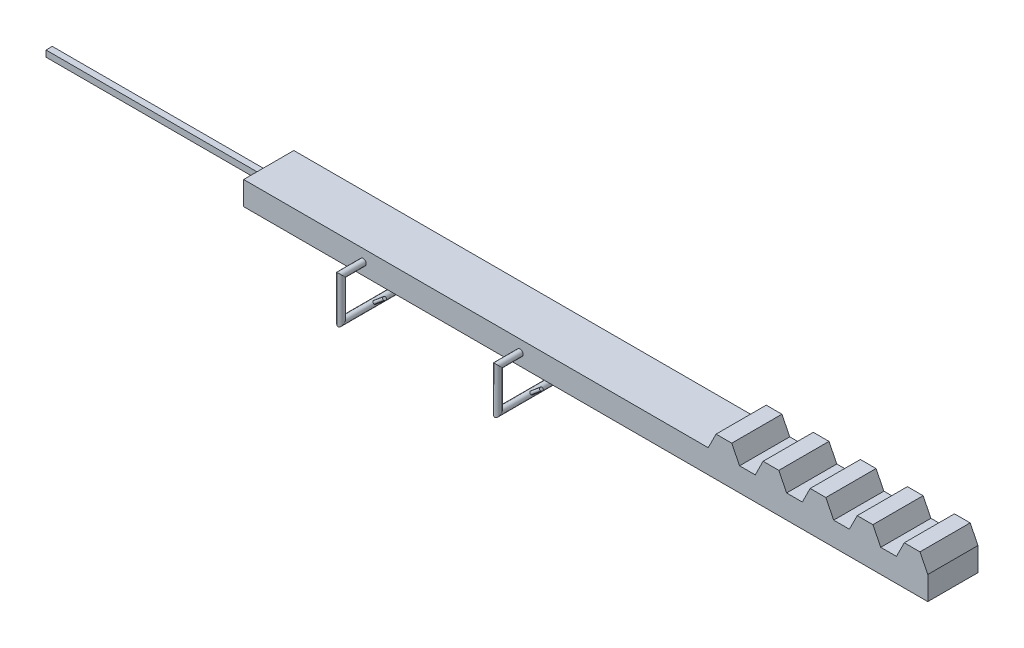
ISO-10303-21;
HEADER;
FILE_DESCRIPTION(('STEP AP214'),'2;1');
FILE_NAME('part.step','',(''),(''),'','','');
FILE_SCHEMA(('AUTOMOTIVE_DESIGN { 1 0 10303 214 1 1 1 1 }'));
ENDSEC;
DATA;
#1=APPLICATION_CONTEXT('core data for automotive mechanical design processes');
#2=APPLICATION_PROTOCOL_DEFINITION('international standard','automotive_design',2000,#1);
#3=PRODUCT_CONTEXT('',#1,'mechanical');
#4=PRODUCT('Part','Part','',(#3));
#5=PRODUCT_RELATED_PRODUCT_CATEGORY('part','',(#4));
#6=PRODUCT_DEFINITION_FORMATION('','',#4);
#7=PRODUCT_DEFINITION_CONTEXT('part definition',#1,'design');
#8=PRODUCT_DEFINITION('design','',#6,#7);
#9=PRODUCT_DEFINITION_SHAPE('','',#8);
#10=(LENGTH_UNIT() NAMED_UNIT(*) SI_UNIT(.MILLI.,.METRE.));
#11=(NAMED_UNIT(*) PLANE_ANGLE_UNIT() SI_UNIT($,.RADIAN.));
#12=(NAMED_UNIT(*) SI_UNIT($,.STERADIAN.) SOLID_ANGLE_UNIT());
#13=UNCERTAINTY_MEASURE_WITH_UNIT(LENGTH_MEASURE(1.E-05),#10,'distance_accuracy_value','');
#14=(GEOMETRIC_REPRESENTATION_CONTEXT(3) GLOBAL_UNCERTAINTY_ASSIGNED_CONTEXT((#13)) GLOBAL_UNIT_ASSIGNED_CONTEXT((#10,
#11,#12)) REPRESENTATION_CONTEXT('',''));
#15=CARTESIAN_POINT('',(0.,0.,0.));
#16=DIRECTION('',(0.,0.,1.));
#17=DIRECTION('',(1.,0.,0.));
#18=AXIS2_PLACEMENT_3D('',#15,#16,#17);
#19=CARTESIAN_POINT('',(-380.760603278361,-37.5,80.));
#20=DIRECTION('',(0.,0.,1.));
#21=DIRECTION('',(1.,0.,0.));
#22=AXIS2_PLACEMENT_3D('',#19,#20,#21);
#23=PLANE('',#22);
#24=CARTESIAN_POINT('',(0.,0.,80.));
#25=DIRECTION('',(0.,0.,1.));
#26=DIRECTION('',(1.,0.,0.));
#27=AXIS2_PLACEMENT_3D('',#24,#25,#26);
#28=CIRCLE('',#27,10.);
#29=CARTESIAN_POINT('',(10.,0.,80.));
#30=VERTEX_POINT('',#29);
#31=EDGE_CURVE('E428',#30,#30,#28,.F.);
#32=ORIENTED_EDGE('',*,*,#31,.T.);
#33=EDGE_LOOP('',(#32));
#34=FACE_BOUND('',#33,.T.);
#35=DIRECTION('',(0.,-1.,0.));
#36=VECTOR('',#35,1.);
#37=CARTESIAN_POINT('',(-380.760603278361,37.5,80.));
#38=LINE('',#37,#36);
#39=CARTESIAN_POINT('',(-380.760603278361,37.5,80.));
#40=VERTEX_POINT('',#39);
#41=CARTESIAN_POINT('',(-380.760603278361,-37.5,80.));
#42=VERTEX_POINT('',#41);
#43=EDGE_CURVE('E244',#40,#42,#38,.T.);
#44=ORIENTED_EDGE('',*,*,#43,.T.);
#45=DIRECTION('',(1.,0.,0.));
#46=VECTOR('',#45,1.);
#47=CARTESIAN_POINT('',(-380.760603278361,-37.5,80.));
#48=LINE('',#47,#46);
#49=CARTESIAN_POINT('',(1800.,-37.5,80.));
#50=VERTEX_POINT('',#49);
#51=EDGE_CURVE('E247',#42,#50,#48,.T.);
#52=ORIENTED_EDGE('',*,*,#51,.T.);
#53=DIRECTION('',(0.,1.,0.));
#54=VECTOR('',#53,1.);
#55=CARTESIAN_POINT('',(1800.,37.5,80.));
#56=LINE('',#55,#54);
#57=CARTESIAN_POINT('',(1800.,37.5,80.));
#58=VERTEX_POINT('',#57);
#59=EDGE_CURVE('E254',#50,#58,#56,.T.);
#60=ORIENTED_EDGE('',*,*,#59,.T.);
#61=DIRECTION('',(-0.447213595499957,0.894427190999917,0.));
#62=VECTOR('',#61,1.);
#63=CARTESIAN_POINT('',(1775.,87.5,80.));
#64=LINE('',#63,#62);
#65=CARTESIAN_POINT('',(1775.,87.5,80.));
#66=VERTEX_POINT('',#65);
#67=EDGE_CURVE('E257',#58,#66,#64,.T.);
#68=ORIENTED_EDGE('',*,*,#67,.T.);
#69=DIRECTION('',(-1.,0.,0.));
#70=VECTOR('',#69,1.);
#71=CARTESIAN_POINT('',(1725.,87.5,80.));
#72=LINE('',#71,#70);
#73=CARTESIAN_POINT('',(1725.,87.5,80.));
#74=VERTEX_POINT('',#73);
#75=EDGE_CURVE('E260',#66,#74,#72,.T.);
#76=ORIENTED_EDGE('',*,*,#75,.T.);
#77=DIRECTION('',(-0.447213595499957,-0.894427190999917,0.));
#78=VECTOR('',#77,1.);
#79=CARTESIAN_POINT('',(1700.,37.5,80.));
#80=LINE('',#79,#78);
#81=CARTESIAN_POINT('',(1700.,37.5,80.));
#82=VERTEX_POINT('',#81);
#83=EDGE_CURVE('E263',#74,#82,#80,.T.);
#84=ORIENTED_EDGE('',*,*,#83,.T.);
#85=DIRECTION('',(-1.,0.,0.));
#86=VECTOR('',#85,1.);
#87=CARTESIAN_POINT('',(1650.,37.5,80.));
#88=LINE('',#87,#86);
#89=CARTESIAN_POINT('',(1650.,37.5,80.));
#90=VERTEX_POINT('',#89);
#91=EDGE_CURVE('E266',#82,#90,#88,.T.);
#92=ORIENTED_EDGE('',*,*,#91,.T.);
#93=DIRECTION('',(-0.447213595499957,0.894427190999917,0.));
#94=VECTOR('',#93,1.);
#95=CARTESIAN_POINT('',(1625.,87.5,80.));
#96=LINE('',#95,#94);
#97=CARTESIAN_POINT('',(1625.,87.5,80.));
#98=VERTEX_POINT('',#97);
#99=EDGE_CURVE('E269',#90,#98,#96,.T.);
#100=ORIENTED_EDGE('',*,*,#99,.T.);
#101=DIRECTION('',(-1.,0.,0.));
#102=VECTOR('',#101,1.);
#103=CARTESIAN_POINT('',(1575.,87.5,80.));
#104=LINE('',#103,#102);
#105=CARTESIAN_POINT('',(1575.,87.5,80.));
#106=VERTEX_POINT('',#105);
#107=EDGE_CURVE('E272',#98,#106,#104,.T.);
#108=ORIENTED_EDGE('',*,*,#107,.T.);
#109=DIRECTION('',(-0.447213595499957,-0.894427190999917,0.));
#110=VECTOR('',#109,1.);
#111=CARTESIAN_POINT('',(1550.,37.5,80.));
#112=LINE('',#111,#110);
#113=CARTESIAN_POINT('',(1550.,37.5,80.));
#114=VERTEX_POINT('',#113);
#115=EDGE_CURVE('E275',#106,#114,#112,.T.);
#116=ORIENTED_EDGE('',*,*,#115,.T.);
#117=DIRECTION('',(-1.,0.,0.));
#118=VECTOR('',#117,1.);
#119=CARTESIAN_POINT('',(1500.,37.5,80.));
#120=LINE('',#119,#118);
#121=CARTESIAN_POINT('',(1500.,37.5,80.));
#122=VERTEX_POINT('',#121);
#123=EDGE_CURVE('E278',#114,#122,#120,.T.);
#124=ORIENTED_EDGE('',*,*,#123,.T.);
#125=DIRECTION('',(-0.447213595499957,0.894427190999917,0.));
#126=VECTOR('',#125,1.);
#127=CARTESIAN_POINT('',(1475.,87.5,80.));
#128=LINE('',#127,#126);
#129=CARTESIAN_POINT('',(1475.,87.5,80.));
#130=VERTEX_POINT('',#129);
#131=EDGE_CURVE('E281',#122,#130,#128,.T.);
#132=ORIENTED_EDGE('',*,*,#131,.T.);
#133=DIRECTION('',(-1.,0.,0.));
#134=VECTOR('',#133,1.);
#135=CARTESIAN_POINT('',(1425.,87.5,80.));
#136=LINE('',#135,#134);
#137=CARTESIAN_POINT('',(1425.,87.5,80.));
#138=VERTEX_POINT('',#137);
#139=EDGE_CURVE('E284',#130,#138,#136,.T.);
#140=ORIENTED_EDGE('',*,*,#139,.T.);
#141=DIRECTION('',(-0.447213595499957,-0.894427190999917,0.));
#142=VECTOR('',#141,1.);
#143=CARTESIAN_POINT('',(1425.,87.5,80.));
#144=LINE('',#143,#142);
#145=CARTESIAN_POINT('',(1400.,37.5,80.));
#146=VERTEX_POINT('',#145);
#147=EDGE_CURVE('E287',#138,#146,#144,.T.);
#148=ORIENTED_EDGE('',*,*,#147,.T.);
#149=DIRECTION('',(-1.,0.,0.));
#150=VECTOR('',#149,1.);
#151=CARTESIAN_POINT('',(1350.,37.5,80.));
#152=LINE('',#151,#150);
#153=CARTESIAN_POINT('',(1350.,37.5,80.));
#154=VERTEX_POINT('',#153);
#155=EDGE_CURVE('E290',#146,#154,#152,.T.);
#156=ORIENTED_EDGE('',*,*,#155,.T.);
#157=DIRECTION('',(-0.447213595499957,0.894427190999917,0.));
#158=VECTOR('',#157,1.);
#159=CARTESIAN_POINT('',(1325.,87.5,80.));
#160=LINE('',#159,#158);
#161=CARTESIAN_POINT('',(1325.,87.5,80.));
#162=VERTEX_POINT('',#161);
#163=EDGE_CURVE('E293',#154,#162,#160,.T.);
#164=ORIENTED_EDGE('',*,*,#163,.T.);
#165=DIRECTION('',(-1.,0.,0.));
#166=VECTOR('',#165,1.);
#167=CARTESIAN_POINT('',(1275.,87.5,80.));
#168=LINE('',#167,#166);
#169=CARTESIAN_POINT('',(1275.,87.5,80.));
#170=VERTEX_POINT('',#169);
#171=EDGE_CURVE('E296',#162,#170,#168,.T.);
#172=ORIENTED_EDGE('',*,*,#171,.T.);
#173=DIRECTION('',(-0.447213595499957,-0.894427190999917,0.));
#174=VECTOR('',#173,1.);
#175=CARTESIAN_POINT('',(1275.,87.5,80.));
#176=LINE('',#175,#174);
#177=CARTESIAN_POINT('',(1250.,37.5,80.));
#178=VERTEX_POINT('',#177);
#179=EDGE_CURVE('E299',#170,#178,#176,.T.);
#180=ORIENTED_EDGE('',*,*,#179,.T.);
#181=DIRECTION('',(-1.,0.,0.));
#182=VECTOR('',#181,1.);
#183=CARTESIAN_POINT('',(1200.,37.5,80.));
#184=LINE('',#183,#182);
#185=CARTESIAN_POINT('',(1200.,37.5,80.));
#186=VERTEX_POINT('',#185);
#187=EDGE_CURVE('E302',#178,#186,#184,.T.);
#188=ORIENTED_EDGE('',*,*,#187,.T.);
#189=DIRECTION('',(-0.447213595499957,0.894427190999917,0.));
#190=VECTOR('',#189,1.);
#191=CARTESIAN_POINT('',(1175.,87.5,80.));
#192=LINE('',#191,#190);
#193=CARTESIAN_POINT('',(1175.,87.5,80.));
#194=VERTEX_POINT('',#193);
#195=EDGE_CURVE('E305',#186,#194,#192,.T.);
#196=ORIENTED_EDGE('',*,*,#195,.T.);
#197=DIRECTION('',(-1.,0.,0.));
#198=VECTOR('',#197,1.);
#199=CARTESIAN_POINT('',(1125.,87.5,80.));
#200=LINE('',#199,#198);
#201=CARTESIAN_POINT('',(1125.,87.5,80.));
#202=VERTEX_POINT('',#201);
#203=EDGE_CURVE('E308',#194,#202,#200,.T.);
#204=ORIENTED_EDGE('',*,*,#203,.T.);
#205=DIRECTION('',(-0.447213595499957,-0.894427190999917,0.));
#206=VECTOR('',#205,1.);
#207=CARTESIAN_POINT('',(1100.,37.5,80.));
#208=LINE('',#207,#206);
#209=CARTESIAN_POINT('',(1100.,37.5,80.));
#210=VERTEX_POINT('',#209);
#211=EDGE_CURVE('E311',#202,#210,#208,.T.);
#212=ORIENTED_EDGE('',*,*,#211,.T.);
#213=DIRECTION('',(-1.,0.,0.));
#214=VECTOR('',#213,1.);
#215=CARTESIAN_POINT('',(-380.760603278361,37.5,80.));
#216=LINE('',#215,#214);
#217=EDGE_CURVE('E314',#210,#40,#216,.T.);
#218=ORIENTED_EDGE('',*,*,#217,.T.);
#219=EDGE_LOOP('',(#44,#52,#60,#68,#76,#84,#92,#100,#108,#116,#124,#132,#140,#148,#156,#164,
#172,#180,#188,#196,#204,#212,#218));
#220=FACE_BOUND('',#219,.T.);
#221=CARTESIAN_POINT('',(500.,0.,80.));
#222=DIRECTION('',(0.,0.,1.));
#223=DIRECTION('',(1.,0.,0.));
#224=AXIS2_PLACEMENT_3D('',#221,#222,#223);
#225=CIRCLE('',#224,10.);
#226=CARTESIAN_POINT('',(510.,0.,80.));
#227=VERTEX_POINT('',#226);
#228=EDGE_CURVE('E656',#227,#227,#225,.F.);
#229=ORIENTED_EDGE('',*,*,#228,.T.);
#230=EDGE_LOOP('',(#229));
#231=FACE_BOUND('',#230,.T.);
#232=ADVANCED_FACE('F35',(#34,#220,#231),#23,.T.);
#233=CARTESIAN_POINT('',(-380.760603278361,37.5,-80.));
#234=DIRECTION('',(-1.,0.,0.));
#235=DIRECTION('',(0.,0.,1.));
#236=AXIS2_PLACEMENT_3D('',#233,#234,#235);
#237=PLANE('',#236);
#238=DIRECTION('',(0.,0.,1.));
#239=VECTOR('',#238,1.);
#240=CARTESIAN_POINT('',(-380.760603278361,-37.5,-80.));
#241=LINE('',#240,#239);
#242=CARTESIAN_POINT('',(-380.760603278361,-37.5,-80.));
#243=VERTEX_POINT('',#242);
#244=EDGE_CURVE('E384',#243,#42,#241,.T.);
#245=ORIENTED_EDGE('',*,*,#244,.T.);
#246=ORIENTED_EDGE('',*,*,#43,.F.);
#247=DIRECTION('',(0.,0.,1.));
#248=VECTOR('',#247,1.);
#249=CARTESIAN_POINT('',(-380.760603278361,37.5,-80.));
#250=LINE('',#249,#248);
#251=CARTESIAN_POINT('',(-380.760603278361,37.5,-80.));
#252=VERTEX_POINT('',#251);
#253=EDGE_CURVE('E12',#252,#40,#250,.T.);
#254=ORIENTED_EDGE('',*,*,#253,.F.);
#255=DIRECTION('',(0.,-1.,0.));
#256=VECTOR('',#255,1.);
#257=CARTESIAN_POINT('',(-380.760603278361,37.5,-80.));
#258=LINE('',#257,#256);
#259=EDGE_CURVE('E317',#252,#243,#258,.T.);
#260=ORIENTED_EDGE('',*,*,#259,.T.);
#261=EDGE_LOOP('',(#245,#246,#254,#260));
#262=FACE_BOUND('',#261,.T.);
#263=DIRECTION('',(0.,0.,1.));
#264=VECTOR('',#263,1.);
#265=CARTESIAN_POINT('',(-380.760603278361,-10.,10.));
#266=LINE('',#265,#264);
#267=CARTESIAN_POINT('',(-380.760603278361,-10.,-10.));
#268=VERTEX_POINT('',#267);
#269=CARTESIAN_POINT('',(-380.760603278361,-10.,10.));
#270=VERTEX_POINT('',#269);
#271=EDGE_CURVE('E624',#268,#270,#266,.T.);
#272=ORIENTED_EDGE('',*,*,#271,.F.);
#273=DIRECTION('',(0.,-1.,0.));
#274=VECTOR('',#273,1.);
#275=CARTESIAN_POINT('',(-380.760603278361,-10.,-10.));
#276=LINE('',#275,#274);
#277=CARTESIAN_POINT('',(-380.760603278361,10.,-10.));
#278=VERTEX_POINT('',#277);
#279=EDGE_CURVE('E242',#278,#268,#276,.T.);
#280=ORIENTED_EDGE('',*,*,#279,.F.);
#281=DIRECTION('',(0.,0.,-1.));
#282=VECTOR('',#281,1.);
#283=CARTESIAN_POINT('',(-380.760603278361,10.,10.));
#284=LINE('',#283,#282);
#285=CARTESIAN_POINT('',(-380.760603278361,10.,9.99999999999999));
#286=VERTEX_POINT('',#285);
#287=EDGE_CURVE('E238',#286,#278,#284,.T.);
#288=ORIENTED_EDGE('',*,*,#287,.F.);
#289=DIRECTION('',(0.,1.,0.));
#290=VECTOR('',#289,1.);
#291=CARTESIAN_POINT('',(-380.760603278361,-10.,10.));
#292=LINE('',#291,#290);
#293=EDGE_CURVE('E626',#270,#286,#292,.T.);
#294=ORIENTED_EDGE('',*,*,#293,.F.);
#295=EDGE_LOOP('',(#272,#280,#288,#294));
#296=FACE_BOUND('',#295,.T.);
#297=ADVANCED_FACE('F37',(#262,#296),#237,.T.);
#298=CARTESIAN_POINT('',(-380.760603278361,37.5,-80.));
#299=DIRECTION('',(0.,1.,0.));
#300=DIRECTION('',(0.,0.,1.));
#301=AXIS2_PLACEMENT_3D('',#298,#299,#300);
#302=PLANE('',#301);
#303=ORIENTED_EDGE('',*,*,#253,.T.);
#304=ORIENTED_EDGE('',*,*,#217,.F.);
#305=DIRECTION('',(0.,0.,1.));
#306=VECTOR('',#305,1.);
#307=CARTESIAN_POINT('',(1100.,37.5,-80.));
#308=LINE('',#307,#306);
#309=CARTESIAN_POINT('',(1100.,37.5,-80.));
#310=VERTEX_POINT('',#309);
#311=EDGE_CURVE('E48',#310,#210,#308,.T.);
#312=ORIENTED_EDGE('',*,*,#311,.F.);
#313=DIRECTION('',(-1.,0.,0.));
#314=VECTOR('',#313,1.);
#315=CARTESIAN_POINT('',(-380.760603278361,37.5,-80.));
#316=LINE('',#315,#314);
#317=EDGE_CURVE('E382',#310,#252,#316,.T.);
#318=ORIENTED_EDGE('',*,*,#317,.T.);
#319=EDGE_LOOP('',(#303,#304,#312,#318));
#320=FACE_BOUND('',#319,.T.);
#321=ADVANCED_FACE('F481',(#320),#302,.T.);
#322=CARTESIAN_POINT('',(1100.,37.5,-80.));
#323=DIRECTION('',(-0.894427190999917,0.447213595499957,0.));
#324=DIRECTION('',(-0.447213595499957,-0.894427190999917,0.));
#325=AXIS2_PLACEMENT_3D('',#322,#323,#324);
#326=PLANE('',#325);
#327=ORIENTED_EDGE('',*,*,#311,.T.);
#328=ORIENTED_EDGE('',*,*,#211,.F.);
#329=DIRECTION('',(0.,0.,1.));
#330=VECTOR('',#329,1.);
#331=CARTESIAN_POINT('',(1125.,87.5,-80.));
#332=LINE('',#331,#330);
#333=CARTESIAN_POINT('',(1125.,87.5,-80.));
#334=VERTEX_POINT('',#333);
#335=EDGE_CURVE('E387',#334,#202,#332,.T.);
#336=ORIENTED_EDGE('',*,*,#335,.F.);
#337=DIRECTION('',(-0.447213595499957,-0.894427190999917,0.));
#338=VECTOR('',#337,1.);
#339=CARTESIAN_POINT('',(1100.,37.5,-80.));
#340=LINE('',#339,#338);
#341=EDGE_CURVE('E379',#334,#310,#340,.T.);
#342=ORIENTED_EDGE('',*,*,#341,.T.);
#343=EDGE_LOOP('',(#327,#328,#336,#342));
#344=FACE_BOUND('',#343,.T.);
#345=ADVANCED_FACE('F493',(#344),#326,.T.);
#346=CARTESIAN_POINT('',(1125.,87.5,-80.));
#347=DIRECTION('',(0.,1.,0.));
#348=DIRECTION('',(-1.,0.,0.));
#349=AXIS2_PLACEMENT_3D('',#346,#347,#348);
#350=PLANE('',#349);
#351=ORIENTED_EDGE('',*,*,#335,.T.);
#352=ORIENTED_EDGE('',*,*,#203,.F.);
#353=DIRECTION('',(0.,0.,1.));
#354=VECTOR('',#353,1.);
#355=CARTESIAN_POINT('',(1175.,87.5,-80.));
#356=LINE('',#355,#354);
#357=CARTESIAN_POINT('',(1175.,87.5,-80.));
#358=VERTEX_POINT('',#357);
#359=EDGE_CURVE('E389',#358,#194,#356,.T.);
#360=ORIENTED_EDGE('',*,*,#359,.F.);
#361=DIRECTION('',(-1.,0.,0.));
#362=VECTOR('',#361,1.);
#363=CARTESIAN_POINT('',(1125.,87.5,-80.));
#364=LINE('',#363,#362);
#365=EDGE_CURVE('E376',#358,#334,#364,.T.);
#366=ORIENTED_EDGE('',*,*,#365,.T.);
#367=EDGE_LOOP('',(#351,#352,#360,#366));
#368=FACE_BOUND('',#367,.T.);
#369=ADVANCED_FACE('F497',(#368),#350,.T.);
#370=CARTESIAN_POINT('',(1175.,87.5,-80.));
#371=DIRECTION('',(0.894427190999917,0.447213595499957,0.));
#372=DIRECTION('',(-0.447213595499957,0.894427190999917,0.));
#373=AXIS2_PLACEMENT_3D('',#370,#371,#372);
#374=PLANE('',#373);
#375=ORIENTED_EDGE('',*,*,#359,.T.);
#376=ORIENTED_EDGE('',*,*,#195,.F.);
#377=DIRECTION('',(0.,0.,1.));
#378=VECTOR('',#377,1.);
#379=CARTESIAN_POINT('',(1200.,37.5,-80.));
#380=LINE('',#379,#378);
#381=CARTESIAN_POINT('',(1200.,37.5,-80.));
#382=VERTEX_POINT('',#381);
#383=EDGE_CURVE('E391',#382,#186,#380,.T.);
#384=ORIENTED_EDGE('',*,*,#383,.F.);
#385=DIRECTION('',(-0.447213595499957,0.894427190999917,0.));
#386=VECTOR('',#385,1.);
#387=CARTESIAN_POINT('',(1175.,87.5,-80.));
#388=LINE('',#387,#386);
#389=EDGE_CURVE('E373',#382,#358,#388,.T.);
#390=ORIENTED_EDGE('',*,*,#389,.T.);
#391=EDGE_LOOP('',(#375,#376,#384,#390));
#392=FACE_BOUND('',#391,.T.);
#393=ADVANCED_FACE('F501',(#392),#374,.T.);
#394=CARTESIAN_POINT('',(1200.,37.5,-80.));
#395=DIRECTION('',(0.,1.,0.));
#396=DIRECTION('',(0.,0.,1.));
#397=AXIS2_PLACEMENT_3D('',#394,#395,#396);
#398=PLANE('',#397);
#399=ORIENTED_EDGE('',*,*,#383,.T.);
#400=ORIENTED_EDGE('',*,*,#187,.F.);
#401=DIRECTION('',(0.,0.,1.));
#402=VECTOR('',#401,1.);
#403=CARTESIAN_POINT('',(1250.,37.5,-80.));
#404=LINE('',#403,#402);
#405=CARTESIAN_POINT('',(1250.,37.5,-80.));
#406=VERTEX_POINT('',#405);
#407=EDGE_CURVE('E393',#406,#178,#404,.T.);
#408=ORIENTED_EDGE('',*,*,#407,.F.);
#409=DIRECTION('',(-1.,0.,0.));
#410=VECTOR('',#409,1.);
#411=CARTESIAN_POINT('',(1200.,37.5,-80.));
#412=LINE('',#411,#410);
#413=EDGE_CURVE('E370',#406,#382,#412,.T.);
#414=ORIENTED_EDGE('',*,*,#413,.T.);
#415=EDGE_LOOP('',(#399,#400,#408,#414));
#416=FACE_BOUND('',#415,.T.);
#417=ADVANCED_FACE('F505',(#416),#398,.T.);
#418=CARTESIAN_POINT('',(1275.,87.5,-80.));
#419=DIRECTION('',(-0.894427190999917,0.447213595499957,0.));
#420=DIRECTION('',(-0.447213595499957,-0.894427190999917,0.));
#421=AXIS2_PLACEMENT_3D('',#418,#419,#420);
#422=PLANE('',#421);
#423=ORIENTED_EDGE('',*,*,#407,.T.);
#424=ORIENTED_EDGE('',*,*,#179,.F.);
#425=DIRECTION('',(0.,0.,1.));
#426=VECTOR('',#425,1.);
#427=CARTESIAN_POINT('',(1275.,87.5,-80.));
#428=LINE('',#427,#426);
#429=CARTESIAN_POINT('',(1275.,87.5,-80.));
#430=VERTEX_POINT('',#429);
#431=EDGE_CURVE('E395',#430,#170,#428,.T.);
#432=ORIENTED_EDGE('',*,*,#431,.F.);
#433=DIRECTION('',(-0.447213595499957,-0.894427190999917,0.));
#434=VECTOR('',#433,1.);
#435=CARTESIAN_POINT('',(1275.,87.5,-80.));
#436=LINE('',#435,#434);
#437=EDGE_CURVE('E367',#430,#406,#436,.T.);
#438=ORIENTED_EDGE('',*,*,#437,.T.);
#439=EDGE_LOOP('',(#423,#424,#432,#438));
#440=FACE_BOUND('',#439,.T.);
#441=ADVANCED_FACE('F509',(#440),#422,.T.);
#442=CARTESIAN_POINT('',(1275.,87.5,-80.));
#443=DIRECTION('',(0.,1.,0.));
#444=DIRECTION('',(-1.,0.,0.));
#445=AXIS2_PLACEMENT_3D('',#442,#443,#444);
#446=PLANE('',#445);
#447=ORIENTED_EDGE('',*,*,#431,.T.);
#448=ORIENTED_EDGE('',*,*,#171,.F.);
#449=DIRECTION('',(0.,0.,1.));
#450=VECTOR('',#449,1.);
#451=CARTESIAN_POINT('',(1325.,87.5,-80.));
#452=LINE('',#451,#450);
#453=CARTESIAN_POINT('',(1325.,87.5,-80.));
#454=VERTEX_POINT('',#453);
#455=EDGE_CURVE('E397',#454,#162,#452,.T.);
#456=ORIENTED_EDGE('',*,*,#455,.F.);
#457=DIRECTION('',(-1.,0.,0.));
#458=VECTOR('',#457,1.);
#459=CARTESIAN_POINT('',(1275.,87.5,-80.));
#460=LINE('',#459,#458);
#461=EDGE_CURVE('E364',#454,#430,#460,.T.);
#462=ORIENTED_EDGE('',*,*,#461,.T.);
#463=EDGE_LOOP('',(#447,#448,#456,#462));
#464=FACE_BOUND('',#463,.T.);
#465=ADVANCED_FACE('F513',(#464),#446,.T.);
#466=CARTESIAN_POINT('',(1325.,87.5,-80.));
#467=DIRECTION('',(0.894427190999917,0.447213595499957,0.));
#468=DIRECTION('',(-0.447213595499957,0.894427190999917,0.));
#469=AXIS2_PLACEMENT_3D('',#466,#467,#468);
#470=PLANE('',#469);
#471=ORIENTED_EDGE('',*,*,#455,.T.);
#472=ORIENTED_EDGE('',*,*,#163,.F.);
#473=DIRECTION('',(0.,0.,1.));
#474=VECTOR('',#473,1.);
#475=CARTESIAN_POINT('',(1350.,37.5,-80.));
#476=LINE('',#475,#474);
#477=CARTESIAN_POINT('',(1350.,37.5,-80.));
#478=VERTEX_POINT('',#477);
#479=EDGE_CURVE('E399',#478,#154,#476,.T.);
#480=ORIENTED_EDGE('',*,*,#479,.F.);
#481=DIRECTION('',(-0.447213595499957,0.894427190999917,0.));
#482=VECTOR('',#481,1.);
#483=CARTESIAN_POINT('',(1325.,87.5,-80.));
#484=LINE('',#483,#482);
#485=EDGE_CURVE('E361',#478,#454,#484,.T.);
#486=ORIENTED_EDGE('',*,*,#485,.T.);
#487=EDGE_LOOP('',(#471,#472,#480,#486));
#488=FACE_BOUND('',#487,.T.);
#489=ADVANCED_FACE('F517',(#488),#470,.T.);
#490=CARTESIAN_POINT('',(1350.,37.5,-80.));
#491=DIRECTION('',(0.,1.,0.));
#492=DIRECTION('',(-1.,0.,0.));
#493=AXIS2_PLACEMENT_3D('',#490,#491,#492);
#494=PLANE('',#493);
#495=ORIENTED_EDGE('',*,*,#479,.T.);
#496=ORIENTED_EDGE('',*,*,#155,.F.);
#497=DIRECTION('',(0.,0.,1.));
#498=VECTOR('',#497,1.);
#499=CARTESIAN_POINT('',(1400.,37.5,-80.));
#500=LINE('',#499,#498);
#501=CARTESIAN_POINT('',(1400.,37.5,-80.));
#502=VERTEX_POINT('',#501);
#503=EDGE_CURVE('E401',#502,#146,#500,.T.);
#504=ORIENTED_EDGE('',*,*,#503,.F.);
#505=DIRECTION('',(-1.,0.,0.));
#506=VECTOR('',#505,1.);
#507=CARTESIAN_POINT('',(1350.,37.5,-80.));
#508=LINE('',#507,#506);
#509=EDGE_CURVE('E358',#502,#478,#508,.T.);
#510=ORIENTED_EDGE('',*,*,#509,.T.);
#511=EDGE_LOOP('',(#495,#496,#504,#510));
#512=FACE_BOUND('',#511,.T.);
#513=ADVANCED_FACE('F521',(#512),#494,.T.);
#514=CARTESIAN_POINT('',(1425.,87.5,-80.));
#515=DIRECTION('',(-0.894427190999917,0.447213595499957,0.));
#516=DIRECTION('',(-0.447213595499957,-0.894427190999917,0.));
#517=AXIS2_PLACEMENT_3D('',#514,#515,#516);
#518=PLANE('',#517);
#519=ORIENTED_EDGE('',*,*,#503,.T.);
#520=ORIENTED_EDGE('',*,*,#147,.F.);
#521=DIRECTION('',(0.,0.,1.));
#522=VECTOR('',#521,1.);
#523=CARTESIAN_POINT('',(1425.,87.5,-80.));
#524=LINE('',#523,#522);
#525=CARTESIAN_POINT('',(1425.,87.5,-80.));
#526=VERTEX_POINT('',#525);
#527=EDGE_CURVE('E403',#526,#138,#524,.T.);
#528=ORIENTED_EDGE('',*,*,#527,.F.);
#529=DIRECTION('',(-0.447213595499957,-0.894427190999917,0.));
#530=VECTOR('',#529,1.);
#531=CARTESIAN_POINT('',(1425.,87.5,-80.));
#532=LINE('',#531,#530);
#533=EDGE_CURVE('E355',#526,#502,#532,.T.);
#534=ORIENTED_EDGE('',*,*,#533,.T.);
#535=EDGE_LOOP('',(#519,#520,#528,#534));
#536=FACE_BOUND('',#535,.T.);
#537=ADVANCED_FACE('F525',(#536),#518,.T.);
#538=CARTESIAN_POINT('',(1425.,87.5,-80.));
#539=DIRECTION('',(0.,1.,0.));
#540=DIRECTION('',(0.,0.,1.));
#541=AXIS2_PLACEMENT_3D('',#538,#539,#540);
#542=PLANE('',#541);
#543=ORIENTED_EDGE('',*,*,#527,.T.);
#544=ORIENTED_EDGE('',*,*,#139,.F.);
#545=DIRECTION('',(0.,0.,1.));
#546=VECTOR('',#545,1.);
#547=CARTESIAN_POINT('',(1475.,87.5,-80.));
#548=LINE('',#547,#546);
#549=CARTESIAN_POINT('',(1475.,87.5,-80.));
#550=VERTEX_POINT('',#549);
#551=EDGE_CURVE('E405',#550,#130,#548,.T.);
#552=ORIENTED_EDGE('',*,*,#551,.F.);
#553=DIRECTION('',(-1.,0.,0.));
#554=VECTOR('',#553,1.);
#555=CARTESIAN_POINT('',(1425.,87.5,-80.));
#556=LINE('',#555,#554);
#557=EDGE_CURVE('E352',#550,#526,#556,.T.);
#558=ORIENTED_EDGE('',*,*,#557,.T.);
#559=EDGE_LOOP('',(#543,#544,#552,#558));
#560=FACE_BOUND('',#559,.T.);
#561=ADVANCED_FACE('F529',(#560),#542,.T.);
#562=CARTESIAN_POINT('',(1475.,87.5,-80.));
#563=DIRECTION('',(0.894427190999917,0.447213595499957,0.));
#564=DIRECTION('',(-0.447213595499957,0.894427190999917,0.));
#565=AXIS2_PLACEMENT_3D('',#562,#563,#564);
#566=PLANE('',#565);
#567=ORIENTED_EDGE('',*,*,#551,.T.);
#568=ORIENTED_EDGE('',*,*,#131,.F.);
#569=DIRECTION('',(0.,0.,1.));
#570=VECTOR('',#569,1.);
#571=CARTESIAN_POINT('',(1500.,37.5,-80.));
#572=LINE('',#571,#570);
#573=CARTESIAN_POINT('',(1500.,37.5,-80.));
#574=VERTEX_POINT('',#573);
#575=EDGE_CURVE('E407',#574,#122,#572,.T.);
#576=ORIENTED_EDGE('',*,*,#575,.F.);
#577=DIRECTION('',(-0.447213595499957,0.894427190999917,0.));
#578=VECTOR('',#577,1.);
#579=CARTESIAN_POINT('',(1475.,87.5,-80.));
#580=LINE('',#579,#578);
#581=EDGE_CURVE('E349',#574,#550,#580,.T.);
#582=ORIENTED_EDGE('',*,*,#581,.T.);
#583=EDGE_LOOP('',(#567,#568,#576,#582));
#584=FACE_BOUND('',#583,.T.);
#585=ADVANCED_FACE('F533',(#584),#566,.T.);
#586=CARTESIAN_POINT('',(1500.,37.5,-80.));
#587=DIRECTION('',(0.,1.,0.));
#588=DIRECTION('',(0.,0.,1.));
#589=AXIS2_PLACEMENT_3D('',#586,#587,#588);
#590=PLANE('',#589);
#591=ORIENTED_EDGE('',*,*,#575,.T.);
#592=ORIENTED_EDGE('',*,*,#123,.F.);
#593=DIRECTION('',(0.,0.,1.));
#594=VECTOR('',#593,1.);
#595=CARTESIAN_POINT('',(1550.,37.5,-80.));
#596=LINE('',#595,#594);
#597=CARTESIAN_POINT('',(1550.,37.5,-80.));
#598=VERTEX_POINT('',#597);
#599=EDGE_CURVE('E409',#598,#114,#596,.T.);
#600=ORIENTED_EDGE('',*,*,#599,.F.);
#601=DIRECTION('',(-1.,0.,0.));
#602=VECTOR('',#601,1.);
#603=CARTESIAN_POINT('',(1500.,37.5,-80.));
#604=LINE('',#603,#602);
#605=EDGE_CURVE('E346',#598,#574,#604,.T.);
#606=ORIENTED_EDGE('',*,*,#605,.T.);
#607=EDGE_LOOP('',(#591,#592,#600,#606));
#608=FACE_BOUND('',#607,.T.);
#609=ADVANCED_FACE('F537',(#608),#590,.T.);
#610=CARTESIAN_POINT('',(1550.,37.5,-80.));
#611=DIRECTION('',(-0.894427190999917,0.447213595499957,0.));
#612=DIRECTION('',(-0.447213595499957,-0.894427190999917,0.));
#613=AXIS2_PLACEMENT_3D('',#610,#611,#612);
#614=PLANE('',#613);
#615=ORIENTED_EDGE('',*,*,#599,.T.);
#616=ORIENTED_EDGE('',*,*,#115,.F.);
#617=DIRECTION('',(0.,0.,1.));
#618=VECTOR('',#617,1.);
#619=CARTESIAN_POINT('',(1575.,87.5,-80.));
#620=LINE('',#619,#618);
#621=CARTESIAN_POINT('',(1575.,87.5,-80.));
#622=VERTEX_POINT('',#621);
#623=EDGE_CURVE('E411',#622,#106,#620,.T.);
#624=ORIENTED_EDGE('',*,*,#623,.F.);
#625=DIRECTION('',(-0.447213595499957,-0.894427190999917,0.));
#626=VECTOR('',#625,1.);
#627=CARTESIAN_POINT('',(1550.,37.5,-80.));
#628=LINE('',#627,#626);
#629=EDGE_CURVE('E343',#622,#598,#628,.T.);
#630=ORIENTED_EDGE('',*,*,#629,.T.);
#631=EDGE_LOOP('',(#615,#616,#624,#630));
#632=FACE_BOUND('',#631,.T.);
#633=ADVANCED_FACE('F541',(#632),#614,.T.);
#634=CARTESIAN_POINT('',(1575.,87.5,-80.));
#635=DIRECTION('',(0.,1.,0.));
#636=DIRECTION('',(-1.,0.,0.));
#637=AXIS2_PLACEMENT_3D('',#634,#635,#636);
#638=PLANE('',#637);
#639=ORIENTED_EDGE('',*,*,#623,.T.);
#640=ORIENTED_EDGE('',*,*,#107,.F.);
#641=DIRECTION('',(0.,0.,1.));
#642=VECTOR('',#641,1.);
#643=CARTESIAN_POINT('',(1625.,87.5,-80.));
#644=LINE('',#643,#642);
#645=CARTESIAN_POINT('',(1625.,87.5,-80.));
#646=VERTEX_POINT('',#645);
#647=EDGE_CURVE('E413',#646,#98,#644,.T.);
#648=ORIENTED_EDGE('',*,*,#647,.F.);
#649=DIRECTION('',(-1.,0.,0.));
#650=VECTOR('',#649,1.);
#651=CARTESIAN_POINT('',(1575.,87.5,-80.));
#652=LINE('',#651,#650);
#653=EDGE_CURVE('E340',#646,#622,#652,.T.);
#654=ORIENTED_EDGE('',*,*,#653,.T.);
#655=EDGE_LOOP('',(#639,#640,#648,#654));
#656=FACE_BOUND('',#655,.T.);
#657=ADVANCED_FACE('F545',(#656),#638,.T.);
#658=CARTESIAN_POINT('',(1625.,87.5,-80.));
#659=DIRECTION('',(0.894427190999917,0.447213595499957,0.));
#660=DIRECTION('',(-0.447213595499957,0.894427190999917,0.));
#661=AXIS2_PLACEMENT_3D('',#658,#659,#660);
#662=PLANE('',#661);
#663=ORIENTED_EDGE('',*,*,#647,.T.);
#664=ORIENTED_EDGE('',*,*,#99,.F.);
#665=DIRECTION('',(0.,0.,1.));
#666=VECTOR('',#665,1.);
#667=CARTESIAN_POINT('',(1650.,37.5,-80.));
#668=LINE('',#667,#666);
#669=CARTESIAN_POINT('',(1650.,37.5,-80.));
#670=VERTEX_POINT('',#669);
#671=EDGE_CURVE('E415',#670,#90,#668,.T.);
#672=ORIENTED_EDGE('',*,*,#671,.F.);
#673=DIRECTION('',(-0.447213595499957,0.894427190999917,0.));
#674=VECTOR('',#673,1.);
#675=CARTESIAN_POINT('',(1625.,87.5,-80.));
#676=LINE('',#675,#674);
#677=EDGE_CURVE('E337',#670,#646,#676,.T.);
#678=ORIENTED_EDGE('',*,*,#677,.T.);
#679=EDGE_LOOP('',(#663,#664,#672,#678));
#680=FACE_BOUND('',#679,.T.);
#681=ADVANCED_FACE('F549',(#680),#662,.T.);
#682=CARTESIAN_POINT('',(1650.,37.5,-80.));
#683=DIRECTION('',(0.,1.,0.));
#684=DIRECTION('',(0.,0.,1.));
#685=AXIS2_PLACEMENT_3D('',#682,#683,#684);
#686=PLANE('',#685);
#687=ORIENTED_EDGE('',*,*,#671,.T.);
#688=ORIENTED_EDGE('',*,*,#91,.F.);
#689=DIRECTION('',(0.,0.,1.));
#690=VECTOR('',#689,1.);
#691=CARTESIAN_POINT('',(1700.,37.5,-80.));
#692=LINE('',#691,#690);
#693=CARTESIAN_POINT('',(1700.,37.5,-80.));
#694=VERTEX_POINT('',#693);
#695=EDGE_CURVE('E417',#694,#82,#692,.T.);
#696=ORIENTED_EDGE('',*,*,#695,.F.);
#697=DIRECTION('',(-1.,0.,0.));
#698=VECTOR('',#697,1.);
#699=CARTESIAN_POINT('',(1650.,37.5,-80.));
#700=LINE('',#699,#698);
#701=EDGE_CURVE('E334',#694,#670,#700,.T.);
#702=ORIENTED_EDGE('',*,*,#701,.T.);
#703=EDGE_LOOP('',(#687,#688,#696,#702));
#704=FACE_BOUND('',#703,.T.);
#705=ADVANCED_FACE('F553',(#704),#686,.T.);
#706=CARTESIAN_POINT('',(1700.,37.5,-80.));
#707=DIRECTION('',(-0.894427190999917,0.447213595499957,0.));
#708=DIRECTION('',(-0.447213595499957,-0.894427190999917,0.));
#709=AXIS2_PLACEMENT_3D('',#706,#707,#708);
#710=PLANE('',#709);
#711=ORIENTED_EDGE('',*,*,#695,.T.);
#712=ORIENTED_EDGE('',*,*,#83,.F.);
#713=DIRECTION('',(0.,0.,1.));
#714=VECTOR('',#713,1.);
#715=CARTESIAN_POINT('',(1725.,87.5,-80.));
#716=LINE('',#715,#714);
#717=CARTESIAN_POINT('',(1725.,87.5,-80.));
#718=VERTEX_POINT('',#717);
#719=EDGE_CURVE('E419',#718,#74,#716,.T.);
#720=ORIENTED_EDGE('',*,*,#719,.F.);
#721=DIRECTION('',(-0.447213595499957,-0.894427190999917,0.));
#722=VECTOR('',#721,1.);
#723=CARTESIAN_POINT('',(1700.,37.5,-80.));
#724=LINE('',#723,#722);
#725=EDGE_CURVE('E331',#718,#694,#724,.T.);
#726=ORIENTED_EDGE('',*,*,#725,.T.);
#727=EDGE_LOOP('',(#711,#712,#720,#726));
#728=FACE_BOUND('',#727,.T.);
#729=ADVANCED_FACE('F557',(#728),#710,.T.);
#730=CARTESIAN_POINT('',(1725.,87.5,-80.));
#731=DIRECTION('',(0.,1.,0.));
#732=DIRECTION('',(0.,0.,1.));
#733=AXIS2_PLACEMENT_3D('',#730,#731,#732);
#734=PLANE('',#733);
#735=ORIENTED_EDGE('',*,*,#719,.T.);
#736=ORIENTED_EDGE('',*,*,#75,.F.);
#737=DIRECTION('',(0.,0.,1.));
#738=VECTOR('',#737,1.);
#739=CARTESIAN_POINT('',(1775.,87.5,-80.));
#740=LINE('',#739,#738);
#741=CARTESIAN_POINT('',(1775.,87.5,-80.));
#742=VERTEX_POINT('',#741);
#743=EDGE_CURVE('E421',#742,#66,#740,.T.);
#744=ORIENTED_EDGE('',*,*,#743,.F.);
#745=DIRECTION('',(-1.,0.,0.));
#746=VECTOR('',#745,1.);
#747=CARTESIAN_POINT('',(1725.,87.5,-80.));
#748=LINE('',#747,#746);
#749=EDGE_CURVE('E328',#742,#718,#748,.T.);
#750=ORIENTED_EDGE('',*,*,#749,.T.);
#751=EDGE_LOOP('',(#735,#736,#744,#750));
#752=FACE_BOUND('',#751,.T.);
#753=ADVANCED_FACE('F561',(#752),#734,.T.);
#754=CARTESIAN_POINT('',(1775.,87.5,-80.));
#755=DIRECTION('',(0.894427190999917,0.447213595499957,0.));
#756=DIRECTION('',(-0.447213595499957,0.894427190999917,0.));
#757=AXIS2_PLACEMENT_3D('',#754,#755,#756);
#758=PLANE('',#757);
#759=ORIENTED_EDGE('',*,*,#743,.T.);
#760=ORIENTED_EDGE('',*,*,#67,.F.);
#761=DIRECTION('',(0.,0.,1.));
#762=VECTOR('',#761,1.);
#763=CARTESIAN_POINT('',(1800.,37.5,-80.));
#764=LINE('',#763,#762);
#765=CARTESIAN_POINT('',(1800.,37.5,-80.));
#766=VERTEX_POINT('',#765);
#767=EDGE_CURVE('E423',#766,#58,#764,.T.);
#768=ORIENTED_EDGE('',*,*,#767,.F.);
#769=DIRECTION('',(-0.447213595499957,0.894427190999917,0.));
#770=VECTOR('',#769,1.);
#771=CARTESIAN_POINT('',(1775.,87.5,-80.));
#772=LINE('',#771,#770);
#773=EDGE_CURVE('E325',#766,#742,#772,.T.);
#774=ORIENTED_EDGE('',*,*,#773,.T.);
#775=EDGE_LOOP('',(#759,#760,#768,#774));
#776=FACE_BOUND('',#775,.T.);
#777=ADVANCED_FACE('F565',(#776),#758,.T.);
#778=CARTESIAN_POINT('',(1800.,37.5,-80.));
#779=DIRECTION('',(1.,0.,0.));
#780=DIRECTION('',(0.,0.,-1.));
#781=AXIS2_PLACEMENT_3D('',#778,#779,#780);
#782=PLANE('',#781);
#783=ORIENTED_EDGE('',*,*,#767,.T.);
#784=ORIENTED_EDGE('',*,*,#59,.F.);
#785=DIRECTION('',(0.,0.,1.));
#786=VECTOR('',#785,1.);
#787=CARTESIAN_POINT('',(1800.,-37.5,-80.));
#788=LINE('',#787,#786);
#789=CARTESIAN_POINT('',(1800.,-37.5,-80.));
#790=VERTEX_POINT('',#789);
#791=EDGE_CURVE('E425',#790,#50,#788,.T.);
#792=ORIENTED_EDGE('',*,*,#791,.F.);
#793=DIRECTION('',(0.,1.,0.));
#794=VECTOR('',#793,1.);
#795=CARTESIAN_POINT('',(1800.,37.5,-80.));
#796=LINE('',#795,#794);
#797=EDGE_CURVE('E322',#790,#766,#796,.T.);
#798=ORIENTED_EDGE('',*,*,#797,.T.);
#799=EDGE_LOOP('',(#783,#784,#792,#798));
#800=FACE_BOUND('',#799,.T.);
#801=ADVANCED_FACE('F569',(#800),#782,.T.);
#802=CARTESIAN_POINT('',(-380.760603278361,-37.5,-80.));
#803=DIRECTION('',(0.,-1.,0.));
#804=DIRECTION('',(1.,0.,0.));
#805=AXIS2_PLACEMENT_3D('',#802,#803,#804);
#806=PLANE('',#805);
#807=ORIENTED_EDGE('',*,*,#791,.T.);
#808=ORIENTED_EDGE('',*,*,#51,.F.);
#809=ORIENTED_EDGE('',*,*,#244,.F.);
#810=DIRECTION('',(1.,0.,0.));
#811=VECTOR('',#810,1.);
#812=CARTESIAN_POINT('',(-380.760603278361,-37.5,-80.));
#813=LINE('',#812,#811);
#814=EDGE_CURVE('E319',#243,#790,#813,.T.);
#815=ORIENTED_EDGE('',*,*,#814,.T.);
#816=EDGE_LOOP('',(#807,#808,#809,#815));
#817=FACE_BOUND('',#816,.T.);
#818=ADVANCED_FACE('F489',(#817),#806,.T.);
#819=CARTESIAN_POINT('',(-380.760603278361,-37.5,-80.));
#820=DIRECTION('',(0.,0.,1.));
#821=DIRECTION('',(1.,0.,0.));
#822=AXIS2_PLACEMENT_3D('',#819,#820,#821);
#823=PLANE('',#822);
#824=ORIENTED_EDGE('',*,*,#259,.F.);
#825=ORIENTED_EDGE('',*,*,#317,.F.);
#826=ORIENTED_EDGE('',*,*,#341,.F.);
#827=ORIENTED_EDGE('',*,*,#365,.F.);
#828=ORIENTED_EDGE('',*,*,#389,.F.);
#829=ORIENTED_EDGE('',*,*,#413,.F.);
#830=ORIENTED_EDGE('',*,*,#437,.F.);
#831=ORIENTED_EDGE('',*,*,#461,.F.);
#832=ORIENTED_EDGE('',*,*,#485,.F.);
#833=ORIENTED_EDGE('',*,*,#509,.F.);
#834=ORIENTED_EDGE('',*,*,#533,.F.);
#835=ORIENTED_EDGE('',*,*,#557,.F.);
#836=ORIENTED_EDGE('',*,*,#581,.F.);
#837=ORIENTED_EDGE('',*,*,#605,.F.);
#838=ORIENTED_EDGE('',*,*,#629,.F.);
#839=ORIENTED_EDGE('',*,*,#653,.F.);
#840=ORIENTED_EDGE('',*,*,#677,.F.);
#841=ORIENTED_EDGE('',*,*,#701,.F.);
#842=ORIENTED_EDGE('',*,*,#725,.F.);
#843=ORIENTED_EDGE('',*,*,#749,.F.);
#844=ORIENTED_EDGE('',*,*,#773,.F.);
#845=ORIENTED_EDGE('',*,*,#797,.F.);
#846=ORIENTED_EDGE('',*,*,#814,.F.);
#847=EDGE_LOOP('',(#824,#825,#826,#827,#828,#829,#830,#831,#832,#833,#834,#835,#836,#837,#838,
#839,#840,#841,#842,#843,#844,#845,#846));
#848=FACE_BOUND('',#847,.T.);
#849=ADVANCED_FACE('F486',(#848),#823,.F.);
#850=CARTESIAN_POINT('',(-1080.76060327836,-10.,-10.));
#851=DIRECTION('',(0.,0.,1.));
#852=DIRECTION('',(0.,-1.,0.));
#853=AXIS2_PLACEMENT_3D('',#850,#851,#852);
#854=PLANE('',#853);
#855=ORIENTED_EDGE('',*,*,#279,.T.);
#856=DIRECTION('',(1.,0.,0.));
#857=VECTOR('',#856,1.);
#858=CARTESIAN_POINT('',(-1080.76060327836,-10.,-10.));
#859=LINE('',#858,#857);
#860=CARTESIAN_POINT('',(-1080.76060327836,-10.,-10.));
#861=VERTEX_POINT('',#860);
#862=EDGE_CURVE('E223',#861,#268,#859,.T.);
#863=ORIENTED_EDGE('',*,*,#862,.F.);
#864=DIRECTION('',(0.,-1.,0.));
#865=VECTOR('',#864,1.);
#866=CARTESIAN_POINT('',(-1080.76060327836,-10.,-10.));
#867=LINE('',#866,#865);
#868=CARTESIAN_POINT('',(-1080.76060327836,10.,-10.));
#869=VERTEX_POINT('',#868);
#870=EDGE_CURVE('E230',#869,#861,#867,.T.);
#871=ORIENTED_EDGE('',*,*,#870,.F.);
#872=DIRECTION('',(1.,0.,0.));
#873=VECTOR('',#872,1.);
#874=CARTESIAN_POINT('',(-1080.76060327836,10.,-10.));
#875=LINE('',#874,#873);
#876=EDGE_CURVE('E633',#869,#278,#875,.T.);
#877=ORIENTED_EDGE('',*,*,#876,.T.);
#878=EDGE_LOOP('',(#855,#863,#871,#877));
#879=FACE_BOUND('',#878,.T.);
#880=ADVANCED_FACE('F240',(#879),#854,.F.);
#881=CARTESIAN_POINT('',(-1080.76060327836,-10.,10.));
#882=DIRECTION('',(0.,1.,0.));
#883=DIRECTION('',(0.,0.,1.));
#884=AXIS2_PLACEMENT_3D('',#881,#882,#883);
#885=PLANE('',#884);
#886=ORIENTED_EDGE('',*,*,#271,.T.);
#887=DIRECTION('',(1.,0.,0.));
#888=VECTOR('',#887,1.);
#889=CARTESIAN_POINT('',(-1080.76060327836,-10.,10.));
#890=LINE('',#889,#888);
#891=CARTESIAN_POINT('',(-1080.76060327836,-10.,10.));
#892=VERTEX_POINT('',#891);
#893=EDGE_CURVE('E226',#892,#270,#890,.T.);
#894=ORIENTED_EDGE('',*,*,#893,.F.);
#895=DIRECTION('',(0.,0.,1.));
#896=VECTOR('',#895,1.);
#897=CARTESIAN_POINT('',(-1080.76060327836,-10.,10.));
#898=LINE('',#897,#896);
#899=EDGE_CURVE('E219',#861,#892,#898,.T.);
#900=ORIENTED_EDGE('',*,*,#899,.F.);
#901=ORIENTED_EDGE('',*,*,#862,.T.);
#902=EDGE_LOOP('',(#886,#894,#900,#901));
#903=FACE_BOUND('',#902,.T.);
#904=ADVANCED_FACE('F221',(#903),#885,.F.);
#905=CARTESIAN_POINT('',(-1080.76060327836,-10.,10.));
#906=DIRECTION('',(0.,0.,-1.));
#907=DIRECTION('',(-1.,0.,0.));
#908=AXIS2_PLACEMENT_3D('',#905,#906,#907);
#909=PLANE('',#908);
#910=ORIENTED_EDGE('',*,*,#293,.T.);
#911=DIRECTION('',(1.,0.,0.));
#912=VECTOR('',#911,1.);
#913=CARTESIAN_POINT('',(-1080.76060327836,10.,10.));
#914=LINE('',#913,#912);
#915=CARTESIAN_POINT('',(-1080.76060327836,10.,10.));
#916=VERTEX_POINT('',#915);
#917=EDGE_CURVE('E56',#916,#286,#914,.T.);
#918=ORIENTED_EDGE('',*,*,#917,.F.);
#919=DIRECTION('',(0.,1.,0.));
#920=VECTOR('',#919,1.);
#921=CARTESIAN_POINT('',(-1080.76060327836,-10.,10.));
#922=LINE('',#921,#920);
#923=EDGE_CURVE('E229',#892,#916,#922,.T.);
#924=ORIENTED_EDGE('',*,*,#923,.F.);
#925=ORIENTED_EDGE('',*,*,#893,.T.);
#926=EDGE_LOOP('',(#910,#918,#924,#925));
#927=FACE_BOUND('',#926,.T.);
#928=ADVANCED_FACE('F939',(#927),#909,.F.);
#929=CARTESIAN_POINT('',(-1080.76060327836,10.,10.));
#930=DIRECTION('',(0.,-1.,0.));
#931=DIRECTION('',(0.,0.,-1.));
#932=AXIS2_PLACEMENT_3D('',#929,#930,#931);
#933=PLANE('',#932);
#934=ORIENTED_EDGE('',*,*,#287,.T.);
#935=ORIENTED_EDGE('',*,*,#876,.F.);
#936=DIRECTION('',(0.,0.,-1.));
#937=VECTOR('',#936,1.);
#938=CARTESIAN_POINT('',(-1080.76060327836,10.,10.));
#939=LINE('',#938,#937);
#940=EDGE_CURVE('E234',#916,#869,#939,.T.);
#941=ORIENTED_EDGE('',*,*,#940,.F.);
#942=ORIENTED_EDGE('',*,*,#917,.T.);
#943=EDGE_LOOP('',(#934,#935,#941,#942));
#944=FACE_BOUND('',#943,.T.);
#945=ADVANCED_FACE('F932',(#944),#933,.F.);
#946=CARTESIAN_POINT('',(-1080.76060327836,10.,-10.));
#947=DIRECTION('',(-1.,0.,0.));
#948=DIRECTION('',(0.,0.,1.));
#949=AXIS2_PLACEMENT_3D('',#946,#947,#948);
#950=PLANE('',#949);
#951=ORIENTED_EDGE('',*,*,#870,.T.);
#952=ORIENTED_EDGE('',*,*,#899,.T.);
#953=ORIENTED_EDGE('',*,*,#923,.T.);
#954=ORIENTED_EDGE('',*,*,#940,.T.);
#955=EDGE_LOOP('',(#951,#952,#953,#954));
#956=FACE_BOUND('',#955,.T.);
#957=ADVANCED_FACE('F233',(#956),#950,.T.);
#958=CARTESIAN_POINT('',(0.,-128.694367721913,150.));
#959=DIRECTION('',(0.,0.,-1.));
#960=DIRECTION('',(-1.,0.,0.));
#961=AXIS2_PLACEMENT_3D('',#958,#959,#960);
#962=CYLINDRICAL_SURFACE('',#961,10.);
#963=CARTESIAN_POINT('',(-9.8480775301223,-130.430849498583,-49.9999999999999));
#964=CARTESIAN_POINT('',(-9.84807773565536,-130.430850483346,-49.8696683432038));
#965=CARTESIAN_POINT('',(-9.84705904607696,-130.436656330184,-49.739325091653));
#966=CARTESIAN_POINT('',(-9.84294348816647,-130.459756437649,-49.479644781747));
#967=CARTESIAN_POINT('',(-9.83984565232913,-130.47705604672,-49.3503082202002));
#968=CARTESIAN_POINT('',(-9.8314450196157,-130.52281817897,-49.0934864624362));
#969=CARTESIAN_POINT('',(-9.82613876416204,-130.551298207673,-48.9660044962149));
#970=CARTESIAN_POINT('',(-9.8131322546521,-130.618843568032,-48.7139825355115));
#971=CARTESIAN_POINT('',(-9.8054309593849,-130.657913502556,-48.5894438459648));
#972=CARTESIAN_POINT('',(-9.77847433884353,-130.789477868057,-48.2228887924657));
#973=CARTESIAN_POINT('',(-9.75531823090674,-130.896637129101,-47.9862676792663));
#974=CARTESIAN_POINT('',(-9.69622905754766,-131.143690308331,-47.5328380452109));
#975=CARTESIAN_POINT('',(-9.66029530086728,-131.283585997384,-47.3160305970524));
#976=CARTESIAN_POINT('',(-9.56936443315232,-131.6024540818,-46.8884893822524));
#977=CARTESIAN_POINT('',(-9.5130394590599,-131.783697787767,-46.6797314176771));
#978=CARTESIAN_POINT('',(-9.37884306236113,-132.169851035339,-46.2929309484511));
#979=CARTESIAN_POINT('',(-9.30096094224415,-132.374772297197,-46.1149037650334));
#980=CARTESIAN_POINT('',(-9.16295176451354,-132.701315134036,-45.868773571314));
#981=CARTESIAN_POINT('',(-9.11144507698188,-132.817290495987,-45.7880868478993));
#982=CARTESIAN_POINT('',(-9.00122449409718,-133.052671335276,-45.6373713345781));
#983=CARTESIAN_POINT('',(-8.94251348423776,-133.17207542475,-45.567338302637));
#984=CARTESIAN_POINT('',(-8.81771748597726,-133.413083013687,-45.4386237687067));
#985=CARTESIAN_POINT('',(-8.75163440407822,-133.534685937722,-45.37993934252));
#986=CARTESIAN_POINT('',(-8.61207429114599,-133.77884775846,-45.2745689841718));
#987=CARTESIAN_POINT('',(-8.53859804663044,-133.901406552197,-45.2278817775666));
#988=CARTESIAN_POINT('',(-8.38993158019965,-134.137445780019,-45.1499844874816));
#989=CARTESIAN_POINT('',(-8.31523480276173,-134.250952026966,-45.1179098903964));
#990=CARTESIAN_POINT('',(-8.15996438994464,-134.476558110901,-45.0650335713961));
#991=CARTESIAN_POINT('',(-8.0793913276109,-134.588658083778,-45.0442307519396));
#992=CARTESIAN_POINT('',(-7.91290976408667,-134.810335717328,-45.0141800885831));
#993=CARTESIAN_POINT('',(-7.82700385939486,-134.919914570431,-45.0049266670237));
#994=CARTESIAN_POINT('',(-7.65049294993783,-135.135592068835,-44.9980856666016));
#995=CARTESIAN_POINT('',(-7.5598882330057,-135.241690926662,-45.0004973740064));
#996=CARTESIAN_POINT('',(-7.38287570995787,-135.440424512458,-45.0162306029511));
#997=CARTESIAN_POINT('',(-7.29679157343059,-135.53342625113,-45.0285817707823));
#998=CARTESIAN_POINT('',(-7.12205258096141,-135.715212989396,-45.0628325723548));
#999=CARTESIAN_POINT('',(-7.03339692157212,-135.80399664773,-45.0847352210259));
#1000=CARTESIAN_POINT('',(-6.85431155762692,-135.976804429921,-45.1378462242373));
#1001=CARTESIAN_POINT('',(-6.76388245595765,-136.060830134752,-45.169051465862));
#1002=CARTESIAN_POINT('',(-6.58198316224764,-136.223806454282,-45.2404476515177));
#1003=CARTESIAN_POINT('',(-6.4905125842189,-136.30275511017,-45.2806420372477));
#1004=CARTESIAN_POINT('',(-6.21325193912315,-136.533605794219,-45.4153745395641));
#1005=CARTESIAN_POINT('',(-6.02694144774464,-136.677286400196,-45.5233689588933));
#1006=CARTESIAN_POINT('',(-5.65965505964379,-136.941774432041,-45.7713296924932));
#1007=CARTESIAN_POINT('',(-5.47868109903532,-137.062573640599,-45.9113074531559));
#1008=CARTESIAN_POINT('',(-5.11141695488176,-137.292310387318,-46.2344634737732));
#1009=CARTESIAN_POINT('',(-4.92624132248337,-137.399047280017,-46.4204746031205));
#1010=CARTESIAN_POINT('',(-4.5770624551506,-137.587620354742,-46.8229891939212));
#1011=CARTESIAN_POINT('',(-4.4130755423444,-137.669437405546,-47.0395158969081));
#1012=CARTESIAN_POINT('',(-4.18464840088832,-137.777122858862,-47.3911935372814));
#1013=CARTESIAN_POINT('',(-4.10951643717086,-137.811263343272,-47.5170509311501));
#1014=CARTESIAN_POINT('',(-3.96895033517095,-137.873328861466,-47.7755138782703));
#1015=CARTESIAN_POINT('',(-3.90351211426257,-137.901256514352,-47.9081165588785));
#1016=CARTESIAN_POINT('',(-3.78367112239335,-137.951151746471,-48.1792034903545));
#1017=CARTESIAN_POINT('',(-3.72926167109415,-137.973122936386,-48.3176841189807));
#1018=CARTESIAN_POINT('',(-3.63269386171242,-138.011354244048,-48.5996213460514));
#1019=CARTESIAN_POINT('',(-3.59053383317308,-138.027615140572,-48.7430772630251));
#1020=CARTESIAN_POINT('',(-3.52238696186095,-138.053534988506,-49.022256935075));
#1021=CARTESIAN_POINT('',(-3.49538397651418,-138.06361467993,-49.1576937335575));
#1022=CARTESIAN_POINT('',(-3.45337916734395,-138.079178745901,-49.4306719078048));
#1023=CARTESIAN_POINT('',(-3.43837587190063,-138.084663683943,-49.568213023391));
#1024=CARTESIAN_POINT('',(-3.42077115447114,-138.091091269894,-49.8441154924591));
#1025=CARTESIAN_POINT('',(-3.41816264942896,-138.092036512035,-49.9824763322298));
#1026=CARTESIAN_POINT('',(-3.42539928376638,-138.089401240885,-50.2588209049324));
#1027=CARTESIAN_POINT('',(-3.43524358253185,-138.085821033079,-50.3968046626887));
#1028=CARTESIAN_POINT('',(-3.46536776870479,-138.074743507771,-50.6560880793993));
#1029=CARTESIAN_POINT('',(-3.48438370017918,-138.067719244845,-50.7775567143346));
#1030=CARTESIAN_POINT('',(-3.53167307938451,-138.050003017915,-51.0184175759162));
#1031=CARTESIAN_POINT('',(-3.55994937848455,-138.03930992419,-51.1378091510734));
#1032=CARTESIAN_POINT('',(-3.65790510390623,-138.001607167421,-51.4917100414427));
#1033=CARTESIAN_POINT('',(-3.74073200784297,-137.968967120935,-51.7221142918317));
#1034=CARTESIAN_POINT('',(-3.9404990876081,-137.885918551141,-52.1770932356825));
#1035=CARTESIAN_POINT('',(-4.05884155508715,-137.834757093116,-52.4009036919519));
#1036=CARTESIAN_POINT('',(-4.32134951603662,-137.713614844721,-52.8273377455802));
#1037=CARTESIAN_POINT('',(-4.46552826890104,-137.643624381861,-53.0299503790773));
#1038=CARTESIAN_POINT('',(-4.79279810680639,-137.473164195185,-53.4348914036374));
#1039=CARTESIAN_POINT('',(-4.97850330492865,-137.369964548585,-53.6339644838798));
#1040=CARTESIAN_POINT('',(-5.36627634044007,-137.135591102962,-53.9970824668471));
#1041=CARTESIAN_POINT('',(-5.56834967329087,-137.004407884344,-54.1611155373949));
#1042=CARTESIAN_POINT('',(-5.87975023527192,-136.784200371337,-54.379009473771));
#1043=CARTESIAN_POINT('',(-5.98640637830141,-136.705685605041,-54.4476620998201));
#1044=CARTESIAN_POINT('',(-6.20051720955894,-136.54113589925,-54.5737565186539));
#1045=CARTESIAN_POINT('',(-6.30797152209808,-136.455104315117,-54.631203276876));
#1046=CARTESIAN_POINT('',(-6.52241103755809,-136.275771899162,-54.7342179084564));
#1047=CARTESIAN_POINT('',(-6.62939644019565,-136.182474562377,-54.7797914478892));
#1048=CARTESIAN_POINT('',(-6.84170751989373,-135.988999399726,-54.8585090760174));
#1049=CARTESIAN_POINT('',(-6.94703339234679,-135.888822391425,-54.8916546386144));
#1050=CARTESIAN_POINT('',(-7.14525889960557,-135.691723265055,-54.942595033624));
#1051=CARTESIAN_POINT('',(-7.23841175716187,-135.595346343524,-54.9615196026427));
#1052=CARTESIAN_POINT('',(-7.42146691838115,-135.398092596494,-54.9884934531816));
#1053=CARTESIAN_POINT('',(-7.51136947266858,-135.297216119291,-54.996543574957));
#1054=CARTESIAN_POINT('',(-7.68710662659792,-135.091762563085,-55.001663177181));
#1055=CARTESIAN_POINT('',(-7.77294240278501,-134.987186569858,-54.9987358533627));
#1056=CARTESIAN_POINT('',(-7.93988965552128,-134.775186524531,-54.9819474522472));
#1057=CARTESIAN_POINT('',(-8.02100126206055,-134.667762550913,-54.9680866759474));
#1058=CARTESIAN_POINT('',(-8.17275789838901,-134.458189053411,-54.9308823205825));
#1059=CARTESIAN_POINT('',(-8.24374035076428,-134.356161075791,-54.908227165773));
#1060=CARTESIAN_POINT('',(-8.38080016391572,-134.151236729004,-54.8537868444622));
#1061=CARTESIAN_POINT('',(-8.44687595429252,-134.048340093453,-54.8219987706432));
#1062=CARTESIAN_POINT('',(-8.63734603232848,-133.739614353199,-54.7133917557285));
#1063=CARTESIAN_POINT('',(-8.75411039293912,-133.533572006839,-54.6232980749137));
#1064=CARTESIAN_POINT('',(-8.97111897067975,-133.118875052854,-54.4063577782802));
#1065=CARTESIAN_POINT('',(-9.07044301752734,-132.910485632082,-54.2781040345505));
#1066=CARTESIAN_POINT('',(-9.24748172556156,-132.50655182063,-53.9902096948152));
#1067=CARTESIAN_POINT('',(-9.3251864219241,-132.311013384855,-53.8305546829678));
#1068=CARTESIAN_POINT('',(-9.46786146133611,-131.920363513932,-53.466024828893));
#1069=CARTESIAN_POINT('',(-9.53079487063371,-131.727231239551,-53.2582309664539));
#1070=CARTESIAN_POINT('',(-9.63669825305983,-131.371776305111,-52.8127029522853));
#1071=CARTESIAN_POINT('',(-9.67965059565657,-131.209480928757,-52.574942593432));
#1072=CARTESIAN_POINT('',(-9.73235270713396,-130.993724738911,-52.1957803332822));
#1073=CARTESIAN_POINT('',(-9.74811468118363,-130.925583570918,-52.0633736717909));
#1074=CARTESIAN_POINT('',(-9.77576333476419,-130.801145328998,-51.792744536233));
#1075=CARTESIAN_POINT('',(-9.78765201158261,-130.744842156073,-51.654525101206));
#1076=CARTESIAN_POINT('',(-9.80796296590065,-130.645377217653,-51.3735921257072));
#1077=CARTESIAN_POINT('',(-9.81639417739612,-130.602181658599,-51.2308912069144));
#1078=CARTESIAN_POINT('',(-9.83018761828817,-130.52979085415,-50.9419078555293));
#1079=CARTESIAN_POINT('',(-9.835551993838,-130.500585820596,-50.7956280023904));
#1080=CARTESIAN_POINT('',(-9.84239204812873,-130.462861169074,-50.5410021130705));
#1081=CARTESIAN_POINT('',(-9.84452893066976,-130.450874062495,-50.4331757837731));
#1082=CARTESIAN_POINT('',(-9.84737163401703,-130.434867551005,-50.2169023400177));
#1083=CARTESIAN_POINT('',(-9.84807735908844,-130.430848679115,-50.1084551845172));
#1084=CARTESIAN_POINT('',(-9.8480775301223,-130.430849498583,-49.9999999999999));
#1085=B_SPLINE_CURVE_WITH_KNOTS('',3,(#963,#964,#965,#966,#967,#968,#969,#970,#971,#972,#973,
#974,#975,#976,#977,#978,#979,#980,#981,#982,#983,#984,#985,#986,#987,#988,#989,#990,#991,#992,
#993,#994,#995,#996,#997,#998,#999,#1000,#1001,#1002,#1003,#1004,#1005,#1006,#1007,#1008,#1009,
#1010,#1011,#1012,#1013,#1014,#1015,#1016,#1017,#1018,#1019,#1020,#1021,#1022,#1023,#1024,#1025,
#1026,#1027,#1028,#1029,#1030,#1031,#1032,#1033,#1034,#1035,#1036,#1037,#1038,#1039,#1040,#1041,
#1042,#1043,#1044,#1045,#1046,#1047,#1048,#1049,#1050,#1051,#1052,#1053,#1054,#1055,#1056,#1057,
#1058,#1059,#1060,#1061,#1062,#1063,#1064,#1065,#1066,#1067,#1068,#1069,#1070,#1071,#1072,#1073,
#1074,#1075,#1076,#1077,#1078,#1079,#1080,#1081,#1082,#1083,#1084),.UNSPECIFIED.,.T.,.F.,(4,2,2,
2,2,2,2,2,2,2,2,2,2,2,2,2,2,2,2,2,2,2,2,2,2,2,2,2,2,2,2,2,2,2,2,2,2,2,2,2,2,2,2,2,2,2,2,2,2,2,2,
2,2,2,2,2,2,2,2,2,4),(0.,0.390882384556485,0.781946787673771,1.17362595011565,1.56547562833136,
2.34415414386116,3.12287479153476,3.96582272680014,4.80918971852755,5.25982992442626,
5.71029022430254,6.16063429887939,6.61093051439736,7.02920538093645,7.44743951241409,
7.86547158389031,8.2834780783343,8.66500933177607,9.04666110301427,9.42818530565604,
9.80985583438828,10.5829669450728,11.3563551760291,12.202849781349,13.0499926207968,
13.5010020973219,13.9518210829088,14.4023661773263,14.8528498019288,15.2676702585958,
15.6824398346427,16.0969723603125,16.5114769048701,16.8804871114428,17.2496110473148,
17.9873544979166,18.7592666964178,19.5315761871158,20.4012390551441,21.2711951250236,
21.7182117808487,22.1650299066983,22.6116344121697,23.0581859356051,23.4637505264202,
23.8692837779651,24.2746989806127,24.6801030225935,25.0586722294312,25.4373620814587,
26.1940875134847,26.9831783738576,27.77263234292,28.6406529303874,29.5094379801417,
29.9581473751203,30.4066250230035,30.8539364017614,31.300934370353,31.6261844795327,
31.9514563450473),.UNSPECIFIED.);
#1086=CARTESIAN_POINT('',(-9.8480775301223,-130.430849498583,-49.9999999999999));
#1087=VERTEX_POINT('',#1086);
#1088=EDGE_CURVE('E648',#1087,#1087,#1085,.T.);
#1089=ORIENTED_EDGE('',*,*,#1088,.T.);
#1090=EDGE_LOOP('',(#1089));
#1091=FACE_BOUND('',#1090,.T.);
#1092=CARTESIAN_POINT('',(3.4202014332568,-119.297441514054,-49.9999999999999));
#1093=CARTESIAN_POINT('',(3.42020243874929,-119.297441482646,-50.1303316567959));
#1094=CARTESIAN_POINT('',(3.42574318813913,-119.299452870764,-50.2606749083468));
#1095=CARTESIAN_POINT('',(3.44777769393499,-119.307517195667,-50.5203552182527));
#1096=CARTESIAN_POINT('',(3.46427654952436,-119.313572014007,-50.6496917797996));
#1097=CARTESIAN_POINT('',(3.50788469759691,-119.329791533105,-50.9065135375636));
#1098=CARTESIAN_POINT('',(3.53501062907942,-119.339962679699,-51.0339955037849));
#1099=CARTESIAN_POINT('',(3.5992712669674,-119.364500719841,-51.2860174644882));
#1100=CARTESIAN_POINT('',(3.63641032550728,-119.37886943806,-51.4105561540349));
#1101=CARTESIAN_POINT('',(3.76129496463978,-119.428262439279,-51.777111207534));
#1102=CARTESIAN_POINT('',(3.86280521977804,-119.469674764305,-52.0137323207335));
#1103=CARTESIAN_POINT('',(4.0958443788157,-119.570766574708,-52.4671619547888));
#1104=CARTESIAN_POINT('',(4.22737490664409,-119.630447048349,-52.6839694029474));
#1105=CARTESIAN_POINT('',(4.52560868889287,-119.775367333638,-53.1115106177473));
#1106=CARTESIAN_POINT('',(4.69431816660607,-119.862309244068,-53.3202685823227));
#1107=CARTESIAN_POINT('',(5.0513019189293,-120.061521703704,-53.7070690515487));
#1108=CARTESIAN_POINT('',(5.23958587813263,-120.173804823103,-53.8850962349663));
#1109=CARTESIAN_POINT('',(5.53720275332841,-120.366420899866,-54.1312264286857));
#1110=CARTESIAN_POINT('',(5.64247214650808,-120.437283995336,-54.2119131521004));
#1111=CARTESIAN_POINT('',(5.85513741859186,-120.586703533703,-54.3626286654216));
#1112=CARTESIAN_POINT('',(5.96253243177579,-120.665256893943,-54.4326616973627));
#1113=CARTESIAN_POINT('',(6.17820797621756,-120.830007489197,-54.561376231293));
#1114=CARTESIAN_POINT('',(6.28648827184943,-120.916202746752,-54.6200606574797));
#1115=CARTESIAN_POINT('',(6.50270636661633,-121.096040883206,-54.7254310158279));
#1116=CARTESIAN_POINT('',(6.61064420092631,-121.189682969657,-54.7721182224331));
#1117=CARTESIAN_POINT('',(6.81728180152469,-121.37707864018,-54.8500155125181));
#1118=CARTESIAN_POINT('',(6.91609267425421,-121.470350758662,-54.8820901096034));
#1119=CARTESIAN_POINT('',(7.11130887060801,-121.662438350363,-54.9349664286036));
#1120=CARTESIAN_POINT('',(7.20771442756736,-121.76125328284,-54.9557692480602));
#1121=CARTESIAN_POINT('',(7.3971150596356,-121.963699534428,-54.9858199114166));
#1122=CARTESIAN_POINT('',(7.49011175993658,-122.06732850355,-54.9950733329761));
#1123=CARTESIAN_POINT('',(7.67186183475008,-122.278609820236,-55.0019143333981));
#1124=CARTESIAN_POINT('',(7.76061546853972,-122.386261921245,-54.9995026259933));
#1125=CARTESIAN_POINT('',(7.92559194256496,-122.595094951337,-54.9837693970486));
#1126=CARTESIAN_POINT('',(8.00223242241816,-122.696020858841,-54.9714182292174));
#1127=CARTESIAN_POINT('',(8.15091430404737,-122.899672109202,-54.9371674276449));
#1128=CARTESIAN_POINT('',(8.22295424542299,-123.002398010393,-54.9152647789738));
#1129=CARTESIAN_POINT('',(8.36203884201,-123.208770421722,-54.8621537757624));
#1130=CARTESIAN_POINT('',(8.4290851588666,-123.312416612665,-54.8309485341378));
#1131=CARTESIAN_POINT('',(8.55799902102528,-123.519852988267,-54.759552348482));
#1132=CARTESIAN_POINT('',(8.61986457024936,-123.623643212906,-54.719357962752));
#1133=CARTESIAN_POINT('',(8.79906230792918,-123.9367784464,-54.5846254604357));
#1134=CARTESIAN_POINT('',(8.90820760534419,-124.145208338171,-54.4766310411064));
#1135=CARTESIAN_POINT('',(9.10489885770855,-124.552842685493,-54.2286703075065));
#1136=CARTESIAN_POINT('',(9.19243705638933,-124.752043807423,-54.0886925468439));
#1137=CARTESIAN_POINT('',(9.35490883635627,-125.1536217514,-53.7655365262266));
#1138=CARTESIAN_POINT('',(9.4278687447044,-125.354518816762,-53.5795253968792));
#1139=CARTESIAN_POINT('',(9.55294269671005,-125.731138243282,-53.1770108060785));
#1140=CARTESIAN_POINT('',(9.60504073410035,-125.906841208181,-52.9604841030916));
#1141=CARTESIAN_POINT('',(9.67142424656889,-126.150497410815,-52.6088064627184));
#1142=CARTESIAN_POINT('',(9.69199953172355,-126.230416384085,-52.4829490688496));
#1143=CARTESIAN_POINT('',(9.72871308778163,-126.379624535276,-52.2244861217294));
#1144=CARTESIAN_POINT('',(9.74485322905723,-126.4489181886,-52.0918834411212));
#1145=CARTESIAN_POINT('',(9.77318027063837,-126.575602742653,-51.8207965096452));
#1146=CARTESIAN_POINT('',(9.78536956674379,-126.63300084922,-51.6823158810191));
#1147=CARTESIAN_POINT('',(9.80625123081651,-126.734740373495,-51.4003786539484));
#1148=CARTESIAN_POINT('',(9.81494407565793,-126.779083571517,-51.2569227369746));
#1149=CARTESIAN_POINT('',(9.82863656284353,-126.850696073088,-50.9777430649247));
#1150=CARTESIAN_POINT('',(9.83387410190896,-126.879039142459,-50.8423062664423));
#1151=CARTESIAN_POINT('',(9.8419076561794,-126.923108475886,-50.5693280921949));
#1152=CARTESIAN_POINT('',(9.84470397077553,-126.938836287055,-50.4317869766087));
#1153=CARTESIAN_POINT('',(9.84797688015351,-126.957289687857,-50.1558845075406));
#1154=CARTESIAN_POINT('',(9.84845479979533,-126.960022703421,-50.0175236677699));
#1155=CARTESIAN_POINT('',(9.84711619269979,-126.952438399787,-49.7411790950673));
#1156=CARTESIAN_POINT('',(9.84529982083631,-126.942121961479,-49.6031953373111));
#1157=CARTESIAN_POINT('',(9.83962159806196,-126.9105318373,-49.3439119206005));
#1158=CARTESIAN_POINT('',(9.83600613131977,-126.890585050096,-49.2224432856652));
#1159=CARTESIAN_POINT('',(9.82677076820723,-126.840937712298,-48.9815824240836));
#1160=CARTESIAN_POINT('',(9.82115025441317,-126.811234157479,-48.8621908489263));
#1161=CARTESIAN_POINT('',(9.80103012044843,-126.708219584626,-48.508289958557));
#1162=CARTESIAN_POINT('',(9.78326869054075,-126.62098312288,-48.277885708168));
#1163=CARTESIAN_POINT('',(9.73617100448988,-126.409829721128,-47.8229067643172));
#1164=CARTESIAN_POINT('',(9.7063367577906,-126.284401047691,-47.5990963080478));
#1165=CARTESIAN_POINT('',(9.63261896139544,-126.004845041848,-47.1726622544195));
#1166=CARTESIAN_POINT('',(9.58872818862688,-125.850702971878,-46.9700496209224));
#1167=CARTESIAN_POINT('',(9.47768748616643,-125.498804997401,-46.5651085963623));
#1168=CARTESIAN_POINT('',(9.40830304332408,-125.298000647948,-46.36603551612));
#1169=CARTESIAN_POINT('',(9.24482633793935,-124.875420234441,-46.0029175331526));
#1170=CARTESIAN_POINT('',(9.15072575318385,-124.653637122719,-45.8388844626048));
#1171=CARTESIAN_POINT('',(8.98793782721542,-124.308728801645,-45.6209905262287));
#1172=CARTESIAN_POINT('',(8.92913652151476,-124.190059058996,-45.5523379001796));
#1173=CARTESIAN_POINT('',(8.80426665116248,-123.950627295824,-45.4262434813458));
#1174=CARTESIAN_POINT('',(8.73820132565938,-123.829866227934,-45.3687967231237));
#1175=CARTESIAN_POINT('',(8.59883040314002,-123.58754378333,-45.2657820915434));
#1176=CARTESIAN_POINT('',(8.52552828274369,-123.465982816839,-45.2202085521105));
#1177=CARTESIAN_POINT('',(8.37185987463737,-123.223300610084,-45.1414909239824));
#1178=CARTESIAN_POINT('',(8.29149442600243,-123.102179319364,-45.1083453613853));
#1179=CARTESIAN_POINT('',(8.13181117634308,-122.872739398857,-45.0574049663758));
#1180=CARTESIAN_POINT('',(8.0530742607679,-122.764266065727,-45.0384803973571));
#1181=CARTESIAN_POINT('',(7.89060443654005,-122.54973917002,-45.0115065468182));
#1182=CARTESIAN_POINT('',(7.80687191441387,-122.443685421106,-45.0034564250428));
#1183=CARTESIAN_POINT('',(7.63505609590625,-122.234941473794,-44.9983368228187));
#1184=CARTESIAN_POINT('',(7.54697407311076,-122.132250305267,-45.0012641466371));
#1185=CARTESIAN_POINT('',(7.36718487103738,-121.931025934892,-45.0180525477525));
#1186=CARTESIAN_POINT('',(7.27547779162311,-121.832492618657,-45.0319133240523));
#1187=CARTESIAN_POINT('',(7.09544044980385,-121.646649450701,-45.0691176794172));
#1188=CARTESIAN_POINT('',(7.00728847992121,-121.559028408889,-45.0917728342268));
#1189=CARTESIAN_POINT('',(6.82927758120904,-121.388466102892,-45.1462131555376));
#1190=CARTESIAN_POINT('',(6.73941811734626,-121.305526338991,-45.1780012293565));
#1191=CARTESIAN_POINT('',(6.46845739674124,-121.06434026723,-45.2866082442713));
#1192=CARTESIAN_POINT('',(6.28582121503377,-120.913570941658,-45.376701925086));
#1193=CARTESIAN_POINT('',(5.91510758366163,-120.627847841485,-45.5936422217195));
#1194=CARTESIAN_POINT('',(5.72713150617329,-120.493846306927,-45.7218959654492));
#1195=CARTESIAN_POINT('',(5.36007680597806,-120.249354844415,-46.0097903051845));
#1196=CARTESIAN_POINT('',(5.18100231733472,-120.138875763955,-46.1694453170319));
#1197=CARTESIAN_POINT('',(4.82106255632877,-119.93053264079,-46.5339751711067));
#1198=CARTESIAN_POINT('',(4.64179266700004,-119.835018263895,-46.7417690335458));
#1199=CARTESIAN_POINT('',(4.31012782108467,-119.668999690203,-47.1872970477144));
#1200=CARTESIAN_POINT('',(4.15775667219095,-119.598517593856,-47.4250574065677));
#1201=CARTESIAN_POINT('',(3.95442992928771,-119.509150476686,-47.8042196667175));
#1202=CARTESIAN_POINT('',(3.89006101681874,-119.481795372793,-47.9366263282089));
#1203=CARTESIAN_POINT('',(3.7723144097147,-119.432958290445,-48.2072554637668));
#1204=CARTESIAN_POINT('',(3.71893105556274,-119.411473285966,-48.3454748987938));
#1205=CARTESIAN_POINT('',(3.62450417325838,-119.374198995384,-48.6264078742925));
#1206=CARTESIAN_POINT('',(3.58342891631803,-119.358395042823,-48.7691087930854));
#1207=CARTESIAN_POINT('',(3.51453309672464,-119.332240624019,-49.0580921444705));
#1208=CARTESIAN_POINT('',(3.48670326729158,-119.321886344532,-49.2043719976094));
#1209=CARTESIAN_POINT('',(3.4507395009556,-119.308599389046,-49.4589978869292));
#1210=CARTESIAN_POINT('',(3.43930557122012,-119.304413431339,-49.5668242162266));
#1211=CARTESIAN_POINT('',(3.42403586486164,-119.298834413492,-49.783097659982));
#1212=CARTESIAN_POINT('',(3.42020059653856,-119.297441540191,-49.8915448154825));
#1213=CARTESIAN_POINT('',(3.4202014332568,-119.297441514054,-49.9999999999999));
#1214=B_SPLINE_CURVE_WITH_KNOTS('',3,(#1092,#1093,#1094,#1095,#1096,#1097,#1098,#1099,#1100,
#1101,#1102,#1103,#1104,#1105,#1106,#1107,#1108,#1109,#1110,#1111,#1112,#1113,#1114,#1115,#1116,
#1117,#1118,#1119,#1120,#1121,#1122,#1123,#1124,#1125,#1126,#1127,#1128,#1129,#1130,#1131,#1132,
#1133,#1134,#1135,#1136,#1137,#1138,#1139,#1140,#1141,#1142,#1143,#1144,#1145,#1146,#1147,#1148,
#1149,#1150,#1151,#1152,#1153,#1154,#1155,#1156,#1157,#1158,#1159,#1160,#1161,#1162,#1163,#1164,
#1165,#1166,#1167,#1168,#1169,#1170,#1171,#1172,#1173,#1174,#1175,#1176,#1177,#1178,#1179,#1180,
#1181,#1182,#1183,#1184,#1185,#1186,#1187,#1188,#1189,#1190,#1191,#1192,#1193,#1194,#1195,#1196,
#1197,#1198,#1199,#1200,#1201,#1202,#1203,#1204,#1205,#1206,#1207,#1208,#1209,#1210,#1211,#1212,
#1213),.UNSPECIFIED.,.T.,.F.,(4,2,2,2,2,2,2,2,2,2,2,2,2,2,2,2,2,2,2,2,2,2,2,2,2,2,2,2,2,2,2,2,2,
2,2,2,2,2,2,2,2,2,2,2,2,2,2,2,2,2,2,2,2,2,2,2,2,2,2,2,4),(0.,0.390882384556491,
0.781946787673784,1.17362595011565,1.56547562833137,2.34415414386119,3.12287479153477,
3.96582272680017,4.80918971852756,5.25982992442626,5.7102902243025,6.16063429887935,
6.61093051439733,7.02920538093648,7.44743951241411,7.86547158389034,8.28347807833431,
8.66500933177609,9.04666110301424,9.42818530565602,9.80985583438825,10.5829669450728,
11.3563551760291,12.202849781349,13.0499926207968,13.5010020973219,13.9518210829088,
14.4023661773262,14.8528498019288,15.2676702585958,15.6824398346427,16.0969723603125,
16.5114769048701,16.8804871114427,17.2496110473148,17.9873544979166,18.7592666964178,
19.5315761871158,20.4012390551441,21.2711951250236,21.7182117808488,22.1650299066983,
22.6116344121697,23.0581859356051,23.4637505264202,23.8692837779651,24.2746989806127,
24.6801030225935,25.0586722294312,25.4373620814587,26.1940875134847,26.9831783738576,
27.77263234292,28.6406529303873,29.5094379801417,29.9581473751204,30.4066250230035,
30.8539364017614,31.300934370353,31.6261844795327,31.9514563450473),.UNSPECIFIED.);
#1215=CARTESIAN_POINT('',(3.4202014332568,-119.297441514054,-49.9999999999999));
#1216=VERTEX_POINT('',#1215);
#1217=EDGE_CURVE('E652',#1216,#1216,#1214,.T.);
#1218=ORIENTED_EDGE('',*,*,#1217,.T.);
#1219=EDGE_LOOP('',(#1218));
#1220=FACE_BOUND('',#1219,.T.);
#1221=CARTESIAN_POINT('',(-9.84807753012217,-130.430849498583,50.0000000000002));
#1222=CARTESIAN_POINT('',(-9.84807773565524,-130.430850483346,50.1303316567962));
#1223=CARTESIAN_POINT('',(-9.84705904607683,-130.436656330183,50.260674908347));
#1224=CARTESIAN_POINT('',(-9.84294348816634,-130.459756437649,50.520355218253));
#1225=CARTESIAN_POINT('',(-9.839845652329,-130.47705604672,50.6496917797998));
#1226=CARTESIAN_POINT('',(-9.83144501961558,-130.52281817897,50.9065135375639));
#1227=CARTESIAN_POINT('',(-9.82613876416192,-130.551298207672,51.0339955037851));
#1228=CARTESIAN_POINT('',(-9.81313225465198,-130.618843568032,51.2860174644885));
#1229=CARTESIAN_POINT('',(-9.80543095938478,-130.657913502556,51.4105561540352));
#1230=CARTESIAN_POINT('',(-9.77847433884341,-130.789477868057,51.7771112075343));
#1231=CARTESIAN_POINT('',(-9.75531823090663,-130.896637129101,52.0137323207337));
#1232=CARTESIAN_POINT('',(-9.69622905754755,-131.14369030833,52.4671619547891));
#1233=CARTESIAN_POINT('',(-9.66029530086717,-131.283585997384,52.6839694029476));
#1234=CARTESIAN_POINT('',(-9.56936443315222,-131.6024540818,53.1115106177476));
#1235=CARTESIAN_POINT('',(-9.51303945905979,-131.783697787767,53.320268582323));
#1236=CARTESIAN_POINT('',(-9.37884306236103,-132.169851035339,53.7070690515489));
#1237=CARTESIAN_POINT('',(-9.30096094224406,-132.374772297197,53.8850962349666));
#1238=CARTESIAN_POINT('',(-9.16295176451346,-132.701315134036,54.1312264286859));
#1239=CARTESIAN_POINT('',(-9.1114450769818,-132.817290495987,54.2119131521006));
#1240=CARTESIAN_POINT('',(-9.0012244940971,-133.052671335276,54.3626286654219));
#1241=CARTESIAN_POINT('',(-8.94251348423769,-133.17207542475,54.432661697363));
#1242=CARTESIAN_POINT('',(-8.8177174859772,-133.413083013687,54.5613762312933));
#1243=CARTESIAN_POINT('',(-8.75163440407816,-133.534685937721,54.62006065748));
#1244=CARTESIAN_POINT('',(-8.61207429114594,-133.77884775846,54.7254310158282));
#1245=CARTESIAN_POINT('',(-8.53859804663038,-133.901406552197,54.7721182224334));
#1246=CARTESIAN_POINT('',(-8.38993158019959,-134.137445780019,54.8500155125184));
#1247=CARTESIAN_POINT('',(-8.31523480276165,-134.250952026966,54.8820901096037));
#1248=CARTESIAN_POINT('',(-8.15996438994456,-134.4765581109,54.9349664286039));
#1249=CARTESIAN_POINT('',(-8.07939132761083,-134.588658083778,54.9557692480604));
#1250=CARTESIAN_POINT('',(-7.91290976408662,-134.810335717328,54.9858199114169));
#1251=CARTESIAN_POINT('',(-7.82700385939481,-134.919914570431,54.9950733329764));
#1252=CARTESIAN_POINT('',(-7.65049294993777,-135.135592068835,55.0019143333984));
#1253=CARTESIAN_POINT('',(-7.55988823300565,-135.241690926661,54.9995026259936));
#1254=CARTESIAN_POINT('',(-7.38287570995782,-135.440424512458,54.9837693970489));
#1255=CARTESIAN_POINT('',(-7.29679157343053,-135.53342625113,54.9714182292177));
#1256=CARTESIAN_POINT('',(-7.12205258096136,-135.715212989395,54.9371674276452));
#1257=CARTESIAN_POINT('',(-7.03339692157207,-135.80399664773,54.9152647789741));
#1258=CARTESIAN_POINT('',(-6.85431155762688,-135.976804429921,54.8621537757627));
#1259=CARTESIAN_POINT('',(-6.76388245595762,-136.060830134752,54.8309485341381));
#1260=CARTESIAN_POINT('',(-6.58198316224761,-136.223806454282,54.7595523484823));
#1261=CARTESIAN_POINT('',(-6.49051258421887,-136.30275511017,54.7193579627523));
#1262=CARTESIAN_POINT('',(-6.21325193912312,-136.533605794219,54.584625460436));
#1263=CARTESIAN_POINT('',(-6.02694144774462,-136.677286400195,54.4766310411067));
#1264=CARTESIAN_POINT('',(-5.65965505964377,-136.94177443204,54.2286703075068));
#1265=CARTESIAN_POINT('',(-5.4786810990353,-137.062573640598,54.0886925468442));
#1266=CARTESIAN_POINT('',(-5.11141695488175,-137.292310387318,53.7655365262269));
#1267=CARTESIAN_POINT('',(-4.92624132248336,-137.399047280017,53.5795253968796));
#1268=CARTESIAN_POINT('',(-4.5770624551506,-137.587620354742,53.1770108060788));
#1269=CARTESIAN_POINT('',(-4.4130755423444,-137.669437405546,52.9604841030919));
#1270=CARTESIAN_POINT('',(-4.18464840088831,-137.777122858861,52.6088064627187));
#1271=CARTESIAN_POINT('',(-4.10951643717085,-137.811263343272,52.4829490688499));
#1272=CARTESIAN_POINT('',(-3.96895033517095,-137.873328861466,52.2244861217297));
#1273=CARTESIAN_POINT('',(-3.90351211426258,-137.901256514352,52.0918834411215));
#1274=CARTESIAN_POINT('',(-3.78367112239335,-137.951151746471,51.8207965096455));
#1275=CARTESIAN_POINT('',(-3.72926167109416,-137.973122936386,51.6823158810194));
#1276=CARTESIAN_POINT('',(-3.63269386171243,-138.011354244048,51.4003786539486));
#1277=CARTESIAN_POINT('',(-3.59053383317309,-138.027615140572,51.2569227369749));
#1278=CARTESIAN_POINT('',(-3.52238696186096,-138.053534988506,50.977743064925));
#1279=CARTESIAN_POINT('',(-3.49538397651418,-138.06361467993,50.8423062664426));
#1280=CARTESIAN_POINT('',(-3.45337916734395,-138.079178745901,50.5693280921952));
#1281=CARTESIAN_POINT('',(-3.43837587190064,-138.084663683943,50.431786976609));
#1282=CARTESIAN_POINT('',(-3.42077115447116,-138.091091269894,50.1558845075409));
#1283=CARTESIAN_POINT('',(-3.41816264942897,-138.092036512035,50.0175236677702));
#1284=CARTESIAN_POINT('',(-3.42539928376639,-138.089401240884,49.7411790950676));
#1285=CARTESIAN_POINT('',(-3.43524358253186,-138.085821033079,49.6031953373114));
#1286=CARTESIAN_POINT('',(-3.4653677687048,-138.074743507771,49.3439119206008));
#1287=CARTESIAN_POINT('',(-3.48438370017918,-138.067719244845,49.2224432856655));
#1288=CARTESIAN_POINT('',(-3.53167307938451,-138.050003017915,48.9815824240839));
#1289=CARTESIAN_POINT('',(-3.55994937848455,-138.03930992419,48.8621908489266));
#1290=CARTESIAN_POINT('',(-3.65790510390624,-138.001607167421,48.5082899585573));
#1291=CARTESIAN_POINT('',(-3.74073200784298,-137.968967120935,48.2778857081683));
#1292=CARTESIAN_POINT('',(-3.94049908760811,-137.88591855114,47.8229067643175));
#1293=CARTESIAN_POINT('',(-4.05884155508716,-137.834757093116,47.5990963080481));
#1294=CARTESIAN_POINT('',(-4.32134951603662,-137.713614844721,47.1726622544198));
#1295=CARTESIAN_POINT('',(-4.46552826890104,-137.643624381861,46.9700496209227));
#1296=CARTESIAN_POINT('',(-4.79279810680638,-137.473164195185,46.5651085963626));
#1297=CARTESIAN_POINT('',(-4.97850330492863,-137.369964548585,46.3660355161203));
#1298=CARTESIAN_POINT('',(-5.36627634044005,-137.135591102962,46.0029175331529));
#1299=CARTESIAN_POINT('',(-5.56834967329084,-137.004407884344,45.8388844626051));
#1300=CARTESIAN_POINT('',(-5.87975023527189,-136.784200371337,45.620990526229));
#1301=CARTESIAN_POINT('',(-5.98640637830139,-136.705685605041,45.5523379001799));
#1302=CARTESIAN_POINT('',(-6.20051720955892,-136.54113589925,45.4262434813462));
#1303=CARTESIAN_POINT('',(-6.30797152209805,-136.455104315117,45.368796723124));
#1304=CARTESIAN_POINT('',(-6.52241103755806,-136.275771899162,45.2657820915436));
#1305=CARTESIAN_POINT('',(-6.62939644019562,-136.182474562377,45.2202085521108));
#1306=CARTESIAN_POINT('',(-6.8417075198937,-135.988999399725,45.1414909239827));
#1307=CARTESIAN_POINT('',(-6.94703339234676,-135.888822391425,45.1083453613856));
#1308=CARTESIAN_POINT('',(-7.14525889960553,-135.691723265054,45.0574049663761));
#1309=CARTESIAN_POINT('',(-7.23841175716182,-135.595346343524,45.0384803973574));
#1310=CARTESIAN_POINT('',(-7.42146691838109,-135.398092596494,45.0115065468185));
#1311=CARTESIAN_POINT('',(-7.51136947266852,-135.297216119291,45.0034564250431));
#1312=CARTESIAN_POINT('',(-7.68710662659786,-135.091762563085,44.998336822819));
#1313=CARTESIAN_POINT('',(-7.77294240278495,-134.987186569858,45.0012641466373));
#1314=CARTESIAN_POINT('',(-7.93988965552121,-134.77518652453,45.0180525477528));
#1315=CARTESIAN_POINT('',(-8.02100126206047,-134.667762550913,45.0319133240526));
#1316=CARTESIAN_POINT('',(-8.17275789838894,-134.458189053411,45.0691176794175));
#1317=CARTESIAN_POINT('',(-8.24374035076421,-134.356161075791,45.0917728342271));
#1318=CARTESIAN_POINT('',(-8.38080016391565,-134.151236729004,45.1462131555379));
#1319=CARTESIAN_POINT('',(-8.44687595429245,-134.048340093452,45.1780012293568));
#1320=CARTESIAN_POINT('',(-8.6373460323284,-133.739614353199,45.2866082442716));
#1321=CARTESIAN_POINT('',(-8.75411039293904,-133.533572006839,45.3767019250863));
#1322=CARTESIAN_POINT('',(-8.97111897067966,-133.118875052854,45.5936422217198));
#1323=CARTESIAN_POINT('',(-9.07044301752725,-132.910485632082,45.7218959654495));
#1324=CARTESIAN_POINT('',(-9.24748172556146,-132.50655182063,46.0097903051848));
#1325=CARTESIAN_POINT('',(-9.325186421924,-132.311013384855,46.1694453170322));
#1326=CARTESIAN_POINT('',(-9.467861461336,-131.920363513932,46.5339751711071));
#1327=CARTESIAN_POINT('',(-9.53079487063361,-131.727231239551,46.7417690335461));
#1328=CARTESIAN_POINT('',(-9.63669825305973,-131.371776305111,47.1872970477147));
#1329=CARTESIAN_POINT('',(-9.67965059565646,-131.209480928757,47.425057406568));
#1330=CARTESIAN_POINT('',(-9.73235270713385,-130.993724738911,47.8042196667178));
#1331=CARTESIAN_POINT('',(-9.74811468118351,-130.925583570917,47.9366263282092));
#1332=CARTESIAN_POINT('',(-9.77576333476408,-130.801145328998,48.2072554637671));
#1333=CARTESIAN_POINT('',(-9.78765201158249,-130.744842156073,48.3454748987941));
#1334=CARTESIAN_POINT('',(-9.80796296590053,-130.645377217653,48.6264078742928));
#1335=CARTESIAN_POINT('',(-9.816394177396,-130.602181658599,48.7691087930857));
#1336=CARTESIAN_POINT('',(-9.83018761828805,-130.52979085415,49.0580921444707));
#1337=CARTESIAN_POINT('',(-9.83555199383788,-130.500585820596,49.2043719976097));
#1338=CARTESIAN_POINT('',(-9.84239204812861,-130.462861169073,49.4589978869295));
#1339=CARTESIAN_POINT('',(-9.84452893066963,-130.450874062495,49.5668242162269));
#1340=CARTESIAN_POINT('',(-9.84737163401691,-130.434867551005,49.7830976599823));
#1341=CARTESIAN_POINT('',(-9.84807735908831,-130.430848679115,49.8915448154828));
#1342=CARTESIAN_POINT('',(-9.84807753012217,-130.430849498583,50.0000000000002));
#1343=B_SPLINE_CURVE_WITH_KNOTS('',3,(#1221,#1222,#1223,#1224,#1225,#1226,#1227,#1228,#1229,
#1230,#1231,#1232,#1233,#1234,#1235,#1236,#1237,#1238,#1239,#1240,#1241,#1242,#1243,#1244,#1245,
#1246,#1247,#1248,#1249,#1250,#1251,#1252,#1253,#1254,#1255,#1256,#1257,#1258,#1259,#1260,#1261,
#1262,#1263,#1264,#1265,#1266,#1267,#1268,#1269,#1270,#1271,#1272,#1273,#1274,#1275,#1276,#1277,
#1278,#1279,#1280,#1281,#1282,#1283,#1284,#1285,#1286,#1287,#1288,#1289,#1290,#1291,#1292,#1293,
#1294,#1295,#1296,#1297,#1298,#1299,#1300,#1301,#1302,#1303,#1304,#1305,#1306,#1307,#1308,#1309,
#1310,#1311,#1312,#1313,#1314,#1315,#1316,#1317,#1318,#1319,#1320,#1321,#1322,#1323,#1324,#1325,
#1326,#1327,#1328,#1329,#1330,#1331,#1332,#1333,#1334,#1335,#1336,#1337,#1338,#1339,#1340,#1341,
#1342),.UNSPECIFIED.,.T.,.F.,(4,2,2,2,2,2,2,2,2,2,2,2,2,2,2,2,2,2,2,2,2,2,2,2,2,2,2,2,2,2,2,2,2,
2,2,2,2,2,2,2,2,2,2,2,2,2,2,2,2,2,2,2,2,2,2,2,2,2,2,2,4),(0.,0.390882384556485,
0.781946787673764,1.17362595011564,1.56547562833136,2.34415414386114,3.12287479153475,
3.96582272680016,4.80918971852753,5.25982992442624,5.71029022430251,6.16063429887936,
6.61093051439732,7.02920538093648,7.44743951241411,7.8654715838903,8.28347807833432,
8.66500933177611,9.04666110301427,9.42818530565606,9.80985583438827,10.5829669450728,
11.3563551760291,12.202849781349,13.0499926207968,13.5010020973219,13.9518210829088,
14.4023661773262,14.8528498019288,15.2676702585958,15.6824398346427,16.0969723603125,
16.5114769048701,16.8804871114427,17.2496110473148,17.9873544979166,18.7592666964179,
19.5315761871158,20.4012390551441,21.2711951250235,21.7182117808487,22.1650299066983,
22.6116344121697,23.0581859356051,23.4637505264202,23.869283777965,24.2746989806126,
24.6801030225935,25.0586722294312,25.4373620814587,26.1940875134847,26.9831783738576,
27.77263234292,28.6406529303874,29.5094379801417,29.9581473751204,30.4066250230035,
30.8539364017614,31.300934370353,31.6261844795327,31.9514563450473),.UNSPECIFIED.);
#1344=CARTESIAN_POINT('',(-9.84807753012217,-130.430849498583,50.0000000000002));
#1345=VERTEX_POINT('',#1344);
#1346=EDGE_CURVE('E439',#1345,#1345,#1343,.T.);
#1347=ORIENTED_EDGE('',*,*,#1346,.T.);
#1348=EDGE_LOOP('',(#1347));
#1349=FACE_BOUND('',#1348,.T.);
#1350=CARTESIAN_POINT('',(3.42020143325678,-119.297441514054,50.0000000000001));
#1351=CARTESIAN_POINT('',(3.42020243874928,-119.297441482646,49.8696683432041));
#1352=CARTESIAN_POINT('',(3.42574318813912,-119.299452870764,49.7393250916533));
#1353=CARTESIAN_POINT('',(3.44777769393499,-119.307517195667,49.4796447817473));
#1354=CARTESIAN_POINT('',(3.46427654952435,-119.313572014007,49.3503082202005));
#1355=CARTESIAN_POINT('',(3.5078846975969,-119.329791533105,49.0934864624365));
#1356=CARTESIAN_POINT('',(3.53501062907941,-119.339962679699,48.9660044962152));
#1357=CARTESIAN_POINT('',(3.5992712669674,-119.364500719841,48.7139825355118));
#1358=CARTESIAN_POINT('',(3.63641032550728,-119.37886943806,48.5894438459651));
#1359=CARTESIAN_POINT('',(3.76129496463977,-119.428262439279,48.222888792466));
#1360=CARTESIAN_POINT('',(3.86280521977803,-119.469674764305,47.9862676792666));
#1361=CARTESIAN_POINT('',(4.09584437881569,-119.570766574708,47.5328380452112));
#1362=CARTESIAN_POINT('',(4.22737490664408,-119.630447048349,47.3160305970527));
#1363=CARTESIAN_POINT('',(4.52560868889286,-119.775367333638,46.8884893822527));
#1364=CARTESIAN_POINT('',(4.69431816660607,-119.862309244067,46.6797314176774));
#1365=CARTESIAN_POINT('',(5.0513019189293,-120.061521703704,46.2929309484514));
#1366=CARTESIAN_POINT('',(5.23958587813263,-120.173804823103,46.1149037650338));
#1367=CARTESIAN_POINT('',(5.53720275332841,-120.366420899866,45.8687735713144));
#1368=CARTESIAN_POINT('',(5.64247214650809,-120.437283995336,45.7880868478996));
#1369=CARTESIAN_POINT('',(5.85513741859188,-120.586703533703,45.6373713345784));
#1370=CARTESIAN_POINT('',(5.96253243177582,-120.665256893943,45.5673383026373));
#1371=CARTESIAN_POINT('',(6.17820797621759,-120.830007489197,45.438623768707));
#1372=CARTESIAN_POINT('',(6.28648827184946,-120.916202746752,45.3799393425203));
#1373=CARTESIAN_POINT('',(6.50270636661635,-121.096040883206,45.2745689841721));
#1374=CARTESIAN_POINT('',(6.61064420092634,-121.189682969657,45.2278817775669));
#1375=CARTESIAN_POINT('',(6.81728180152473,-121.37707864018,45.1499844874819));
#1376=CARTESIAN_POINT('',(6.91609267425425,-121.470350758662,45.1179098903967));
#1377=CARTESIAN_POINT('',(7.11130887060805,-121.662438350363,45.0650335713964));
#1378=CARTESIAN_POINT('',(7.2077144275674,-121.76125328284,45.0442307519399));
#1379=CARTESIAN_POINT('',(7.39711505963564,-121.963699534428,45.0141800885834));
#1380=CARTESIAN_POINT('',(7.49011175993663,-122.06732850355,45.004926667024));
#1381=CARTESIAN_POINT('',(7.67186183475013,-122.278609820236,44.9980856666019));
#1382=CARTESIAN_POINT('',(7.76061546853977,-122.386261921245,45.0004973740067));
#1383=CARTESIAN_POINT('',(7.92559194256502,-122.595094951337,45.0162306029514));
#1384=CARTESIAN_POINT('',(8.00223242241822,-122.696020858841,45.0285817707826));
#1385=CARTESIAN_POINT('',(8.15091430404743,-122.899672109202,45.0628325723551));
#1386=CARTESIAN_POINT('',(8.22295424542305,-123.002398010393,45.0847352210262));
#1387=CARTESIAN_POINT('',(8.36203884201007,-123.208770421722,45.1378462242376));
#1388=CARTESIAN_POINT('',(8.42908515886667,-123.312416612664,45.1690514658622));
#1389=CARTESIAN_POINT('',(8.55799902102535,-123.519852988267,45.240447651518));
#1390=CARTESIAN_POINT('',(8.61986457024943,-123.623643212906,45.280642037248));
#1391=CARTESIAN_POINT('',(8.79906230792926,-123.9367784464,45.4153745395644));
#1392=CARTESIAN_POINT('',(8.90820760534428,-124.145208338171,45.5233689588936));
#1393=CARTESIAN_POINT('',(9.10489885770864,-124.552842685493,45.7713296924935));
#1394=CARTESIAN_POINT('',(9.19243705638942,-124.752043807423,45.9113074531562));
#1395=CARTESIAN_POINT('',(9.35490883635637,-125.1536217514,46.2344634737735));
#1396=CARTESIAN_POINT('',(9.42786874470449,-125.354518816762,46.4204746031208));
#1397=CARTESIAN_POINT('',(9.55294269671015,-125.731138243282,46.8229891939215));
#1398=CARTESIAN_POINT('',(9.60504073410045,-125.906841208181,47.0395158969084));
#1399=CARTESIAN_POINT('',(9.671424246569,-126.150497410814,47.3911935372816));
#1400=CARTESIAN_POINT('',(9.69199953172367,-126.230416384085,47.5170509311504));
#1401=CARTESIAN_POINT('',(9.72871308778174,-126.379624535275,47.7755138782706));
#1402=CARTESIAN_POINT('',(9.74485322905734,-126.4489181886,47.9081165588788));
#1403=CARTESIAN_POINT('',(9.77318027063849,-126.575602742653,48.1792034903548));
#1404=CARTESIAN_POINT('',(9.78536956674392,-126.633000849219,48.317684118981));
#1405=CARTESIAN_POINT('',(9.80625123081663,-126.734740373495,48.5996213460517));
#1406=CARTESIAN_POINT('',(9.81494407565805,-126.779083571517,48.7430772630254));
#1407=CARTESIAN_POINT('',(9.82863656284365,-126.850696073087,49.0222569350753));
#1408=CARTESIAN_POINT('',(9.83387410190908,-126.879039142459,49.1576937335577));
#1409=CARTESIAN_POINT('',(9.84190765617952,-126.923108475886,49.4306719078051));
#1410=CARTESIAN_POINT('',(9.84470397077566,-126.938836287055,49.5682130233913));
#1411=CARTESIAN_POINT('',(9.84797688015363,-126.957289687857,49.8441154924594));
#1412=CARTESIAN_POINT('',(9.84845479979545,-126.960022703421,49.9824763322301));
#1413=CARTESIAN_POINT('',(9.84711619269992,-126.952438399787,50.2588209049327));
#1414=CARTESIAN_POINT('',(9.84529982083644,-126.942121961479,50.3968046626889));
#1415=CARTESIAN_POINT('',(9.83962159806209,-126.9105318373,50.6560880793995));
#1416=CARTESIAN_POINT('',(9.8360061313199,-126.890585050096,50.7775567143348));
#1417=CARTESIAN_POINT('',(9.82677076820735,-126.840937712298,51.0184175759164));
#1418=CARTESIAN_POINT('',(9.82115025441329,-126.811234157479,51.1378091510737));
#1419=CARTESIAN_POINT('',(9.80103012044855,-126.708219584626,51.491710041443));
#1420=CARTESIAN_POINT('',(9.78326869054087,-126.62098312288,51.722114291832));
#1421=CARTESIAN_POINT('',(9.73617100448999,-126.409829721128,52.1770932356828));
#1422=CARTESIAN_POINT('',(9.70633675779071,-126.284401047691,52.4009036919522));
#1423=CARTESIAN_POINT('',(9.63261896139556,-126.004845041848,52.8273377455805));
#1424=CARTESIAN_POINT('',(9.58872818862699,-125.850702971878,53.0299503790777));
#1425=CARTESIAN_POINT('',(9.47768748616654,-125.498804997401,53.4348914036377));
#1426=CARTESIAN_POINT('',(9.40830304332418,-125.298000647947,53.6339644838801));
#1427=CARTESIAN_POINT('',(9.24482633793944,-124.875420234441,53.9970824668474));
#1428=CARTESIAN_POINT('',(9.15072575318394,-124.653637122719,54.1611155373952));
#1429=CARTESIAN_POINT('',(8.98793782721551,-124.308728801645,54.3790094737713));
#1430=CARTESIAN_POINT('',(8.92913652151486,-124.190059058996,54.4476620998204));
#1431=CARTESIAN_POINT('',(8.80426665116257,-123.950627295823,54.5737565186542));
#1432=CARTESIAN_POINT('',(8.73820132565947,-123.829866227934,54.6312032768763));
#1433=CARTESIAN_POINT('',(8.59883040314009,-123.587543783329,54.7342179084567));
#1434=CARTESIAN_POINT('',(8.52552828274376,-123.465982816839,54.7797914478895));
#1435=CARTESIAN_POINT('',(8.37185987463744,-123.223300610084,54.8585090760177));
#1436=CARTESIAN_POINT('',(8.2914944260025,-123.102179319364,54.8916546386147));
#1437=CARTESIAN_POINT('',(8.13181117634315,-122.872739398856,54.9425950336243));
#1438=CARTESIAN_POINT('',(8.05307426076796,-122.764266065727,54.961519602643));
#1439=CARTESIAN_POINT('',(7.8906044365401,-122.549739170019,54.9884934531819));
#1440=CARTESIAN_POINT('',(7.80687191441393,-122.443685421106,54.9965435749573));
#1441=CARTESIAN_POINT('',(7.63505609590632,-122.234941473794,55.0016631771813));
#1442=CARTESIAN_POINT('',(7.54697407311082,-122.132250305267,54.998735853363));
#1443=CARTESIAN_POINT('',(7.36718487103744,-121.931025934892,54.9819474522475));
#1444=CARTESIAN_POINT('',(7.27547779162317,-121.832492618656,54.9680866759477));
#1445=CARTESIAN_POINT('',(7.09544044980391,-121.646649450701,54.9308823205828));
#1446=CARTESIAN_POINT('',(7.00728847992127,-121.559028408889,54.9082271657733));
#1447=CARTESIAN_POINT('',(6.8292775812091,-121.388466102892,54.8537868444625));
#1448=CARTESIAN_POINT('',(6.73941811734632,-121.305526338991,54.8219987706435));
#1449=CARTESIAN_POINT('',(6.46845739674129,-121.06434026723,54.7133917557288));
#1450=CARTESIAN_POINT('',(6.28582121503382,-120.913570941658,54.623298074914));
#1451=CARTESIAN_POINT('',(5.91510758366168,-120.627847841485,54.4063577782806));
#1452=CARTESIAN_POINT('',(5.72713150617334,-120.493846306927,54.2781040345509));
#1453=CARTESIAN_POINT('',(5.3600768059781,-120.249354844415,53.9902096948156));
#1454=CARTESIAN_POINT('',(5.18100231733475,-120.138875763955,53.8305546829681));
#1455=CARTESIAN_POINT('',(4.82106255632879,-119.930532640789,53.4660248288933));
#1456=CARTESIAN_POINT('',(4.64179266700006,-119.835018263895,53.2582309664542));
#1457=CARTESIAN_POINT('',(4.31012782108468,-119.668999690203,52.8127029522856));
#1458=CARTESIAN_POINT('',(4.15775667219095,-119.598517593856,52.5749425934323));
#1459=CARTESIAN_POINT('',(3.95442992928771,-119.509150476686,52.1957803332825));
#1460=CARTESIAN_POINT('',(3.89006101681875,-119.481795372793,52.0633736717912));
#1461=CARTESIAN_POINT('',(3.77231440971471,-119.432958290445,51.7927445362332));
#1462=CARTESIAN_POINT('',(3.71893105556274,-119.411473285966,51.6545251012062));
#1463=CARTESIAN_POINT('',(3.62450417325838,-119.374198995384,51.3735921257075));
#1464=CARTESIAN_POINT('',(3.58342891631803,-119.358395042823,51.2308912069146));
#1465=CARTESIAN_POINT('',(3.51453309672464,-119.332240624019,50.9419078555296));
#1466=CARTESIAN_POINT('',(3.48670326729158,-119.321886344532,50.7956280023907));
#1467=CARTESIAN_POINT('',(3.4507395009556,-119.308599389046,50.5410021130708));
#1468=CARTESIAN_POINT('',(3.43930557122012,-119.304413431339,50.4331757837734));
#1469=CARTESIAN_POINT('',(3.42403586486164,-119.298834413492,50.216902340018));
#1470=CARTESIAN_POINT('',(3.42020059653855,-119.297441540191,50.1084551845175));
#1471=CARTESIAN_POINT('',(3.42020143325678,-119.297441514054,50.0000000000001));
#1472=B_SPLINE_CURVE_WITH_KNOTS('',3,(#1350,#1351,#1352,#1353,#1354,#1355,#1356,#1357,#1358,
#1359,#1360,#1361,#1362,#1363,#1364,#1365,#1366,#1367,#1368,#1369,#1370,#1371,#1372,#1373,#1374,
#1375,#1376,#1377,#1378,#1379,#1380,#1381,#1382,#1383,#1384,#1385,#1386,#1387,#1388,#1389,#1390,
#1391,#1392,#1393,#1394,#1395,#1396,#1397,#1398,#1399,#1400,#1401,#1402,#1403,#1404,#1405,#1406,
#1407,#1408,#1409,#1410,#1411,#1412,#1413,#1414,#1415,#1416,#1417,#1418,#1419,#1420,#1421,#1422,
#1423,#1424,#1425,#1426,#1427,#1428,#1429,#1430,#1431,#1432,#1433,#1434,#1435,#1436,#1437,#1438,
#1439,#1440,#1441,#1442,#1443,#1444,#1445,#1446,#1447,#1448,#1449,#1450,#1451,#1452,#1453,#1454,
#1455,#1456,#1457,#1458,#1459,#1460,#1461,#1462,#1463,#1464,#1465,#1466,#1467,#1468,#1469,#1470,
#1471),.UNSPECIFIED.,.T.,.F.,(4,2,2,2,2,2,2,2,2,2,2,2,2,2,2,2,2,2,2,2,2,2,2,2,2,2,2,2,2,2,2,2,2,
2,2,2,2,2,2,2,2,2,2,2,2,2,2,2,2,2,2,2,2,2,2,2,2,2,2,2,4),(0.,0.390882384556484,
0.781946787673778,1.17362595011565,1.56547562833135,2.34415414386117,3.12287479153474,
3.96582272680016,4.80918971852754,5.25982992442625,5.7102902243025,6.16063429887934,
6.61093051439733,7.02920538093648,7.44743951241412,7.86547158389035,8.28347807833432,
8.66500933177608,9.04666110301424,9.42818530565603,9.80985583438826,10.5829669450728,
11.3563551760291,12.202849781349,13.0499926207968,13.5010020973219,13.9518210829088,
14.4023661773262,14.8528498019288,15.2676702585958,15.6824398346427,16.0969723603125,
16.5114769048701,16.8804871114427,17.2496110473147,17.9873544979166,18.7592666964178,
19.5315761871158,20.4012390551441,21.2711951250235,21.7182117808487,22.1650299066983,
22.6116344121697,23.0581859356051,23.4637505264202,23.8692837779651,24.2746989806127,
24.6801030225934,25.0586722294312,25.4373620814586,26.1940875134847,26.9831783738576,
27.7726323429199,28.6406529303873,29.5094379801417,29.9581473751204,30.4066250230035,
30.8539364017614,31.300934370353,31.6261844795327,31.9514563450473),.UNSPECIFIED.);
#1473=CARTESIAN_POINT('',(3.42020143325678,-119.297441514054,50.0000000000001));
#1474=VERTEX_POINT('',#1473);
#1475=EDGE_CURVE('E432',#1474,#1474,#1472,.T.);
#1476=ORIENTED_EDGE('',*,*,#1475,.T.);
#1477=EDGE_LOOP('',(#1476));
#1478=FACE_BOUND('',#1477,.T.);
#1479=CARTESIAN_POINT('',(0.,-128.694367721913,150.));
#1480=DIRECTION('',(0.,-0.707106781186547,-0.707106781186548));
#1481=DIRECTION('',(0.,-0.707106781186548,0.707106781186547));
#1482=AXIS2_PLACEMENT_3D('',#1479,#1480,#1481);
#1483=ELLIPSE('',#1482,14.1421356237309,10.);
#1484=CARTESIAN_POINT('',(0.,-138.694367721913,160.));
#1485=VERTEX_POINT('',#1484);
#1486=EDGE_CURVE('E638',#1485,#1485,#1483,.F.);
#1487=ORIENTED_EDGE('',*,*,#1486,.F.);
#1488=EDGE_LOOP('',(#1487));
#1489=FACE_BOUND('',#1488,.T.);
#1490=CARTESIAN_POINT('',(-4.44993684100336E-13,-128.694367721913,-150.));
#1491=DIRECTION('',(0.,0.,-1.));
#1492=DIRECTION('',(-1.,0.,0.));
#1493=AXIS2_PLACEMENT_3D('',#1490,#1491,#1492);
#1494=CIRCLE('',#1493,10.);
#1495=CARTESIAN_POINT('',(-10.0000000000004,-128.694367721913,-150.));
#1496=VERTEX_POINT('',#1495);
#1497=EDGE_CURVE('E431',#1496,#1496,#1494,.T.);
#1498=ORIENTED_EDGE('',*,*,#1497,.F.);
#1499=EDGE_LOOP('',(#1498));
#1500=FACE_BOUND('',#1499,.T.);
#1501=ADVANCED_FACE('F444',(#1091,#1220,#1349,#1478,#1489,#1500),#962,.T.);
#1502=CARTESIAN_POINT('',(0.,0.,150.));
#1503=DIRECTION('',(0.,-1.,0.));
#1504=DIRECTION('',(0.,0.,-1.));
#1505=AXIS2_PLACEMENT_3D('',#1502,#1503,#1504);
#1506=CYLINDRICAL_SURFACE('',#1505,10.);
#1507=CARTESIAN_POINT('',(0.,0.,150.));
#1508=DIRECTION('',(0.,-0.707106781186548,0.707106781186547));
#1509=DIRECTION('',(0.,-0.707106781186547,-0.707106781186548));
#1510=AXIS2_PLACEMENT_3D('',#1507,#1508,#1509);
#1511=ELLIPSE('',#1510,14.142135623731,10.);
#1512=CARTESIAN_POINT('',(0.,-10.,140.));
#1513=VERTEX_POINT('',#1512);
#1514=EDGE_CURVE('E641',#1513,#1513,#1511,.T.);
#1515=ORIENTED_EDGE('',*,*,#1514,.T.);
#1516=EDGE_LOOP('',(#1515));
#1517=FACE_BOUND('',#1516,.T.);
#1518=ORIENTED_EDGE('',*,*,#1486,.T.);
#1519=EDGE_LOOP('',(#1518));
#1520=FACE_BOUND('',#1519,.T.);
#1521=ADVANCED_FACE('F465',(#1517,#1520),#1506,.T.);
#1522=CARTESIAN_POINT('',(0.,0.,178.284271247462));
#1523=DIRECTION('',(0.,0.,-1.));
#1524=DIRECTION('',(-1.,0.,0.));
#1525=AXIS2_PLACEMENT_3D('',#1522,#1523,#1524);
#1526=CYLINDRICAL_SURFACE('',#1525,10.);
#1527=ORIENTED_EDGE('',*,*,#31,.F.);
#1528=EDGE_LOOP('',(#1527));
#1529=FACE_BOUND('',#1528,.T.);
#1530=ORIENTED_EDGE('',*,*,#1514,.F.);
#1531=EDGE_LOOP('',(#1530));
#1532=FACE_BOUND('',#1531,.T.);
#1533=ADVANCED_FACE('F462',(#1529,#1532),#1526,.T.);
#1534=CARTESIAN_POINT('',(-4.44089209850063E-13,-128.694367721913,-150.));
#1535=DIRECTION('',(0.,0.,-1.));
#1536=DIRECTION('',(-1.,0.,0.));
#1537=AXIS2_PLACEMENT_3D('',#1534,#1535,#1536);
#1538=PLANE('',#1537);
#1539=ORIENTED_EDGE('',*,*,#1497,.T.);
#1540=EDGE_LOOP('',(#1539));
#1541=FACE_BOUND('',#1540,.T.);
#1542=ADVANCED_FACE('F457',(#1541),#1538,.T.);
#1543=CARTESIAN_POINT('',(38.3022221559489,-96.5549872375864,50.0000000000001));
#1544=DIRECTION('',(0.766044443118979,0.642787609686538,0.));
#1545=DIRECTION('',(-0.642787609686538,0.766044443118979,0.));
#1546=AXIS2_PLACEMENT_3D('',#1543,#1544,#1545);
#1547=PLANE('',#1546);
#1548=CARTESIAN_POINT('',(38.3022221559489,-96.5549872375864,50.0000000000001));
#1549=DIRECTION('',(0.766044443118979,0.642787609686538,0.));
#1550=DIRECTION('',(-0.642787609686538,0.766044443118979,0.));
#1551=AXIS2_PLACEMENT_3D('',#1548,#1549,#1550);
#1552=CIRCLE('',#1551,4.99999999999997);
#1553=CARTESIAN_POINT('',(35.0882841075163,-92.7247650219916,50.0000000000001));
#1554=VERTEX_POINT('',#1553);
#1555=EDGE_CURVE('E645',#1554,#1554,#1552,.T.);
#1556=ORIENTED_EDGE('',*,*,#1555,.T.);
#1557=EDGE_LOOP('',(#1556));
#1558=FACE_BOUND('',#1557,.T.);
#1559=ADVANCED_FACE('F461',(#1558),#1547,.T.);
#1560=CARTESIAN_POINT('',(-38.302222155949,-160.83374820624,50.0000000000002));
#1561=DIRECTION('',(0.766044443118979,0.642787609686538,0.));
#1562=DIRECTION('',(-0.642787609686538,0.766044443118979,0.));
#1563=AXIS2_PLACEMENT_3D('',#1560,#1561,#1562);
#1564=CYLINDRICAL_SURFACE('',#1563,4.99999999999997);
#1565=ORIENTED_EDGE('',*,*,#1555,.F.);
#1566=EDGE_LOOP('',(#1565));
#1567=FACE_BOUND('',#1566,.T.);
#1568=ORIENTED_EDGE('',*,*,#1475,.F.);
#1569=EDGE_LOOP('',(#1568));
#1570=FACE_BOUND('',#1569,.T.);
#1571=ADVANCED_FACE('F454',(#1567,#1570),#1564,.T.);
#1572=CARTESIAN_POINT('',(-38.302222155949,-160.83374820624,50.0000000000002));
#1573=DIRECTION('',(0.766044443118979,0.642787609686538,0.));
#1574=DIRECTION('',(-0.642787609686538,0.766044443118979,0.));
#1575=AXIS2_PLACEMENT_3D('',#1572,#1573,#1574);
#1576=CIRCLE('',#1575,4.99999999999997);
#1577=CARTESIAN_POINT('',(-41.5161602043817,-157.003525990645,50.0000000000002));
#1578=VERTEX_POINT('',#1577);
#1579=EDGE_CURVE('E440',#1578,#1578,#1576,.T.);
#1580=ORIENTED_EDGE('',*,*,#1579,.T.);
#1581=EDGE_LOOP('',(#1580));
#1582=FACE_BOUND('',#1581,.T.);
#1583=ORIENTED_EDGE('',*,*,#1346,.F.);
#1584=EDGE_LOOP('',(#1583));
#1585=FACE_BOUND('',#1584,.T.);
#1586=ADVANCED_FACE('F448',(#1582,#1585),#1564,.T.);
#1587=CARTESIAN_POINT('',(-38.302222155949,-160.83374820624,50.0000000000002));
#1588=DIRECTION('',(0.766044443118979,0.642787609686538,0.));
#1589=DIRECTION('',(-0.642787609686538,0.766044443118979,0.));
#1590=AXIS2_PLACEMENT_3D('',#1587,#1588,#1589);
#1591=PLANE('',#1590);
#1592=ORIENTED_EDGE('',*,*,#1579,.F.);
#1593=EDGE_LOOP('',(#1592));
#1594=FACE_BOUND('',#1593,.T.);
#1595=ADVANCED_FACE('F453',(#1594),#1591,.F.);
#1596=CARTESIAN_POINT('',(38.3022221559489,-96.5549872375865,-49.9999999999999));
#1597=DIRECTION('',(0.766044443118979,0.642787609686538,0.));
#1598=DIRECTION('',(-0.642787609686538,0.766044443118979,0.));
#1599=AXIS2_PLACEMENT_3D('',#1596,#1597,#1598);
#1600=PLANE('',#1599);
#1601=CARTESIAN_POINT('',(38.3022221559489,-96.5549872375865,-49.9999999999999));
#1602=DIRECTION('',(0.766044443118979,0.642787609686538,0.));
#1603=DIRECTION('',(-0.642787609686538,0.766044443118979,0.));
#1604=AXIS2_PLACEMENT_3D('',#1601,#1602,#1603);
#1605=CIRCLE('',#1604,4.99999999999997);
#1606=CARTESIAN_POINT('',(35.0882841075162,-92.7247650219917,-49.9999999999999));
#1607=VERTEX_POINT('',#1606);
#1608=EDGE_CURVE('E653',#1607,#1607,#1605,.T.);
#1609=ORIENTED_EDGE('',*,*,#1608,.T.);
#1610=EDGE_LOOP('',(#1609));
#1611=FACE_BOUND('',#1610,.T.);
#1612=ADVANCED_FACE('F773',(#1611),#1600,.T.);
#1613=CARTESIAN_POINT('',(-38.3022221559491,-160.83374820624,-49.9999999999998));
#1614=DIRECTION('',(0.766044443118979,0.642787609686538,0.));
#1615=DIRECTION('',(-0.642787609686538,0.766044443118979,0.));
#1616=AXIS2_PLACEMENT_3D('',#1613,#1614,#1615);
#1617=CYLINDRICAL_SURFACE('',#1616,4.99999999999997);
#1618=ORIENTED_EDGE('',*,*,#1608,.F.);
#1619=EDGE_LOOP('',(#1618));
#1620=FACE_BOUND('',#1619,.T.);
#1621=ORIENTED_EDGE('',*,*,#1217,.F.);
#1622=EDGE_LOOP('',(#1621));
#1623=FACE_BOUND('',#1622,.T.);
#1624=ADVANCED_FACE('F744',(#1620,#1623),#1617,.T.);
#1625=CARTESIAN_POINT('',(-38.3022221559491,-160.83374820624,-49.9999999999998));
#1626=DIRECTION('',(0.766044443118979,0.642787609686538,0.));
#1627=DIRECTION('',(-0.642787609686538,0.766044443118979,0.));
#1628=AXIS2_PLACEMENT_3D('',#1625,#1626,#1627);
#1629=CIRCLE('',#1628,4.99999999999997);
#1630=CARTESIAN_POINT('',(-41.5161602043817,-157.003525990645,-49.9999999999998));
#1631=VERTEX_POINT('',#1630);
#1632=EDGE_CURVE('E649',#1631,#1631,#1629,.T.);
#1633=ORIENTED_EDGE('',*,*,#1632,.T.);
#1634=EDGE_LOOP('',(#1633));
#1635=FACE_BOUND('',#1634,.T.);
#1636=ORIENTED_EDGE('',*,*,#1088,.F.);
#1637=EDGE_LOOP('',(#1636));
#1638=FACE_BOUND('',#1637,.T.);
#1639=ADVANCED_FACE('F739',(#1635,#1638),#1617,.T.);
#1640=CARTESIAN_POINT('',(-38.3022221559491,-160.83374820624,-49.9999999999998));
#1641=DIRECTION('',(0.766044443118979,0.642787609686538,0.));
#1642=DIRECTION('',(-0.642787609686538,0.766044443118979,0.));
#1643=AXIS2_PLACEMENT_3D('',#1640,#1641,#1642);
#1644=PLANE('',#1643);
#1645=ORIENTED_EDGE('',*,*,#1632,.F.);
#1646=EDGE_LOOP('',(#1645));
#1647=FACE_BOUND('',#1646,.T.);
#1648=ADVANCED_FACE('F743',(#1647),#1644,.F.);
#1649=CARTESIAN_POINT('',(500.,-128.694367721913,150.));
#1650=DIRECTION('',(0.,0.,-1.));
#1651=DIRECTION('',(-1.,0.,0.));
#1652=AXIS2_PLACEMENT_3D('',#1649,#1650,#1651);
#1653=CYLINDRICAL_SURFACE('',#1652,10.);
#1654=CARTESIAN_POINT('',(490.151922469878,-130.430849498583,-49.9999999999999));
#1655=CARTESIAN_POINT('',(490.151922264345,-130.430850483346,-49.8696683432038));
#1656=CARTESIAN_POINT('',(490.152940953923,-130.436656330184,-49.739325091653));
#1657=CARTESIAN_POINT('',(490.157056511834,-130.459756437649,-49.479644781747));
#1658=CARTESIAN_POINT('',(490.160154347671,-130.47705604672,-49.3503082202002));
#1659=CARTESIAN_POINT('',(490.168554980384,-130.52281817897,-49.0934864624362));
#1660=CARTESIAN_POINT('',(490.173861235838,-130.551298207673,-48.9660044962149));
#1661=CARTESIAN_POINT('',(490.186867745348,-130.618843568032,-48.7139825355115));
#1662=CARTESIAN_POINT('',(490.194569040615,-130.657913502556,-48.5894438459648));
#1663=CARTESIAN_POINT('',(490.221525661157,-130.789477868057,-48.2228887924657));
#1664=CARTESIAN_POINT('',(490.244681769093,-130.896637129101,-47.9862676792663));
#1665=CARTESIAN_POINT('',(490.303770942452,-131.143690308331,-47.5328380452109));
#1666=CARTESIAN_POINT('',(490.339704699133,-131.283585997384,-47.3160305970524));
#1667=CARTESIAN_POINT('',(490.430635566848,-131.6024540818,-46.8884893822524));
#1668=CARTESIAN_POINT('',(490.48696054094,-131.783697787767,-46.6797314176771));
#1669=CARTESIAN_POINT('',(490.621156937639,-132.169851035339,-46.2929309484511));
#1670=CARTESIAN_POINT('',(490.699039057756,-132.374772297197,-46.1149037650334));
#1671=CARTESIAN_POINT('',(490.837048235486,-132.701315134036,-45.868773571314));
#1672=CARTESIAN_POINT('',(490.888554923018,-132.817290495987,-45.7880868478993));
#1673=CARTESIAN_POINT('',(490.998775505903,-133.052671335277,-45.6373713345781));
#1674=CARTESIAN_POINT('',(491.057486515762,-133.17207542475,-45.567338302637));
#1675=CARTESIAN_POINT('',(491.182282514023,-133.413083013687,-45.4386237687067));
#1676=CARTESIAN_POINT('',(491.248365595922,-133.534685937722,-45.37993934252));
#1677=CARTESIAN_POINT('',(491.387925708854,-133.77884775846,-45.2745689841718));
#1678=CARTESIAN_POINT('',(491.461401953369,-133.901406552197,-45.2278817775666));
#1679=CARTESIAN_POINT('',(491.6100684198,-134.137445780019,-45.1499844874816));
#1680=CARTESIAN_POINT('',(491.684765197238,-134.250952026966,-45.1179098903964));
#1681=CARTESIAN_POINT('',(491.840035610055,-134.4765581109,-45.0650335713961));
#1682=CARTESIAN_POINT('',(491.920608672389,-134.588658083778,-45.0442307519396));
#1683=CARTESIAN_POINT('',(492.087090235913,-134.810335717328,-45.0141800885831));
#1684=CARTESIAN_POINT('',(492.172996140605,-134.919914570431,-45.0049266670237));
#1685=CARTESIAN_POINT('',(492.349507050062,-135.135592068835,-44.9980856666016));
#1686=CARTESIAN_POINT('',(492.440111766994,-135.241690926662,-45.0004973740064));
#1687=CARTESIAN_POINT('',(492.617124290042,-135.440424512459,-45.0162306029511));
#1688=CARTESIAN_POINT('',(492.703208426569,-135.53342625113,-45.0285817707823));
#1689=CARTESIAN_POINT('',(492.877947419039,-135.715212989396,-45.0628325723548));
#1690=CARTESIAN_POINT('',(492.966603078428,-135.80399664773,-45.0847352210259));
#1691=CARTESIAN_POINT('',(493.145688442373,-135.976804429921,-45.1378462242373));
#1692=CARTESIAN_POINT('',(493.236117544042,-136.060830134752,-45.1690514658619));
#1693=CARTESIAN_POINT('',(493.418016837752,-136.223806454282,-45.2404476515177));
#1694=CARTESIAN_POINT('',(493.509487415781,-136.30275511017,-45.2806420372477));
#1695=CARTESIAN_POINT('',(493.786748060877,-136.533605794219,-45.4153745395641));
#1696=CARTESIAN_POINT('',(493.973058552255,-136.677286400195,-45.5233689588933));
#1697=CARTESIAN_POINT('',(494.340344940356,-136.941774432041,-45.7713296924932));
#1698=CARTESIAN_POINT('',(494.521318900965,-137.062573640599,-45.9113074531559));
#1699=CARTESIAN_POINT('',(494.888583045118,-137.292310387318,-46.2344634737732));
#1700=CARTESIAN_POINT('',(495.073758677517,-137.399047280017,-46.4204746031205));
#1701=CARTESIAN_POINT('',(495.422937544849,-137.587620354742,-46.8229891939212));
#1702=CARTESIAN_POINT('',(495.586924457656,-137.669437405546,-47.0395158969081));
#1703=CARTESIAN_POINT('',(495.815351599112,-137.777122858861,-47.3911935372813));
#1704=CARTESIAN_POINT('',(495.890483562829,-137.811263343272,-47.5170509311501));
#1705=CARTESIAN_POINT('',(496.031049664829,-137.873328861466,-47.7755138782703));
#1706=CARTESIAN_POINT('',(496.096487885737,-137.901256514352,-47.9081165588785));
#1707=CARTESIAN_POINT('',(496.216328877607,-137.951151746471,-48.1792034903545));
#1708=CARTESIAN_POINT('',(496.270738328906,-137.973122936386,-48.3176841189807));
#1709=CARTESIAN_POINT('',(496.367306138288,-138.011354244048,-48.5996213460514));
#1710=CARTESIAN_POINT('',(496.409466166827,-138.027615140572,-48.7430772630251));
#1711=CARTESIAN_POINT('',(496.477613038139,-138.053534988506,-49.022256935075));
#1712=CARTESIAN_POINT('',(496.504616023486,-138.06361467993,-49.1576937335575));
#1713=CARTESIAN_POINT('',(496.546620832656,-138.079178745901,-49.4306719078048));
#1714=CARTESIAN_POINT('',(496.561624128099,-138.084663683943,-49.568213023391));
#1715=CARTESIAN_POINT('',(496.579228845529,-138.091091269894,-49.8441154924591));
#1716=CARTESIAN_POINT('',(496.581837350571,-138.092036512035,-49.9824763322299));
#1717=CARTESIAN_POINT('',(496.574600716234,-138.089401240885,-50.2588209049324));
#1718=CARTESIAN_POINT('',(496.564756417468,-138.085821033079,-50.3968046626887));
#1719=CARTESIAN_POINT('',(496.534632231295,-138.074743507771,-50.6560880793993));
#1720=CARTESIAN_POINT('',(496.515616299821,-138.067719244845,-50.7775567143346));
#1721=CARTESIAN_POINT('',(496.468326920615,-138.050003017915,-51.0184175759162));
#1722=CARTESIAN_POINT('',(496.440050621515,-138.03930992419,-51.1378091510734));
#1723=CARTESIAN_POINT('',(496.342094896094,-138.001607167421,-51.4917100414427));
#1724=CARTESIAN_POINT('',(496.259267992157,-137.968967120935,-51.7221142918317));
#1725=CARTESIAN_POINT('',(496.059500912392,-137.885918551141,-52.1770932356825));
#1726=CARTESIAN_POINT('',(495.941158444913,-137.834757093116,-52.4009036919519));
#1727=CARTESIAN_POINT('',(495.678650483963,-137.713614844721,-52.8273377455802));
#1728=CARTESIAN_POINT('',(495.534471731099,-137.643624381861,-53.0299503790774));
#1729=CARTESIAN_POINT('',(495.207201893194,-137.473164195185,-53.4348914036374));
#1730=CARTESIAN_POINT('',(495.021496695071,-137.369964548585,-53.6339644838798));
#1731=CARTESIAN_POINT('',(494.63372365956,-137.135591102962,-53.9970824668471));
#1732=CARTESIAN_POINT('',(494.431650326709,-137.004407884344,-54.1611155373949));
#1733=CARTESIAN_POINT('',(494.120249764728,-136.784200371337,-54.379009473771));
#1734=CARTESIAN_POINT('',(494.013593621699,-136.705685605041,-54.4476620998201));
#1735=CARTESIAN_POINT('',(493.799482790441,-136.54113589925,-54.5737565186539));
#1736=CARTESIAN_POINT('',(493.692028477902,-136.455104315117,-54.631203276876));
#1737=CARTESIAN_POINT('',(493.477588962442,-136.275771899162,-54.7342179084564));
#1738=CARTESIAN_POINT('',(493.370603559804,-136.182474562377,-54.7797914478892));
#1739=CARTESIAN_POINT('',(493.158292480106,-135.988999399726,-54.8585090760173));
#1740=CARTESIAN_POINT('',(493.052966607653,-135.888822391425,-54.8916546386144));
#1741=CARTESIAN_POINT('',(492.854741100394,-135.691723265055,-54.9425950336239));
#1742=CARTESIAN_POINT('',(492.761588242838,-135.595346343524,-54.9615196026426));
#1743=CARTESIAN_POINT('',(492.578533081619,-135.398092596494,-54.9884934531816));
#1744=CARTESIAN_POINT('',(492.488630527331,-135.297216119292,-54.9965435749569));
#1745=CARTESIAN_POINT('',(492.312893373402,-135.091762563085,-55.001663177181));
#1746=CARTESIAN_POINT('',(492.227057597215,-134.987186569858,-54.9987358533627));
#1747=CARTESIAN_POINT('',(492.060110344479,-134.775186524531,-54.9819474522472));
#1748=CARTESIAN_POINT('',(491.978998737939,-134.667762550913,-54.9680866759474));
#1749=CARTESIAN_POINT('',(491.827242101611,-134.458189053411,-54.9308823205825));
#1750=CARTESIAN_POINT('',(491.756259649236,-134.356161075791,-54.908227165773));
#1751=CARTESIAN_POINT('',(491.619199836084,-134.151236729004,-54.8537868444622));
#1752=CARTESIAN_POINT('',(491.553124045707,-134.048340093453,-54.8219987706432));
#1753=CARTESIAN_POINT('',(491.362653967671,-133.739614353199,-54.7133917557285));
#1754=CARTESIAN_POINT('',(491.245889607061,-133.533572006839,-54.6232980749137));
#1755=CARTESIAN_POINT('',(491.02888102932,-133.118875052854,-54.4063577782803));
#1756=CARTESIAN_POINT('',(490.929556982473,-132.910485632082,-54.2781040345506));
#1757=CARTESIAN_POINT('',(490.752518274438,-132.50655182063,-53.9902096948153));
#1758=CARTESIAN_POINT('',(490.674813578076,-132.311013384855,-53.8305546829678));
#1759=CARTESIAN_POINT('',(490.532138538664,-131.920363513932,-53.466024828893));
#1760=CARTESIAN_POINT('',(490.469205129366,-131.727231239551,-53.2582309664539));
#1761=CARTESIAN_POINT('',(490.36330174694,-131.371776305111,-52.8127029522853));
#1762=CARTESIAN_POINT('',(490.320349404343,-131.209480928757,-52.574942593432));
#1763=CARTESIAN_POINT('',(490.267647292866,-130.993724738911,-52.1957803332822));
#1764=CARTESIAN_POINT('',(490.251885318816,-130.925583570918,-52.0633736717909));
#1765=CARTESIAN_POINT('',(490.224236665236,-130.801145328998,-51.792744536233));
#1766=CARTESIAN_POINT('',(490.212347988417,-130.744842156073,-51.654525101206));
#1767=CARTESIAN_POINT('',(490.192037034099,-130.645377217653,-51.3735921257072));
#1768=CARTESIAN_POINT('',(490.183605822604,-130.602181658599,-51.2308912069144));
#1769=CARTESIAN_POINT('',(490.169812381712,-130.52979085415,-50.9419078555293));
#1770=CARTESIAN_POINT('',(490.164448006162,-130.500585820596,-50.7956280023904));
#1771=CARTESIAN_POINT('',(490.157607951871,-130.462861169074,-50.5410021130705));
#1772=CARTESIAN_POINT('',(490.15547106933,-130.450874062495,-50.4331757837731));
#1773=CARTESIAN_POINT('',(490.152628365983,-130.434867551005,-50.2169023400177));
#1774=CARTESIAN_POINT('',(490.151922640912,-130.430848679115,-50.1084551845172));
#1775=CARTESIAN_POINT('',(490.151922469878,-130.430849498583,-49.9999999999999));
#1776=B_SPLINE_CURVE_WITH_KNOTS('',3,(#1654,#1655,#1656,#1657,#1658,#1659,#1660,#1661,#1662,
#1663,#1664,#1665,#1666,#1667,#1668,#1669,#1670,#1671,#1672,#1673,#1674,#1675,#1676,#1677,#1678,
#1679,#1680,#1681,#1682,#1683,#1684,#1685,#1686,#1687,#1688,#1689,#1690,#1691,#1692,#1693,#1694,
#1695,#1696,#1697,#1698,#1699,#1700,#1701,#1702,#1703,#1704,#1705,#1706,#1707,#1708,#1709,#1710,
#1711,#1712,#1713,#1714,#1715,#1716,#1717,#1718,#1719,#1720,#1721,#1722,#1723,#1724,#1725,#1726,
#1727,#1728,#1729,#1730,#1731,#1732,#1733,#1734,#1735,#1736,#1737,#1738,#1739,#1740,#1741,#1742,
#1743,#1744,#1745,#1746,#1747,#1748,#1749,#1750,#1751,#1752,#1753,#1754,#1755,#1756,#1757,#1758,
#1759,#1760,#1761,#1762,#1763,#1764,#1765,#1766,#1767,#1768,#1769,#1770,#1771,#1772,#1773,#1774,
#1775),.UNSPECIFIED.,.T.,.F.,(4,2,2,2,2,2,2,2,2,2,2,2,2,2,2,2,2,2,2,2,2,2,2,2,2,2,2,2,2,2,2,2,2,
2,2,2,2,2,2,2,2,2,2,2,2,2,2,2,2,2,2,2,2,2,2,2,2,2,2,2,4),(0.,0.390882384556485,
0.781946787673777,1.17362595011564,1.56547562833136,2.34415414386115,3.12287479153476,
3.96582272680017,4.80918971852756,5.25982992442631,5.71029022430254,6.16063429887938,
6.61093051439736,7.02920538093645,7.44743951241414,7.86547158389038,8.2834780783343,
8.6650093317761,9.04666110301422,9.42818530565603,9.80985583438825,10.5829669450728,
11.3563551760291,12.202849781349,13.0499926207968,13.5010020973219,13.9518210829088,
14.4023661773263,14.8528498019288,15.2676702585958,15.6824398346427,16.0969723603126,
16.5114769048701,16.8804871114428,17.2496110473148,17.9873544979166,18.7592666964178,
19.5315761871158,20.4012390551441,21.2711951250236,21.7182117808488,22.1650299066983,
22.6116344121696,23.0581859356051,23.4637505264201,23.869283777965,24.2746989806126,
24.6801030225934,25.0586722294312,25.4373620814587,26.1940875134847,26.9831783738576,
27.77263234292,28.6406529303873,29.5094379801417,29.9581473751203,30.4066250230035,
30.8539364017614,31.300934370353,31.6261844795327,31.9514563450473),.UNSPECIFIED.);
#1777=CARTESIAN_POINT('',(490.151922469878,-130.430849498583,-49.9999999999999));
#1778=VERTEX_POINT('',#1777);
#1779=EDGE_CURVE('E39',#1778,#1778,#1776,.T.);
#1780=ORIENTED_EDGE('',*,*,#1779,.T.);
#1781=EDGE_LOOP('',(#1780));
#1782=FACE_BOUND('',#1781,.T.);
#1783=CARTESIAN_POINT('',(503.420201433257,-119.297441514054,-49.9999999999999));
#1784=CARTESIAN_POINT('',(503.420202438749,-119.297441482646,-50.1303316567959));
#1785=CARTESIAN_POINT('',(503.425743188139,-119.299452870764,-50.2606749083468));
#1786=CARTESIAN_POINT('',(503.447777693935,-119.307517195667,-50.5203552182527));
#1787=CARTESIAN_POINT('',(503.464276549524,-119.313572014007,-50.6496917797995));
#1788=CARTESIAN_POINT('',(503.507884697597,-119.329791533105,-50.9065135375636));
#1789=CARTESIAN_POINT('',(503.535010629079,-119.339962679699,-51.0339955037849));
#1790=CARTESIAN_POINT('',(503.599271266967,-119.364500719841,-51.2860174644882));
#1791=CARTESIAN_POINT('',(503.636410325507,-119.37886943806,-51.4105561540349));
#1792=CARTESIAN_POINT('',(503.76129496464,-119.428262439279,-51.777111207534));
#1793=CARTESIAN_POINT('',(503.862805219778,-119.469674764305,-52.0137323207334));
#1794=CARTESIAN_POINT('',(504.095844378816,-119.570766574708,-52.4671619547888));
#1795=CARTESIAN_POINT('',(504.227374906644,-119.630447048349,-52.6839694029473));
#1796=CARTESIAN_POINT('',(504.525608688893,-119.775367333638,-53.1115106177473));
#1797=CARTESIAN_POINT('',(504.694318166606,-119.862309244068,-53.3202685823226));
#1798=CARTESIAN_POINT('',(505.051301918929,-120.061521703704,-53.7070690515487));
#1799=CARTESIAN_POINT('',(505.239585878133,-120.173804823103,-53.8850962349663));
#1800=CARTESIAN_POINT('',(505.537202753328,-120.366420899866,-54.1312264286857));
#1801=CARTESIAN_POINT('',(505.642472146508,-120.437283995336,-54.2119131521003));
#1802=CARTESIAN_POINT('',(505.855137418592,-120.586703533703,-54.3626286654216));
#1803=CARTESIAN_POINT('',(505.962532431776,-120.665256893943,-54.4326616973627));
#1804=CARTESIAN_POINT('',(506.178207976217,-120.830007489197,-54.561376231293));
#1805=CARTESIAN_POINT('',(506.286488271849,-120.916202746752,-54.6200606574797));
#1806=CARTESIAN_POINT('',(506.502706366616,-121.096040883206,-54.7254310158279));
#1807=CARTESIAN_POINT('',(506.610644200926,-121.189682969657,-54.7721182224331));
#1808=CARTESIAN_POINT('',(506.817281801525,-121.37707864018,-54.8500155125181));
#1809=CARTESIAN_POINT('',(506.916092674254,-121.470350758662,-54.8820901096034));
#1810=CARTESIAN_POINT('',(507.111308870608,-121.662438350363,-54.9349664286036));
#1811=CARTESIAN_POINT('',(507.207714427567,-121.76125328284,-54.9557692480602));
#1812=CARTESIAN_POINT('',(507.397115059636,-121.963699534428,-54.9858199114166));
#1813=CARTESIAN_POINT('',(507.490111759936,-122.06732850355,-54.9950733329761));
#1814=CARTESIAN_POINT('',(507.67186183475,-122.278609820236,-55.0019143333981));
#1815=CARTESIAN_POINT('',(507.76061546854,-122.386261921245,-54.9995026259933));
#1816=CARTESIAN_POINT('',(507.925591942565,-122.595094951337,-54.9837693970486));
#1817=CARTESIAN_POINT('',(508.002232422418,-122.696020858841,-54.9714182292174));
#1818=CARTESIAN_POINT('',(508.150914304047,-122.899672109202,-54.9371674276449));
#1819=CARTESIAN_POINT('',(508.222954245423,-123.002398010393,-54.9152647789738));
#1820=CARTESIAN_POINT('',(508.36203884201,-123.208770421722,-54.8621537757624));
#1821=CARTESIAN_POINT('',(508.429085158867,-123.312416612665,-54.8309485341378));
#1822=CARTESIAN_POINT('',(508.557999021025,-123.519852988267,-54.759552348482));
#1823=CARTESIAN_POINT('',(508.619864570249,-123.623643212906,-54.719357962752));
#1824=CARTESIAN_POINT('',(508.799062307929,-123.9367784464,-54.5846254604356));
#1825=CARTESIAN_POINT('',(508.908207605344,-124.145208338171,-54.4766310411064));
#1826=CARTESIAN_POINT('',(509.104898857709,-124.552842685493,-54.2286703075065));
#1827=CARTESIAN_POINT('',(509.192437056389,-124.752043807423,-54.0886925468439));
#1828=CARTESIAN_POINT('',(509.354908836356,-125.1536217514,-53.7655365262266));
#1829=CARTESIAN_POINT('',(509.427868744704,-125.354518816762,-53.5795253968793));
#1830=CARTESIAN_POINT('',(509.55294269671,-125.731138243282,-53.1770108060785));
#1831=CARTESIAN_POINT('',(509.6050407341,-125.906841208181,-52.9604841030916));
#1832=CARTESIAN_POINT('',(509.671424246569,-126.150497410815,-52.6088064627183));
#1833=CARTESIAN_POINT('',(509.691999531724,-126.230416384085,-52.4829490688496));
#1834=CARTESIAN_POINT('',(509.728713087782,-126.379624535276,-52.2244861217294));
#1835=CARTESIAN_POINT('',(509.744853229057,-126.4489181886,-52.0918834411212));
#1836=CARTESIAN_POINT('',(509.773180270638,-126.575602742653,-51.8207965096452));
#1837=CARTESIAN_POINT('',(509.785369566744,-126.63300084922,-51.6823158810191));
#1838=CARTESIAN_POINT('',(509.806251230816,-126.734740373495,-51.4003786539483));
#1839=CARTESIAN_POINT('',(509.814944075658,-126.779083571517,-51.2569227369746));
#1840=CARTESIAN_POINT('',(509.828636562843,-126.850696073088,-50.9777430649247));
#1841=CARTESIAN_POINT('',(509.833874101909,-126.879039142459,-50.8423062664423));
#1842=CARTESIAN_POINT('',(509.841907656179,-126.923108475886,-50.5693280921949));
#1843=CARTESIAN_POINT('',(509.844703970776,-126.938836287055,-50.4317869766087));
#1844=CARTESIAN_POINT('',(509.847976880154,-126.957289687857,-50.1558845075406));
#1845=CARTESIAN_POINT('',(509.848454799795,-126.960022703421,-50.0175236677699));
#1846=CARTESIAN_POINT('',(509.8471161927,-126.952438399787,-49.7411790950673));
#1847=CARTESIAN_POINT('',(509.845299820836,-126.942121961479,-49.6031953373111));
#1848=CARTESIAN_POINT('',(509.839621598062,-126.9105318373,-49.3439119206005));
#1849=CARTESIAN_POINT('',(509.83600613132,-126.890585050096,-49.2224432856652));
#1850=CARTESIAN_POINT('',(509.826770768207,-126.840937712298,-48.9815824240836));
#1851=CARTESIAN_POINT('',(509.821150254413,-126.811234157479,-48.8621908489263));
#1852=CARTESIAN_POINT('',(509.801030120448,-126.708219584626,-48.508289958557));
#1853=CARTESIAN_POINT('',(509.783268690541,-126.62098312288,-48.277885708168));
#1854=CARTESIAN_POINT('',(509.73617100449,-126.409829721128,-47.8229067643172));
#1855=CARTESIAN_POINT('',(509.706336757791,-126.284401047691,-47.5990963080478));
#1856=CARTESIAN_POINT('',(509.632618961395,-126.004845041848,-47.1726622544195));
#1857=CARTESIAN_POINT('',(509.588728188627,-125.850702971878,-46.9700496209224));
#1858=CARTESIAN_POINT('',(509.477687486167,-125.498804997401,-46.5651085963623));
#1859=CARTESIAN_POINT('',(509.408303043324,-125.298000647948,-46.36603551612));
#1860=CARTESIAN_POINT('',(509.244826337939,-124.875420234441,-46.0029175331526));
#1861=CARTESIAN_POINT('',(509.150725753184,-124.653637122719,-45.8388844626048));
#1862=CARTESIAN_POINT('',(508.987937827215,-124.308728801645,-45.6209905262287));
#1863=CARTESIAN_POINT('',(508.929136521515,-124.190059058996,-45.5523379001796));
#1864=CARTESIAN_POINT('',(508.804266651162,-123.950627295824,-45.4262434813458));
#1865=CARTESIAN_POINT('',(508.738201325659,-123.829866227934,-45.3687967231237));
#1866=CARTESIAN_POINT('',(508.59883040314,-123.58754378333,-45.2657820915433));
#1867=CARTESIAN_POINT('',(508.525528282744,-123.465982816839,-45.2202085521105));
#1868=CARTESIAN_POINT('',(508.371859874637,-123.223300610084,-45.1414909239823));
#1869=CARTESIAN_POINT('',(508.291494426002,-123.102179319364,-45.1083453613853));
#1870=CARTESIAN_POINT('',(508.131811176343,-122.872739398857,-45.0574049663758));
#1871=CARTESIAN_POINT('',(508.053074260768,-122.764266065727,-45.0384803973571));
#1872=CARTESIAN_POINT('',(507.89060443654,-122.54973917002,-45.0115065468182));
#1873=CARTESIAN_POINT('',(507.806871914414,-122.443685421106,-45.0034564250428));
#1874=CARTESIAN_POINT('',(507.635056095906,-122.234941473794,-44.9983368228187));
#1875=CARTESIAN_POINT('',(507.546974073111,-122.132250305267,-45.0012641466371));
#1876=CARTESIAN_POINT('',(507.367184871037,-121.931025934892,-45.0180525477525));
#1877=CARTESIAN_POINT('',(507.275477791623,-121.832492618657,-45.0319133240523));
#1878=CARTESIAN_POINT('',(507.095440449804,-121.646649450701,-45.0691176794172));
#1879=CARTESIAN_POINT('',(507.007288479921,-121.559028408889,-45.0917728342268));
#1880=CARTESIAN_POINT('',(506.829277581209,-121.388466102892,-45.1462131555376));
#1881=CARTESIAN_POINT('',(506.739418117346,-121.305526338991,-45.1780012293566));
#1882=CARTESIAN_POINT('',(506.468457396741,-121.06434026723,-45.2866082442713));
#1883=CARTESIAN_POINT('',(506.285821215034,-120.913570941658,-45.376701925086));
#1884=CARTESIAN_POINT('',(505.915107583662,-120.627847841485,-45.5936422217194));
#1885=CARTESIAN_POINT('',(505.727131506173,-120.493846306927,-45.7218959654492));
#1886=CARTESIAN_POINT('',(505.360076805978,-120.249354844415,-46.0097903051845));
#1887=CARTESIAN_POINT('',(505.181002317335,-120.138875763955,-46.1694453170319));
#1888=CARTESIAN_POINT('',(504.821062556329,-119.93053264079,-46.5339751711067));
#1889=CARTESIAN_POINT('',(504.641792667,-119.835018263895,-46.7417690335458));
#1890=CARTESIAN_POINT('',(504.310127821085,-119.668999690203,-47.1872970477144));
#1891=CARTESIAN_POINT('',(504.157756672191,-119.598517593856,-47.4250574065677));
#1892=CARTESIAN_POINT('',(503.954429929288,-119.509150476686,-47.8042196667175));
#1893=CARTESIAN_POINT('',(503.890061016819,-119.481795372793,-47.9366263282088));
#1894=CARTESIAN_POINT('',(503.772314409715,-119.432958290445,-48.2072554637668));
#1895=CARTESIAN_POINT('',(503.718931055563,-119.411473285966,-48.3454748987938));
#1896=CARTESIAN_POINT('',(503.624504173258,-119.374198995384,-48.6264078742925));
#1897=CARTESIAN_POINT('',(503.583428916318,-119.358395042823,-48.7691087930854));
#1898=CARTESIAN_POINT('',(503.514533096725,-119.332240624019,-49.0580921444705));
#1899=CARTESIAN_POINT('',(503.486703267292,-119.321886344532,-49.2043719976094));
#1900=CARTESIAN_POINT('',(503.450739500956,-119.308599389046,-49.4589978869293));
#1901=CARTESIAN_POINT('',(503.43930557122,-119.304413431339,-49.5668242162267));
#1902=CARTESIAN_POINT('',(503.424035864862,-119.298834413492,-49.783097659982));
#1903=CARTESIAN_POINT('',(503.420200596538,-119.297441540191,-49.8915448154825));
#1904=CARTESIAN_POINT('',(503.420201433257,-119.297441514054,-49.9999999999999));
#1905=B_SPLINE_CURVE_WITH_KNOTS('',3,(#1783,#1784,#1785,#1786,#1787,#1788,#1789,#1790,#1791,
#1792,#1793,#1794,#1795,#1796,#1797,#1798,#1799,#1800,#1801,#1802,#1803,#1804,#1805,#1806,#1807,
#1808,#1809,#1810,#1811,#1812,#1813,#1814,#1815,#1816,#1817,#1818,#1819,#1820,#1821,#1822,#1823,
#1824,#1825,#1826,#1827,#1828,#1829,#1830,#1831,#1832,#1833,#1834,#1835,#1836,#1837,#1838,#1839,
#1840,#1841,#1842,#1843,#1844,#1845,#1846,#1847,#1848,#1849,#1850,#1851,#1852,#1853,#1854,#1855,
#1856,#1857,#1858,#1859,#1860,#1861,#1862,#1863,#1864,#1865,#1866,#1867,#1868,#1869,#1870,#1871,
#1872,#1873,#1874,#1875,#1876,#1877,#1878,#1879,#1880,#1881,#1882,#1883,#1884,#1885,#1886,#1887,
#1888,#1889,#1890,#1891,#1892,#1893,#1894,#1895,#1896,#1897,#1898,#1899,#1900,#1901,#1902,#1903,
#1904),.UNSPECIFIED.,.T.,.F.,(4,2,2,2,2,2,2,2,2,2,2,2,2,2,2,2,2,2,2,2,2,2,2,2,2,2,2,2,2,2,2,2,2,
2,2,2,2,2,2,2,2,2,2,2,2,2,2,2,2,2,2,2,2,2,2,2,2,2,2,2,4),(0.,0.390882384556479,
0.781946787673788,1.17362595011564,1.56547562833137,2.34415414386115,3.12287479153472,
3.96582272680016,4.80918971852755,5.25982992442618,5.71029022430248,6.1606342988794,
6.61093051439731,7.02920538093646,7.44743951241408,7.8654715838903,8.28347807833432,
8.66500933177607,9.0466611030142,9.42818530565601,9.80985583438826,10.5829669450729,
11.356355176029,12.202849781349,13.0499926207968,13.5010020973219,13.9518210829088,
14.4023661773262,14.8528498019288,15.2676702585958,15.6824398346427,16.0969723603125,
16.5114769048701,16.8804871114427,17.2496110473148,17.9873544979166,18.7592666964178,
19.5315761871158,20.4012390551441,21.2711951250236,21.7182117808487,22.1650299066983,
22.6116344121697,23.0581859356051,23.4637505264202,23.8692837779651,24.2746989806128,
24.6801030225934,25.0586722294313,25.4373620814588,26.1940875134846,26.9831783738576,
27.7726323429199,28.6406529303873,29.5094379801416,29.9581473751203,30.4066250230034,
30.8539364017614,31.300934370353,31.6261844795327,31.9514563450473),.UNSPECIFIED.);
#1906=CARTESIAN_POINT('',(503.420201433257,-119.297441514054,-49.9999999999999));
#1907=VERTEX_POINT('',#1906);
#1908=EDGE_CURVE('E677',#1907,#1907,#1905,.T.);
#1909=ORIENTED_EDGE('',*,*,#1908,.T.);
#1910=EDGE_LOOP('',(#1909));
#1911=FACE_BOUND('',#1910,.T.);
#1912=CARTESIAN_POINT('',(490.151922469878,-130.430849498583,50.0000000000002));
#1913=CARTESIAN_POINT('',(490.151922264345,-130.430850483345,50.1303316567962));
#1914=CARTESIAN_POINT('',(490.152940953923,-130.436656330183,50.260674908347));
#1915=CARTESIAN_POINT('',(490.157056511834,-130.459756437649,50.520355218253));
#1916=CARTESIAN_POINT('',(490.160154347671,-130.47705604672,50.6496917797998));
#1917=CARTESIAN_POINT('',(490.168554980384,-130.52281817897,50.9065135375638));
#1918=CARTESIAN_POINT('',(490.173861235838,-130.551298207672,51.0339955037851));
#1919=CARTESIAN_POINT('',(490.186867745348,-130.618843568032,51.2860174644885));
#1920=CARTESIAN_POINT('',(490.194569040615,-130.657913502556,51.4105561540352));
#1921=CARTESIAN_POINT('',(490.221525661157,-130.789477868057,51.7771112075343));
#1922=CARTESIAN_POINT('',(490.244681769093,-130.896637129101,52.0137323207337));
#1923=CARTESIAN_POINT('',(490.303770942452,-131.14369030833,52.4671619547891));
#1924=CARTESIAN_POINT('',(490.339704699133,-131.283585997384,52.6839694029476));
#1925=CARTESIAN_POINT('',(490.430635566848,-131.6024540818,53.1115106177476));
#1926=CARTESIAN_POINT('',(490.48696054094,-131.783697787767,53.3202685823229));
#1927=CARTESIAN_POINT('',(490.621156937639,-132.169851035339,53.7070690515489));
#1928=CARTESIAN_POINT('',(490.699039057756,-132.374772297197,53.8850962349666));
#1929=CARTESIAN_POINT('',(490.837048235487,-132.701315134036,54.1312264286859));
#1930=CARTESIAN_POINT('',(490.888554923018,-132.817290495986,54.2119131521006));
#1931=CARTESIAN_POINT('',(490.998775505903,-133.052671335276,54.3626286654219));
#1932=CARTESIAN_POINT('',(491.057486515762,-133.17207542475,54.4326616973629));
#1933=CARTESIAN_POINT('',(491.182282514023,-133.413083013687,54.5613762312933));
#1934=CARTESIAN_POINT('',(491.248365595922,-133.534685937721,54.62006065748));
#1935=CARTESIAN_POINT('',(491.387925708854,-133.77884775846,54.7254310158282));
#1936=CARTESIAN_POINT('',(491.46140195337,-133.901406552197,54.7721182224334));
#1937=CARTESIAN_POINT('',(491.6100684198,-134.137445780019,54.8500155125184));
#1938=CARTESIAN_POINT('',(491.684765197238,-134.250952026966,54.8820901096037));
#1939=CARTESIAN_POINT('',(491.840035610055,-134.4765581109,54.9349664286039));
#1940=CARTESIAN_POINT('',(491.920608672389,-134.588658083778,54.9557692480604));
#1941=CARTESIAN_POINT('',(492.087090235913,-134.810335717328,54.9858199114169));
#1942=CARTESIAN_POINT('',(492.172996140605,-134.919914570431,54.9950733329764));
#1943=CARTESIAN_POINT('',(492.349507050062,-135.135592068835,55.0019143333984));
#1944=CARTESIAN_POINT('',(492.440111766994,-135.241690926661,54.9995026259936));
#1945=CARTESIAN_POINT('',(492.617124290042,-135.440424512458,54.9837693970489));
#1946=CARTESIAN_POINT('',(492.703208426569,-135.53342625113,54.9714182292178));
#1947=CARTESIAN_POINT('',(492.877947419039,-135.715212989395,54.9371674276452));
#1948=CARTESIAN_POINT('',(492.966603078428,-135.80399664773,54.9152647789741));
#1949=CARTESIAN_POINT('',(493.145688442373,-135.976804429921,54.8621537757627));
#1950=CARTESIAN_POINT('',(493.236117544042,-136.060830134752,54.8309485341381));
#1951=CARTESIAN_POINT('',(493.418016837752,-136.223806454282,54.7595523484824));
#1952=CARTESIAN_POINT('',(493.509487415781,-136.30275511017,54.7193579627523));
#1953=CARTESIAN_POINT('',(493.786748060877,-136.533605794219,54.584625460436));
#1954=CARTESIAN_POINT('',(493.973058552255,-136.677286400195,54.4766310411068));
#1955=CARTESIAN_POINT('',(494.340344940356,-136.94177443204,54.2286703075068));
#1956=CARTESIAN_POINT('',(494.521318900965,-137.062573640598,54.0886925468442));
#1957=CARTESIAN_POINT('',(494.888583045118,-137.292310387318,53.7655365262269));
#1958=CARTESIAN_POINT('',(495.073758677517,-137.399047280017,53.5795253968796));
#1959=CARTESIAN_POINT('',(495.422937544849,-137.587620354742,53.1770108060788));
#1960=CARTESIAN_POINT('',(495.586924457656,-137.669437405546,52.9604841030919));
#1961=CARTESIAN_POINT('',(495.815351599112,-137.777122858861,52.6088064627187));
#1962=CARTESIAN_POINT('',(495.890483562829,-137.811263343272,52.48294906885));
#1963=CARTESIAN_POINT('',(496.031049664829,-137.873328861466,52.2244861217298));
#1964=CARTESIAN_POINT('',(496.096487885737,-137.901256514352,52.0918834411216));
#1965=CARTESIAN_POINT('',(496.216328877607,-137.951151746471,51.8207965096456));
#1966=CARTESIAN_POINT('',(496.270738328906,-137.973122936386,51.6823158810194));
#1967=CARTESIAN_POINT('',(496.367306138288,-138.011354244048,51.4003786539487));
#1968=CARTESIAN_POINT('',(496.409466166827,-138.027615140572,51.2569227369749));
#1969=CARTESIAN_POINT('',(496.477613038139,-138.053534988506,50.9777430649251));
#1970=CARTESIAN_POINT('',(496.504616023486,-138.06361467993,50.8423062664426));
#1971=CARTESIAN_POINT('',(496.546620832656,-138.079178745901,50.5693280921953));
#1972=CARTESIAN_POINT('',(496.561624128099,-138.084663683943,50.431786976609));
#1973=CARTESIAN_POINT('',(496.579228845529,-138.091091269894,50.155884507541));
#1974=CARTESIAN_POINT('',(496.581837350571,-138.092036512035,50.0175236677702));
#1975=CARTESIAN_POINT('',(496.574600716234,-138.089401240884,49.7411790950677));
#1976=CARTESIAN_POINT('',(496.564756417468,-138.085821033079,49.6031953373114));
#1977=CARTESIAN_POINT('',(496.534632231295,-138.074743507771,49.3439119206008));
#1978=CARTESIAN_POINT('',(496.515616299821,-138.067719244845,49.2224432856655));
#1979=CARTESIAN_POINT('',(496.468326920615,-138.050003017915,48.9815824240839));
#1980=CARTESIAN_POINT('',(496.440050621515,-138.03930992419,48.8621908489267));
#1981=CARTESIAN_POINT('',(496.342094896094,-138.001607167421,48.5082899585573));
#1982=CARTESIAN_POINT('',(496.259267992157,-137.968967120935,48.2778857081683));
#1983=CARTESIAN_POINT('',(496.059500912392,-137.885918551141,47.8229067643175));
#1984=CARTESIAN_POINT('',(495.941158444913,-137.834757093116,47.5990963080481));
#1985=CARTESIAN_POINT('',(495.678650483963,-137.713614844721,47.1726622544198));
#1986=CARTESIAN_POINT('',(495.534471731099,-137.643624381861,46.9700496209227));
#1987=CARTESIAN_POINT('',(495.207201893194,-137.473164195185,46.5651085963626));
#1988=CARTESIAN_POINT('',(495.021496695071,-137.369964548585,46.3660355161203));
#1989=CARTESIAN_POINT('',(494.63372365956,-137.135591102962,46.0029175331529));
#1990=CARTESIAN_POINT('',(494.431650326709,-137.004407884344,45.8388844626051));
#1991=CARTESIAN_POINT('',(494.120249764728,-136.784200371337,45.620990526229));
#1992=CARTESIAN_POINT('',(494.013593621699,-136.705685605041,45.5523379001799));
#1993=CARTESIAN_POINT('',(493.799482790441,-136.54113589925,45.4262434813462));
#1994=CARTESIAN_POINT('',(493.692028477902,-136.455104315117,45.368796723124));
#1995=CARTESIAN_POINT('',(493.477588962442,-136.275771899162,45.2657820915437));
#1996=CARTESIAN_POINT('',(493.370603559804,-136.182474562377,45.2202085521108));
#1997=CARTESIAN_POINT('',(493.158292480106,-135.988999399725,45.1414909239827));
#1998=CARTESIAN_POINT('',(493.052966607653,-135.888822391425,45.1083453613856));
#1999=CARTESIAN_POINT('',(492.854741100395,-135.691723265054,45.0574049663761));
#2000=CARTESIAN_POINT('',(492.761588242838,-135.595346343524,45.0384803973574));
#2001=CARTESIAN_POINT('',(492.578533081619,-135.398092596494,45.0115065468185));
#2002=CARTESIAN_POINT('',(492.488630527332,-135.297216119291,45.0034564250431));
#2003=CARTESIAN_POINT('',(492.312893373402,-135.091762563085,44.998336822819));
#2004=CARTESIAN_POINT('',(492.227057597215,-134.987186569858,45.0012641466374));
#2005=CARTESIAN_POINT('',(492.060110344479,-134.77518652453,45.0180525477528));
#2006=CARTESIAN_POINT('',(491.978998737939,-134.667762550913,45.0319133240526));
#2007=CARTESIAN_POINT('',(491.827242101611,-134.458189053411,45.0691176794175));
#2008=CARTESIAN_POINT('',(491.756259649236,-134.356161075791,45.091772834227));
#2009=CARTESIAN_POINT('',(491.619199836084,-134.151236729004,45.1462131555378));
#2010=CARTESIAN_POINT('',(491.553124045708,-134.048340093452,45.1780012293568));
#2011=CARTESIAN_POINT('',(491.362653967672,-133.739614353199,45.2866082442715));
#2012=CARTESIAN_POINT('',(491.245889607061,-133.533572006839,45.3767019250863));
#2013=CARTESIAN_POINT('',(491.02888102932,-133.118875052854,45.5936422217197));
#2014=CARTESIAN_POINT('',(490.929556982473,-132.910485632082,45.7218959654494));
#2015=CARTESIAN_POINT('',(490.752518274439,-132.50655182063,46.0097903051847));
#2016=CARTESIAN_POINT('',(490.674813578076,-132.311013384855,46.1694453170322));
#2017=CARTESIAN_POINT('',(490.532138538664,-131.920363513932,46.533975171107));
#2018=CARTESIAN_POINT('',(490.469205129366,-131.727231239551,46.7417690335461));
#2019=CARTESIAN_POINT('',(490.36330174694,-131.371776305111,47.1872970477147));
#2020=CARTESIAN_POINT('',(490.320349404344,-131.209480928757,47.425057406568));
#2021=CARTESIAN_POINT('',(490.267647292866,-130.993724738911,47.8042196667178));
#2022=CARTESIAN_POINT('',(490.251885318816,-130.925583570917,47.9366263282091));
#2023=CARTESIAN_POINT('',(490.224236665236,-130.801145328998,48.2072554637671));
#2024=CARTESIAN_POINT('',(490.212347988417,-130.744842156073,48.3454748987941));
#2025=CARTESIAN_POINT('',(490.192037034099,-130.645377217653,48.6264078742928));
#2026=CARTESIAN_POINT('',(490.183605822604,-130.602181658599,48.7691087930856));
#2027=CARTESIAN_POINT('',(490.169812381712,-130.52979085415,49.0580921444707));
#2028=CARTESIAN_POINT('',(490.164448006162,-130.500585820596,49.2043719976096));
#2029=CARTESIAN_POINT('',(490.157607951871,-130.462861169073,49.4589978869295));
#2030=CARTESIAN_POINT('',(490.15547106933,-130.450874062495,49.5668242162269));
#2031=CARTESIAN_POINT('',(490.152628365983,-130.434867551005,49.7830976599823));
#2032=CARTESIAN_POINT('',(490.151922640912,-130.430848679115,49.8915448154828));
#2033=CARTESIAN_POINT('',(490.151922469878,-130.430849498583,50.0000000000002));
#2034=B_SPLINE_CURVE_WITH_KNOTS('',3,(#1912,#1913,#1914,#1915,#1916,#1917,#1918,#1919,#1920,
#1921,#1922,#1923,#1924,#1925,#1926,#1927,#1928,#1929,#1930,#1931,#1932,#1933,#1934,#1935,#1936,
#1937,#1938,#1939,#1940,#1941,#1942,#1943,#1944,#1945,#1946,#1947,#1948,#1949,#1950,#1951,#1952,
#1953,#1954,#1955,#1956,#1957,#1958,#1959,#1960,#1961,#1962,#1963,#1964,#1965,#1966,#1967,#1968,
#1969,#1970,#1971,#1972,#1973,#1974,#1975,#1976,#1977,#1978,#1979,#1980,#1981,#1982,#1983,#1984,
#1985,#1986,#1987,#1988,#1989,#1990,#1991,#1992,#1993,#1994,#1995,#1996,#1997,#1998,#1999,#2000,
#2001,#2002,#2003,#2004,#2005,#2006,#2007,#2008,#2009,#2010,#2011,#2012,#2013,#2014,#2015,#2016,
#2017,#2018,#2019,#2020,#2021,#2022,#2023,#2024,#2025,#2026,#2027,#2028,#2029,#2030,#2031,#2032,
#2033),.UNSPECIFIED.,.T.,.F.,(4,2,2,2,2,2,2,2,2,2,2,2,2,2,2,2,2,2,2,2,2,2,2,2,2,2,2,2,2,2,2,2,2,
2,2,2,2,2,2,2,2,2,2,2,2,2,2,2,2,2,2,2,2,2,2,2,2,2,2,2,4),(0.,0.390882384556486,
0.781946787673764,1.17362595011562,1.56547562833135,2.34415414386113,3.12287479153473,
3.96582272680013,4.8091897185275,5.25982992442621,5.71029022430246,6.16063429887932,
6.61093051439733,7.02920538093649,7.44743951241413,7.86547158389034,8.2834780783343,
8.66500933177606,9.0466611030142,9.42818530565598,9.80985583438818,10.5829669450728,
11.3563551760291,12.202849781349,13.0499926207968,13.5010020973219,13.9518210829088,
14.4023661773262,14.8528498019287,15.2676702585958,15.6824398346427,16.0969723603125,
16.5114769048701,16.8804871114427,17.2496110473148,17.9873544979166,18.7592666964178,
19.5315761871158,20.4012390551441,21.2711951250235,21.7182117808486,22.1650299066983,
22.6116344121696,23.0581859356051,23.4637505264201,23.869283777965,24.2746989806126,
24.6801030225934,25.0586722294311,25.4373620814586,26.1940875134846,26.9831783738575,
27.7726323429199,28.6406529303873,29.5094379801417,29.9581473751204,30.4066250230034,
30.8539364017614,31.300934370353,31.6261844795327,31.9514563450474),.UNSPECIFIED.);
#2035=CARTESIAN_POINT('',(490.151922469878,-130.430849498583,50.0000000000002));
#2036=VERTEX_POINT('',#2035);
#2037=EDGE_CURVE('E666',#2036,#2036,#2034,.T.);
#2038=ORIENTED_EDGE('',*,*,#2037,.T.);
#2039=EDGE_LOOP('',(#2038));
#2040=FACE_BOUND('',#2039,.T.);
#2041=CARTESIAN_POINT('',(503.420201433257,-119.297441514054,50.0000000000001));
#2042=CARTESIAN_POINT('',(503.420202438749,-119.297441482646,49.8696683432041));
#2043=CARTESIAN_POINT('',(503.425743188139,-119.299452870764,49.7393250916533));
#2044=CARTESIAN_POINT('',(503.447777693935,-119.307517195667,49.4796447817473));
#2045=CARTESIAN_POINT('',(503.464276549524,-119.313572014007,49.3503082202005));
#2046=CARTESIAN_POINT('',(503.507884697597,-119.329791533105,49.0934864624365));
#2047=CARTESIAN_POINT('',(503.535010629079,-119.339962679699,48.9660044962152));
#2048=CARTESIAN_POINT('',(503.599271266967,-119.364500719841,48.7139825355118));
#2049=CARTESIAN_POINT('',(503.636410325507,-119.37886943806,48.5894438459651));
#2050=CARTESIAN_POINT('',(503.76129496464,-119.428262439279,48.222888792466));
#2051=CARTESIAN_POINT('',(503.862805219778,-119.469674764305,47.9862676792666));
#2052=CARTESIAN_POINT('',(504.095844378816,-119.570766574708,47.5328380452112));
#2053=CARTESIAN_POINT('',(504.227374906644,-119.630447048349,47.3160305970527));
#2054=CARTESIAN_POINT('',(504.525608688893,-119.775367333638,46.8884893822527));
#2055=CARTESIAN_POINT('',(504.694318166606,-119.862309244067,46.6797314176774));
#2056=CARTESIAN_POINT('',(505.051301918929,-120.061521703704,46.2929309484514));
#2057=CARTESIAN_POINT('',(505.239585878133,-120.173804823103,46.1149037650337));
#2058=CARTESIAN_POINT('',(505.537202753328,-120.366420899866,45.8687735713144));
#2059=CARTESIAN_POINT('',(505.642472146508,-120.437283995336,45.7880868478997));
#2060=CARTESIAN_POINT('',(505.855137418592,-120.586703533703,45.6373713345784));
#2061=CARTESIAN_POINT('',(505.962532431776,-120.665256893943,45.5673383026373));
#2062=CARTESIAN_POINT('',(506.178207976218,-120.830007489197,45.438623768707));
#2063=CARTESIAN_POINT('',(506.28648827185,-120.916202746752,45.3799393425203));
#2064=CARTESIAN_POINT('',(506.502706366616,-121.096040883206,45.2745689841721));
#2065=CARTESIAN_POINT('',(506.610644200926,-121.189682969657,45.2278817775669));
#2066=CARTESIAN_POINT('',(506.817281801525,-121.37707864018,45.1499844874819));
#2067=CARTESIAN_POINT('',(506.916092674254,-121.470350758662,45.1179098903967));
#2068=CARTESIAN_POINT('',(507.111308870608,-121.662438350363,45.0650335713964));
#2069=CARTESIAN_POINT('',(507.207714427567,-121.76125328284,45.0442307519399));
#2070=CARTESIAN_POINT('',(507.397115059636,-121.963699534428,45.0141800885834));
#2071=CARTESIAN_POINT('',(507.490111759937,-122.06732850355,45.004926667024));
#2072=CARTESIAN_POINT('',(507.67186183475,-122.278609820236,44.9980856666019));
#2073=CARTESIAN_POINT('',(507.76061546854,-122.386261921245,45.0004973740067));
#2074=CARTESIAN_POINT('',(507.925591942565,-122.595094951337,45.0162306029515));
#2075=CARTESIAN_POINT('',(508.002232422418,-122.696020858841,45.0285817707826));
#2076=CARTESIAN_POINT('',(508.150914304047,-122.899672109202,45.0628325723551));
#2077=CARTESIAN_POINT('',(508.222954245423,-123.002398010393,45.0847352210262));
#2078=CARTESIAN_POINT('',(508.36203884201,-123.208770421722,45.1378462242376));
#2079=CARTESIAN_POINT('',(508.429085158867,-123.312416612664,45.1690514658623));
#2080=CARTESIAN_POINT('',(508.557999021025,-123.519852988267,45.240447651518));
#2081=CARTESIAN_POINT('',(508.619864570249,-123.623643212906,45.280642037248));
#2082=CARTESIAN_POINT('',(508.799062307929,-123.9367784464,45.4153745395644));
#2083=CARTESIAN_POINT('',(508.908207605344,-124.145208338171,45.5233689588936));
#2084=CARTESIAN_POINT('',(509.104898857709,-124.552842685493,45.7713296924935));
#2085=CARTESIAN_POINT('',(509.192437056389,-124.752043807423,45.9113074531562));
#2086=CARTESIAN_POINT('',(509.354908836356,-125.1536217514,46.2344634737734));
#2087=CARTESIAN_POINT('',(509.427868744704,-125.354518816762,46.4204746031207));
#2088=CARTESIAN_POINT('',(509.55294269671,-125.731138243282,46.8229891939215));
#2089=CARTESIAN_POINT('',(509.6050407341,-125.906841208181,47.0395158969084));
#2090=CARTESIAN_POINT('',(509.671424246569,-126.150497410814,47.3911935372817));
#2091=CARTESIAN_POINT('',(509.691999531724,-126.230416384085,47.5170509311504));
#2092=CARTESIAN_POINT('',(509.728713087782,-126.379624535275,47.7755138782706));
#2093=CARTESIAN_POINT('',(509.744853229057,-126.4489181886,47.9081165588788));
#2094=CARTESIAN_POINT('',(509.773180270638,-126.575602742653,48.1792034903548));
#2095=CARTESIAN_POINT('',(509.785369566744,-126.633000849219,48.317684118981));
#2096=CARTESIAN_POINT('',(509.806251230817,-126.734740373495,48.5996213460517));
#2097=CARTESIAN_POINT('',(509.814944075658,-126.779083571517,48.7430772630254));
#2098=CARTESIAN_POINT('',(509.828636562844,-126.850696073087,49.0222569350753));
#2099=CARTESIAN_POINT('',(509.833874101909,-126.879039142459,49.1576937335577));
#2100=CARTESIAN_POINT('',(509.841907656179,-126.923108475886,49.4306719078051));
#2101=CARTESIAN_POINT('',(509.844703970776,-126.938836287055,49.5682130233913));
#2102=CARTESIAN_POINT('',(509.847976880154,-126.957289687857,49.8441154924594));
#2103=CARTESIAN_POINT('',(509.848454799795,-126.960022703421,49.9824763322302));
#2104=CARTESIAN_POINT('',(509.8471161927,-126.952438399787,50.2588209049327));
#2105=CARTESIAN_POINT('',(509.845299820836,-126.942121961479,50.396804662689));
#2106=CARTESIAN_POINT('',(509.839621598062,-126.9105318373,50.6560880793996));
#2107=CARTESIAN_POINT('',(509.83600613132,-126.890585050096,50.7775567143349));
#2108=CARTESIAN_POINT('',(509.826770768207,-126.840937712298,51.0184175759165));
#2109=CARTESIAN_POINT('',(509.821150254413,-126.811234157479,51.1378091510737));
#2110=CARTESIAN_POINT('',(509.801030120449,-126.708219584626,51.491710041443));
#2111=CARTESIAN_POINT('',(509.783268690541,-126.62098312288,51.7221142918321));
#2112=CARTESIAN_POINT('',(509.73617100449,-126.409829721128,52.1770932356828));
#2113=CARTESIAN_POINT('',(509.706336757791,-126.284401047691,52.4009036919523));
#2114=CARTESIAN_POINT('',(509.632618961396,-126.004845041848,52.8273377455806));
#2115=CARTESIAN_POINT('',(509.588728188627,-125.850702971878,53.0299503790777));
#2116=CARTESIAN_POINT('',(509.477687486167,-125.498804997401,53.4348914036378));
#2117=CARTESIAN_POINT('',(509.408303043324,-125.298000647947,53.6339644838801));
#2118=CARTESIAN_POINT('',(509.244826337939,-124.875420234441,53.9970824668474));
#2119=CARTESIAN_POINT('',(509.150725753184,-124.653637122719,54.1611155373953));
#2120=CARTESIAN_POINT('',(508.987937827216,-124.308728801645,54.3790094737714));
#2121=CARTESIAN_POINT('',(508.929136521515,-124.190059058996,54.4476620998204));
#2122=CARTESIAN_POINT('',(508.804266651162,-123.950627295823,54.5737565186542));
#2123=CARTESIAN_POINT('',(508.738201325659,-123.829866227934,54.6312032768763));
#2124=CARTESIAN_POINT('',(508.59883040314,-123.587543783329,54.7342179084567));
#2125=CARTESIAN_POINT('',(508.525528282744,-123.465982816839,54.7797914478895));
#2126=CARTESIAN_POINT('',(508.371859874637,-123.223300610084,54.8585090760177));
#2127=CARTESIAN_POINT('',(508.291494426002,-123.102179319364,54.8916546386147));
#2128=CARTESIAN_POINT('',(508.131811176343,-122.872739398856,54.9425950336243));
#2129=CARTESIAN_POINT('',(508.053074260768,-122.764266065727,54.961519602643));
#2130=CARTESIAN_POINT('',(507.89060443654,-122.549739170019,54.9884934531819));
#2131=CARTESIAN_POINT('',(507.806871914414,-122.443685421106,54.9965435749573));
#2132=CARTESIAN_POINT('',(507.635056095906,-122.234941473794,55.0016631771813));
#2133=CARTESIAN_POINT('',(507.546974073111,-122.132250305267,54.998735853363));
#2134=CARTESIAN_POINT('',(507.367184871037,-121.931025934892,54.9819474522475));
#2135=CARTESIAN_POINT('',(507.275477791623,-121.832492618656,54.9680866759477));
#2136=CARTESIAN_POINT('',(507.095440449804,-121.6466494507,54.9308823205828));
#2137=CARTESIAN_POINT('',(507.007288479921,-121.559028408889,54.9082271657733));
#2138=CARTESIAN_POINT('',(506.829277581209,-121.388466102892,54.8537868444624));
#2139=CARTESIAN_POINT('',(506.739418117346,-121.305526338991,54.8219987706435));
#2140=CARTESIAN_POINT('',(506.468457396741,-121.06434026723,54.7133917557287));
#2141=CARTESIAN_POINT('',(506.285821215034,-120.913570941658,54.623298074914));
#2142=CARTESIAN_POINT('',(505.915107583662,-120.627847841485,54.4063577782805));
#2143=CARTESIAN_POINT('',(505.727131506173,-120.493846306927,54.2781040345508));
#2144=CARTESIAN_POINT('',(505.360076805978,-120.249354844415,53.9902096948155));
#2145=CARTESIAN_POINT('',(505.181002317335,-120.138875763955,53.8305546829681));
#2146=CARTESIAN_POINT('',(504.821062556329,-119.930532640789,53.4660248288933));
#2147=CARTESIAN_POINT('',(504.641792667,-119.835018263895,53.2582309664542));
#2148=CARTESIAN_POINT('',(504.310127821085,-119.668999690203,52.8127029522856));
#2149=CARTESIAN_POINT('',(504.157756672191,-119.598517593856,52.5749425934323));
#2150=CARTESIAN_POINT('',(503.954429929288,-119.509150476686,52.1957803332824));
#2151=CARTESIAN_POINT('',(503.890061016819,-119.481795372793,52.0633736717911));
#2152=CARTESIAN_POINT('',(503.772314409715,-119.432958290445,51.7927445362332));
#2153=CARTESIAN_POINT('',(503.718931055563,-119.411473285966,51.6545251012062));
#2154=CARTESIAN_POINT('',(503.624504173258,-119.374198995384,51.3735921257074));
#2155=CARTESIAN_POINT('',(503.583428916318,-119.358395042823,51.2308912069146));
#2156=CARTESIAN_POINT('',(503.514533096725,-119.332240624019,50.9419078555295));
#2157=CARTESIAN_POINT('',(503.486703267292,-119.321886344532,50.7956280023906));
#2158=CARTESIAN_POINT('',(503.450739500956,-119.308599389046,50.5410021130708));
#2159=CARTESIAN_POINT('',(503.43930557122,-119.304413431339,50.4331757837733));
#2160=CARTESIAN_POINT('',(503.424035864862,-119.298834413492,50.216902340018));
#2161=CARTESIAN_POINT('',(503.420200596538,-119.297441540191,50.1084551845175));
#2162=CARTESIAN_POINT('',(503.420201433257,-119.297441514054,50.0000000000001));
#2163=B_SPLINE_CURVE_WITH_KNOTS('',3,(#2041,#2042,#2043,#2044,#2045,#2046,#2047,#2048,#2049,
#2050,#2051,#2052,#2053,#2054,#2055,#2056,#2057,#2058,#2059,#2060,#2061,#2062,#2063,#2064,#2065,
#2066,#2067,#2068,#2069,#2070,#2071,#2072,#2073,#2074,#2075,#2076,#2077,#2078,#2079,#2080,#2081,
#2082,#2083,#2084,#2085,#2086,#2087,#2088,#2089,#2090,#2091,#2092,#2093,#2094,#2095,#2096,#2097,
#2098,#2099,#2100,#2101,#2102,#2103,#2104,#2105,#2106,#2107,#2108,#2109,#2110,#2111,#2112,#2113,
#2114,#2115,#2116,#2117,#2118,#2119,#2120,#2121,#2122,#2123,#2124,#2125,#2126,#2127,#2128,#2129,
#2130,#2131,#2132,#2133,#2134,#2135,#2136,#2137,#2138,#2139,#2140,#2141,#2142,#2143,#2144,#2145,
#2146,#2147,#2148,#2149,#2150,#2151,#2152,#2153,#2154,#2155,#2156,#2157,#2158,#2159,#2160,#2161,
#2162),.UNSPECIFIED.,.T.,.F.,(4,2,2,2,2,2,2,2,2,2,2,2,2,2,2,2,2,2,2,2,2,2,2,2,2,2,2,2,2,2,2,2,2,
2,2,2,2,2,2,2,2,2,2,2,2,2,2,2,2,2,2,2,2,2,2,2,2,2,2,2,4),(0.,0.390882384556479,
0.781946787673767,1.17362595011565,1.56547562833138,2.34415414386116,3.12287479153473,
3.96582272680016,4.80918971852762,5.25982992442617,5.71029022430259,6.1606342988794,
6.61093051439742,7.02920538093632,7.44743951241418,7.86547158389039,8.28347807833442,
8.66500933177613,9.04666110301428,9.42818530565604,9.80985583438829,10.5829669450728,
11.3563551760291,12.2028497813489,13.0499926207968,13.5010020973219,13.9518210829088,
14.4023661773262,14.8528498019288,15.2676702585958,15.6824398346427,16.0969723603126,
16.5114769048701,16.8804871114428,17.2496110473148,17.9873544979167,18.7592666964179,
19.5315761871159,20.4012390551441,21.2711951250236,21.7182117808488,22.1650299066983,
22.6116344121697,23.0581859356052,23.4637505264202,23.8692837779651,24.2746989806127,
24.6801030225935,25.0586722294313,25.4373620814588,26.1940875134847,26.9831783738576,
27.7726323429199,28.6406529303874,29.5094379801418,29.9581473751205,30.4066250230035,
30.8539364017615,31.300934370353,31.6261844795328,31.9514563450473),.UNSPECIFIED.);
#2164=CARTESIAN_POINT('',(503.420201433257,-119.297441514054,50.0000000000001));
#2165=VERTEX_POINT('',#2164);
#2166=EDGE_CURVE('E670',#2165,#2165,#2163,.T.);
#2167=ORIENTED_EDGE('',*,*,#2166,.T.);
#2168=EDGE_LOOP('',(#2167));
#2169=FACE_BOUND('',#2168,.T.);
#2170=CARTESIAN_POINT('',(500.,-128.694367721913,150.));
#2171=DIRECTION('',(0.,-0.707106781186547,-0.707106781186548));
#2172=DIRECTION('',(0.,-0.707106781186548,0.707106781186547));
#2173=AXIS2_PLACEMENT_3D('',#2170,#2171,#2172);
#2174=ELLIPSE('',#2173,14.1421356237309,10.);
#2175=CARTESIAN_POINT('',(500.,-138.694367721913,160.));
#2176=VERTEX_POINT('',#2175);
#2177=EDGE_CURVE('E660',#2176,#2176,#2174,.F.);
#2178=ORIENTED_EDGE('',*,*,#2177,.F.);
#2179=EDGE_LOOP('',(#2178));
#2180=FACE_BOUND('',#2179,.T.);
#2181=CARTESIAN_POINT('',(500.,-128.694367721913,-150.));
#2182=DIRECTION('',(0.,0.,-1.));
#2183=DIRECTION('',(-1.,0.,0.));
#2184=AXIS2_PLACEMENT_3D('',#2181,#2182,#2183);
#2185=CIRCLE('',#2184,10.);
#2186=CARTESIAN_POINT('',(490.,-128.694367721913,-150.));
#2187=VERTEX_POINT('',#2186);
#2188=EDGE_CURVE('E657',#2187,#2187,#2185,.T.);
#2189=ORIENTED_EDGE('',*,*,#2188,.F.);
#2190=EDGE_LOOP('',(#2189));
#2191=FACE_BOUND('',#2190,.T.);
#2192=ADVANCED_FACE('F699',(#1782,#1911,#2040,#2169,#2180,#2191),#1653,.T.);
#2193=CARTESIAN_POINT('',(500.,0.,150.));
#2194=DIRECTION('',(0.,-1.,0.));
#2195=DIRECTION('',(0.,0.,-1.));
#2196=AXIS2_PLACEMENT_3D('',#2193,#2194,#2195);
#2197=CYLINDRICAL_SURFACE('',#2196,10.);
#2198=CARTESIAN_POINT('',(500.,0.,150.));
#2199=DIRECTION('',(0.,-0.707106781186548,0.707106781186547));
#2200=DIRECTION('',(0.,-0.707106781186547,-0.707106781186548));
#2201=AXIS2_PLACEMENT_3D('',#2198,#2199,#2200);
#2202=ELLIPSE('',#2201,14.142135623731,10.);
#2203=CARTESIAN_POINT('',(500.,-10.,140.));
#2204=VERTEX_POINT('',#2203);
#2205=EDGE_CURVE('E663',#2204,#2204,#2202,.T.);
#2206=ORIENTED_EDGE('',*,*,#2205,.T.);
#2207=EDGE_LOOP('',(#2206));
#2208=FACE_BOUND('',#2207,.T.);
#2209=ORIENTED_EDGE('',*,*,#2177,.T.);
#2210=EDGE_LOOP('',(#2209));
#2211=FACE_BOUND('',#2210,.T.);
#2212=ADVANCED_FACE('F802',(#2208,#2211),#2197,.T.);
#2213=CARTESIAN_POINT('',(500.,0.,178.284271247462));
#2214=DIRECTION('',(0.,0.,-1.));
#2215=DIRECTION('',(-1.,0.,0.));
#2216=AXIS2_PLACEMENT_3D('',#2213,#2214,#2215);
#2217=CYLINDRICAL_SURFACE('',#2216,10.);
#2218=ORIENTED_EDGE('',*,*,#228,.F.);
#2219=EDGE_LOOP('',(#2218));
#2220=FACE_BOUND('',#2219,.T.);
#2221=ORIENTED_EDGE('',*,*,#2205,.F.);
#2222=EDGE_LOOP('',(#2221));
#2223=FACE_BOUND('',#2222,.T.);
#2224=ADVANCED_FACE('F809',(#2220,#2223),#2217,.T.);
#2225=CARTESIAN_POINT('',(499.999999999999,-128.694367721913,-150.));
#2226=DIRECTION('',(0.,0.,-1.));
#2227=DIRECTION('',(-1.,0.,0.));
#2228=AXIS2_PLACEMENT_3D('',#2225,#2226,#2227);
#2229=PLANE('',#2228);
#2230=ORIENTED_EDGE('',*,*,#2188,.T.);
#2231=EDGE_LOOP('',(#2230));
#2232=FACE_BOUND('',#2231,.T.);
#2233=ADVANCED_FACE('F715',(#2232),#2229,.T.);
#2234=CARTESIAN_POINT('',(538.302222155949,-96.5549872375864,50.0000000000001));
#2235=DIRECTION('',(0.766044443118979,0.642787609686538,0.));
#2236=DIRECTION('',(-0.642787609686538,0.766044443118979,0.));
#2237=AXIS2_PLACEMENT_3D('',#2234,#2235,#2236);
#2238=PLANE('',#2237);
#2239=CARTESIAN_POINT('',(538.302222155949,-96.5549872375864,50.0000000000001));
#2240=DIRECTION('',(0.766044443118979,0.642787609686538,0.));
#2241=DIRECTION('',(-0.642787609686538,0.766044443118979,0.));
#2242=AXIS2_PLACEMENT_3D('',#2239,#2240,#2241);
#2243=CIRCLE('',#2242,4.99999999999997);
#2244=CARTESIAN_POINT('',(535.088284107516,-92.7247650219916,50.0000000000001));
#2245=VERTEX_POINT('',#2244);
#2246=EDGE_CURVE('E671',#2245,#2245,#2243,.T.);
#2247=ORIENTED_EDGE('',*,*,#2246,.T.);
#2248=EDGE_LOOP('',(#2247));
#2249=FACE_BOUND('',#2248,.T.);
#2250=ADVANCED_FACE('F710',(#2249),#2238,.T.);
#2251=CARTESIAN_POINT('',(461.697777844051,-160.83374820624,50.0000000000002));
#2252=DIRECTION('',(0.766044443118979,0.642787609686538,0.));
#2253=DIRECTION('',(-0.642787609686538,0.766044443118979,0.));
#2254=AXIS2_PLACEMENT_3D('',#2251,#2252,#2253);
#2255=CYLINDRICAL_SURFACE('',#2254,4.99999999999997);
#2256=ORIENTED_EDGE('',*,*,#2246,.F.);
#2257=EDGE_LOOP('',(#2256));
#2258=FACE_BOUND('',#2257,.T.);
#2259=ORIENTED_EDGE('',*,*,#2166,.F.);
#2260=EDGE_LOOP('',(#2259));
#2261=FACE_BOUND('',#2260,.T.);
#2262=ADVANCED_FACE('F714',(#2258,#2261),#2255,.T.);
#2263=CARTESIAN_POINT('',(461.697777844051,-160.83374820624,50.0000000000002));
#2264=DIRECTION('',(0.766044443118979,0.642787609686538,0.));
#2265=DIRECTION('',(-0.642787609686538,0.766044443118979,0.));
#2266=AXIS2_PLACEMENT_3D('',#2263,#2264,#2265);
#2267=CIRCLE('',#2266,4.99999999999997);
#2268=CARTESIAN_POINT('',(458.483839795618,-157.003525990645,50.0000000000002));
#2269=VERTEX_POINT('',#2268);
#2270=EDGE_CURVE('E667',#2269,#2269,#2267,.T.);
#2271=ORIENTED_EDGE('',*,*,#2270,.T.);
#2272=EDGE_LOOP('',(#2271));
#2273=FACE_BOUND('',#2272,.T.);
#2274=ORIENTED_EDGE('',*,*,#2037,.F.);
#2275=EDGE_LOOP('',(#2274));
#2276=FACE_BOUND('',#2275,.T.);
#2277=ADVANCED_FACE('F719',(#2273,#2276),#2255,.T.);
#2278=CARTESIAN_POINT('',(461.697777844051,-160.83374820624,50.0000000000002));
#2279=DIRECTION('',(0.766044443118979,0.642787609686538,0.));
#2280=DIRECTION('',(-0.642787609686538,0.766044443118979,0.));
#2281=AXIS2_PLACEMENT_3D('',#2278,#2279,#2280);
#2282=PLANE('',#2281);
#2283=ORIENTED_EDGE('',*,*,#2270,.F.);
#2284=EDGE_LOOP('',(#2283));
#2285=FACE_BOUND('',#2284,.T.);
#2286=ADVANCED_FACE('F717',(#2285),#2282,.F.);
#2287=CARTESIAN_POINT('',(538.302222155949,-96.5549872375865,-49.9999999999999));
#2288=DIRECTION('',(0.766044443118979,0.642787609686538,0.));
#2289=DIRECTION('',(-0.642787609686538,0.766044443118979,0.));
#2290=AXIS2_PLACEMENT_3D('',#2287,#2288,#2289);
#2291=PLANE('',#2290);
#2292=CARTESIAN_POINT('',(538.302222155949,-96.5549872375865,-49.9999999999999));
#2293=DIRECTION('',(0.766044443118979,0.642787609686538,0.));
#2294=DIRECTION('',(-0.642787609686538,0.766044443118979,0.));
#2295=AXIS2_PLACEMENT_3D('',#2292,#2293,#2294);
#2296=CIRCLE('',#2295,4.99999999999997);
#2297=CARTESIAN_POINT('',(535.088284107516,-92.7247650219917,-49.9999999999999));
#2298=VERTEX_POINT('',#2297);
#2299=EDGE_CURVE('E678',#2298,#2298,#2296,.T.);
#2300=ORIENTED_EDGE('',*,*,#2299,.T.);
#2301=EDGE_LOOP('',(#2300));
#2302=FACE_BOUND('',#2301,.T.);
#2303=ADVANCED_FACE('F682',(#2302),#2291,.T.);
#2304=CARTESIAN_POINT('',(461.697777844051,-160.83374820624,-49.9999999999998));
#2305=DIRECTION('',(0.766044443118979,0.642787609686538,0.));
#2306=DIRECTION('',(-0.642787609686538,0.766044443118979,0.));
#2307=AXIS2_PLACEMENT_3D('',#2304,#2305,#2306);
#2308=CYLINDRICAL_SURFACE('',#2307,4.99999999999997);
#2309=ORIENTED_EDGE('',*,*,#2299,.F.);
#2310=EDGE_LOOP('',(#2309));
#2311=FACE_BOUND('',#2310,.T.);
#2312=ORIENTED_EDGE('',*,*,#1908,.F.);
#2313=EDGE_LOOP('',(#2312));
#2314=FACE_BOUND('',#2313,.T.);
#2315=ADVANCED_FACE('F684',(#2311,#2314),#2308,.T.);
#2316=CARTESIAN_POINT('',(461.697777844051,-160.83374820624,-49.9999999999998));
#2317=DIRECTION('',(0.766044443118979,0.642787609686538,0.));
#2318=DIRECTION('',(-0.642787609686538,0.766044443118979,0.));
#2319=AXIS2_PLACEMENT_3D('',#2316,#2317,#2318);
#2320=CIRCLE('',#2319,4.99999999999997);
#2321=CARTESIAN_POINT('',(458.483839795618,-157.003525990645,-49.9999999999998));
#2322=VERTEX_POINT('',#2321);
#2323=EDGE_CURVE('E674',#2322,#2322,#2320,.T.);
#2324=ORIENTED_EDGE('',*,*,#2323,.T.);
#2325=EDGE_LOOP('',(#2324));
#2326=FACE_BOUND('',#2325,.T.);
#2327=ORIENTED_EDGE('',*,*,#1779,.F.);
#2328=EDGE_LOOP('',(#2327));
#2329=FACE_BOUND('',#2328,.T.);
#2330=ADVANCED_FACE('F687',(#2326,#2329),#2308,.T.);
#2331=CARTESIAN_POINT('',(461.697777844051,-160.83374820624,-49.9999999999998));
#2332=DIRECTION('',(0.766044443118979,0.642787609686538,0.));
#2333=DIRECTION('',(-0.642787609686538,0.766044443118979,0.));
#2334=AXIS2_PLACEMENT_3D('',#2331,#2332,#2333);
#2335=PLANE('',#2334);
#2336=ORIENTED_EDGE('',*,*,#2323,.F.);
#2337=EDGE_LOOP('',(#2336));
#2338=FACE_BOUND('',#2337,.T.);
#2339=ADVANCED_FACE('F707',(#2338),#2335,.F.);
#2340=CLOSED_SHELL('',(#232,#297,#321,#345,#369,#393,#417,#441,#465,#489,#513,#537,#561,#585,
#609,#633,#657,#681,#705,#729,#753,#777,#801,#818,#849,#880,#904,#928,#945,#957,#1501,#1521,
#1533,#1542,#1559,#1571,#1586,#1595,#1612,#1624,#1639,#1648,#2192,#2212,#2224,#2233,#2250,#2262,
#2277,#2286,#2303,#2315,#2330,#2339));
#2341=MANIFOLD_SOLID_BREP('B2',#2340);
#2342=ADVANCED_BREP_SHAPE_REPRESENTATION('',(#18,#2341),#14);
#2343=SHAPE_DEFINITION_REPRESENTATION(#9,#2342);
ENDSEC;
END-ISO-10303-21;
